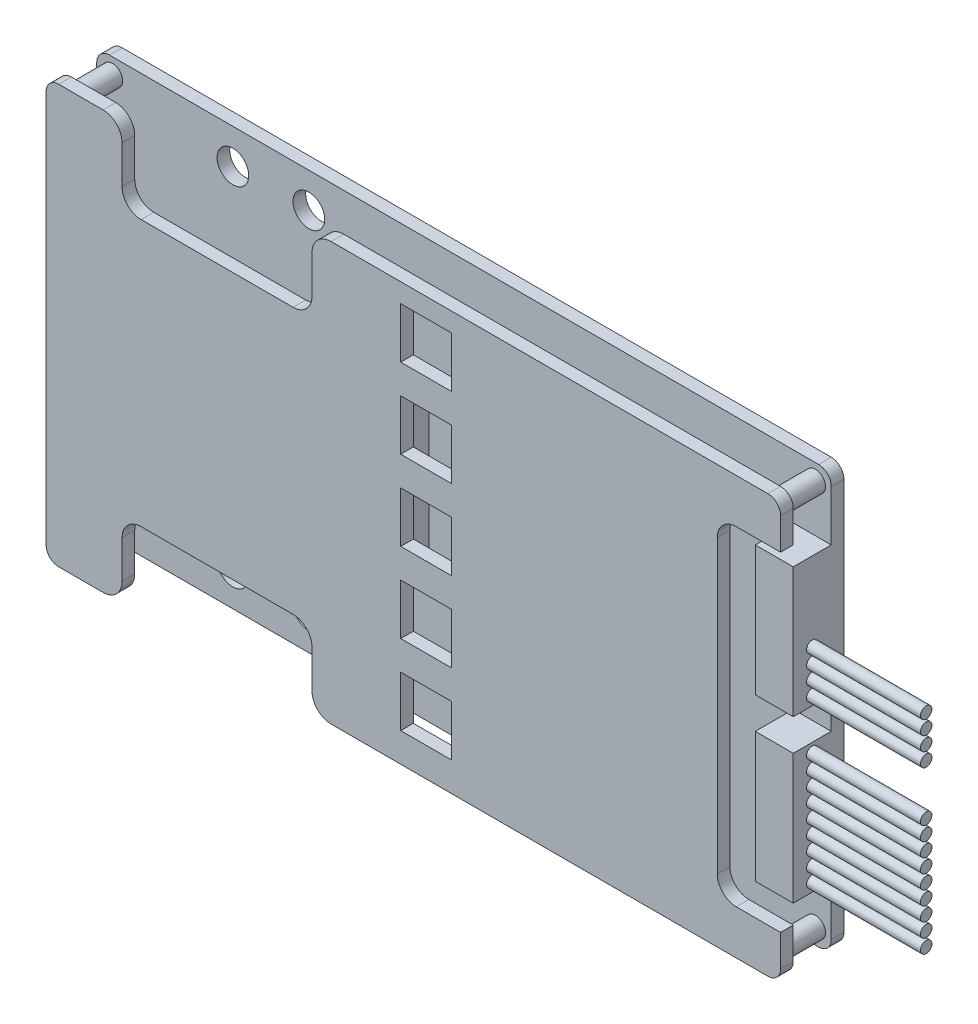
ISO-10303-21;
HEADER;
FILE_DESCRIPTION(('STEP AP214'),'2;1');
FILE_NAME('part.step','',(''),(''),'','','');
FILE_SCHEMA(('AUTOMOTIVE_DESIGN { 1 0 10303 214 1 1 1 1 }'));
ENDSEC;
DATA;
#1=APPLICATION_CONTEXT('core data for automotive mechanical design processes');
#2=APPLICATION_PROTOCOL_DEFINITION('international standard','automotive_design',2000,#1);
#3=PRODUCT_CONTEXT('',#1,'mechanical');
#4=PRODUCT('Part','Part','',(#3));
#5=PRODUCT_RELATED_PRODUCT_CATEGORY('part','',(#4));
#6=PRODUCT_DEFINITION_FORMATION('','',#4);
#7=PRODUCT_DEFINITION_CONTEXT('part definition',#1,'design');
#8=PRODUCT_DEFINITION('design','',#6,#7);
#9=PRODUCT_DEFINITION_SHAPE('','',#8);
#10=(LENGTH_UNIT() NAMED_UNIT(*) SI_UNIT(.MILLI.,.METRE.));
#11=(NAMED_UNIT(*) PLANE_ANGLE_UNIT() SI_UNIT($,.RADIAN.));
#12=(NAMED_UNIT(*) SI_UNIT($,.STERADIAN.) SOLID_ANGLE_UNIT());
#13=UNCERTAINTY_MEASURE_WITH_UNIT(LENGTH_MEASURE(1.E-05),#10,'distance_accuracy_value','');
#14=(GEOMETRIC_REPRESENTATION_CONTEXT(3) GLOBAL_UNCERTAINTY_ASSIGNED_CONTEXT((#13)) GLOBAL_UNIT_ASSIGNED_CONTEXT((#10,
#11,#12)) REPRESENTATION_CONTEXT('',''));
#15=CARTESIAN_POINT('',(0.,0.,0.));
#16=DIRECTION('',(0.,0.,1.));
#17=DIRECTION('',(1.,0.,0.));
#18=AXIS2_PLACEMENT_3D('',#15,#16,#17);
#19=CARTESIAN_POINT('',(76.,-3.89999999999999,4.99999999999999));
#20=DIRECTION('',(1.,0.,0.));
#21=DIRECTION('',(0.,1.,0.));
#22=AXIS2_PLACEMENT_3D('',#19,#20,#21);
#23=PLANE('',#22);
#24=CARTESIAN_POINT('',(76.,-3.89999999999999,4.99999999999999));
#25=DIRECTION('',(1.,0.,0.));
#26=DIRECTION('',(0.,1.,0.));
#27=AXIS2_PLACEMENT_3D('',#24,#25,#26);
#28=CIRCLE('',#27,0.9);
#29=CARTESIAN_POINT('',(76.,-2.99999999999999,4.99999999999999));
#30=VERTEX_POINT('',#29);
#31=EDGE_CURVE('E12',#30,#30,#28,.T.);
#32=ORIENTED_EDGE('',*,*,#31,.T.);
#33=EDGE_LOOP('',(#32));
#34=FACE_BOUND('',#33,.T.);
#35=ADVANCED_FACE('F39',(#34),#23,.T.);
#36=CARTESIAN_POINT('',(76.,-3.89999999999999,4.99999999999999));
#37=DIRECTION('',(-1.,0.,0.));
#38=DIRECTION('',(0.,-1.,0.));
#39=AXIS2_PLACEMENT_3D('',#36,#37,#38);
#40=CYLINDRICAL_SURFACE('',#39,0.9);
#41=ORIENTED_EDGE('',*,*,#31,.F.);
#42=EDGE_LOOP('',(#41));
#43=FACE_BOUND('',#42,.T.);
#44=CARTESIAN_POINT('',(58.,-3.9,4.99999999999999));
#45=DIRECTION('',(-1.,0.,0.));
#46=DIRECTION('',(0.,-1.,0.));
#47=AXIS2_PLACEMENT_3D('',#44,#45,#46);
#48=CIRCLE('',#47,0.9);
#49=CARTESIAN_POINT('',(58.,-4.8,4.99999999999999));
#50=VERTEX_POINT('',#49);
#51=EDGE_CURVE('E46',#50,#50,#48,.F.);
#52=ORIENTED_EDGE('',*,*,#51,.T.);
#53=EDGE_LOOP('',(#52));
#54=FACE_BOUND('',#53,.T.);
#55=ADVANCED_FACE('F994',(#43,#54),#40,.T.);
#56=CARTESIAN_POINT('',(76.,-6.09999999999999,4.99999999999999));
#57=DIRECTION('',(1.,0.,0.));
#58=DIRECTION('',(0.,1.,0.));
#59=AXIS2_PLACEMENT_3D('',#56,#57,#58);
#60=PLANE('',#59);
#61=CARTESIAN_POINT('',(76.,-6.09999999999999,4.99999999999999));
#62=DIRECTION('',(1.,0.,0.));
#63=DIRECTION('',(0.,1.,0.));
#64=AXIS2_PLACEMENT_3D('',#61,#62,#63);
#65=CIRCLE('',#64,0.9);
#66=CARTESIAN_POINT('',(76.,-5.19999999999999,4.99999999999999));
#67=VERTEX_POINT('',#66);
#68=EDGE_CURVE('E989',#67,#67,#65,.T.);
#69=ORIENTED_EDGE('',*,*,#68,.T.);
#70=EDGE_LOOP('',(#69));
#71=FACE_BOUND('',#70,.T.);
#72=ADVANCED_FACE('F1049',(#71),#60,.T.);
#73=CARTESIAN_POINT('',(76.,-6.09999999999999,4.99999999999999));
#74=DIRECTION('',(-1.,0.,0.));
#75=DIRECTION('',(0.,-1.,0.));
#76=AXIS2_PLACEMENT_3D('',#73,#74,#75);
#77=CYLINDRICAL_SURFACE('',#76,0.9);
#78=ORIENTED_EDGE('',*,*,#68,.F.);
#79=EDGE_LOOP('',(#78));
#80=FACE_BOUND('',#79,.T.);
#81=CARTESIAN_POINT('',(58.,-6.1,4.99999999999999));
#82=DIRECTION('',(-1.,0.,0.));
#83=DIRECTION('',(0.,-1.,0.));
#84=AXIS2_PLACEMENT_3D('',#81,#82,#83);
#85=CIRCLE('',#84,0.9);
#86=CARTESIAN_POINT('',(58.,-7.,4.99999999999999));
#87=VERTEX_POINT('',#86);
#88=EDGE_CURVE('E986',#87,#87,#85,.F.);
#89=ORIENTED_EDGE('',*,*,#88,.T.);
#90=EDGE_LOOP('',(#89));
#91=FACE_BOUND('',#90,.T.);
#92=ADVANCED_FACE('F1055',(#80,#91),#77,.T.);
#93=CARTESIAN_POINT('',(76.,-8.3,4.99999999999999));
#94=DIRECTION('',(1.,0.,0.));
#95=DIRECTION('',(0.,1.,0.));
#96=AXIS2_PLACEMENT_3D('',#93,#94,#95);
#97=PLANE('',#96);
#98=CARTESIAN_POINT('',(76.,-8.3,4.99999999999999));
#99=DIRECTION('',(1.,0.,0.));
#100=DIRECTION('',(0.,1.,0.));
#101=AXIS2_PLACEMENT_3D('',#98,#99,#100);
#102=CIRCLE('',#101,0.9);
#103=CARTESIAN_POINT('',(76.,-7.4,4.99999999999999));
#104=VERTEX_POINT('',#103);
#105=EDGE_CURVE('E983',#104,#104,#102,.T.);
#106=ORIENTED_EDGE('',*,*,#105,.T.);
#107=EDGE_LOOP('',(#106));
#108=FACE_BOUND('',#107,.T.);
#109=ADVANCED_FACE('F1061',(#108),#97,.T.);
#110=CARTESIAN_POINT('',(76.,-8.3,4.99999999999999));
#111=DIRECTION('',(-1.,0.,0.));
#112=DIRECTION('',(0.,-1.,0.));
#113=AXIS2_PLACEMENT_3D('',#110,#111,#112);
#114=CYLINDRICAL_SURFACE('',#113,0.9);
#115=ORIENTED_EDGE('',*,*,#105,.F.);
#116=EDGE_LOOP('',(#115));
#117=FACE_BOUND('',#116,.T.);
#118=CARTESIAN_POINT('',(58.,-8.3,4.99999999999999));
#119=DIRECTION('',(-1.,0.,0.));
#120=DIRECTION('',(0.,-1.,0.));
#121=AXIS2_PLACEMENT_3D('',#118,#119,#120);
#122=CIRCLE('',#121,0.9);
#123=CARTESIAN_POINT('',(58.,-9.2,4.99999999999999));
#124=VERTEX_POINT('',#123);
#125=EDGE_CURVE('E980',#124,#124,#122,.F.);
#126=ORIENTED_EDGE('',*,*,#125,.T.);
#127=EDGE_LOOP('',(#126));
#128=FACE_BOUND('',#127,.T.);
#129=ADVANCED_FACE('F1065',(#117,#128),#114,.T.);
#130=CARTESIAN_POINT('',(76.,-10.5,4.99999999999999));
#131=DIRECTION('',(1.,0.,0.));
#132=DIRECTION('',(0.,1.,0.));
#133=AXIS2_PLACEMENT_3D('',#130,#131,#132);
#134=PLANE('',#133);
#135=CARTESIAN_POINT('',(76.,-10.5,4.99999999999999));
#136=DIRECTION('',(1.,0.,0.));
#137=DIRECTION('',(0.,1.,0.));
#138=AXIS2_PLACEMENT_3D('',#135,#136,#137);
#139=CIRCLE('',#138,0.9);
#140=CARTESIAN_POINT('',(76.,-9.59999999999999,4.99999999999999));
#141=VERTEX_POINT('',#140);
#142=EDGE_CURVE('E977',#141,#141,#139,.T.);
#143=ORIENTED_EDGE('',*,*,#142,.T.);
#144=EDGE_LOOP('',(#143));
#145=FACE_BOUND('',#144,.T.);
#146=ADVANCED_FACE('F1069',(#145),#134,.T.);
#147=CARTESIAN_POINT('',(76.,-10.5,4.99999999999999));
#148=DIRECTION('',(-1.,0.,0.));
#149=DIRECTION('',(0.,-1.,0.));
#150=AXIS2_PLACEMENT_3D('',#147,#148,#149);
#151=CYLINDRICAL_SURFACE('',#150,0.9);
#152=ORIENTED_EDGE('',*,*,#142,.F.);
#153=EDGE_LOOP('',(#152));
#154=FACE_BOUND('',#153,.T.);
#155=CARTESIAN_POINT('',(58.,-10.5,4.99999999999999));
#156=DIRECTION('',(-1.,0.,0.));
#157=DIRECTION('',(0.,-1.,0.));
#158=AXIS2_PLACEMENT_3D('',#155,#156,#157);
#159=CIRCLE('',#158,0.9);
#160=CARTESIAN_POINT('',(58.,-11.4,4.99999999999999));
#161=VERTEX_POINT('',#160);
#162=EDGE_CURVE('E974',#161,#161,#159,.F.);
#163=ORIENTED_EDGE('',*,*,#162,.T.);
#164=EDGE_LOOP('',(#163));
#165=FACE_BOUND('',#164,.T.);
#166=ADVANCED_FACE('F1073',(#154,#165),#151,.T.);
#167=CARTESIAN_POINT('',(76.,-12.7,4.99999999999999));
#168=DIRECTION('',(1.,0.,0.));
#169=DIRECTION('',(0.,1.,0.));
#170=AXIS2_PLACEMENT_3D('',#167,#168,#169);
#171=PLANE('',#170);
#172=CARTESIAN_POINT('',(76.,-12.7,4.99999999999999));
#173=DIRECTION('',(1.,0.,0.));
#174=DIRECTION('',(0.,1.,0.));
#175=AXIS2_PLACEMENT_3D('',#172,#173,#174);
#176=CIRCLE('',#175,0.9);
#177=CARTESIAN_POINT('',(76.,-11.8,4.99999999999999));
#178=VERTEX_POINT('',#177);
#179=EDGE_CURVE('E971',#178,#178,#176,.T.);
#180=ORIENTED_EDGE('',*,*,#179,.T.);
#181=EDGE_LOOP('',(#180));
#182=FACE_BOUND('',#181,.T.);
#183=ADVANCED_FACE('F1077',(#182),#171,.T.);
#184=CARTESIAN_POINT('',(76.,-12.7,4.99999999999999));
#185=DIRECTION('',(-1.,0.,0.));
#186=DIRECTION('',(0.,-1.,0.));
#187=AXIS2_PLACEMENT_3D('',#184,#185,#186);
#188=CYLINDRICAL_SURFACE('',#187,0.9);
#189=ORIENTED_EDGE('',*,*,#179,.F.);
#190=EDGE_LOOP('',(#189));
#191=FACE_BOUND('',#190,.T.);
#192=CARTESIAN_POINT('',(58.,-12.7,4.99999999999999));
#193=DIRECTION('',(-1.,0.,0.));
#194=DIRECTION('',(0.,-1.,0.));
#195=AXIS2_PLACEMENT_3D('',#192,#193,#194);
#196=CIRCLE('',#195,0.9);
#197=CARTESIAN_POINT('',(58.,-13.6,4.99999999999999));
#198=VERTEX_POINT('',#197);
#199=EDGE_CURVE('E968',#198,#198,#196,.F.);
#200=ORIENTED_EDGE('',*,*,#199,.T.);
#201=EDGE_LOOP('',(#200));
#202=FACE_BOUND('',#201,.T.);
#203=ADVANCED_FACE('F1081',(#191,#202),#188,.T.);
#204=CARTESIAN_POINT('',(76.,-14.9,4.99999999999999));
#205=DIRECTION('',(1.,0.,0.));
#206=DIRECTION('',(0.,1.,0.));
#207=AXIS2_PLACEMENT_3D('',#204,#205,#206);
#208=PLANE('',#207);
#209=CARTESIAN_POINT('',(76.,-14.9,4.99999999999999));
#210=DIRECTION('',(1.,0.,0.));
#211=DIRECTION('',(0.,1.,0.));
#212=AXIS2_PLACEMENT_3D('',#209,#210,#211);
#213=CIRCLE('',#212,0.9);
#214=CARTESIAN_POINT('',(76.,-14.,4.99999999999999));
#215=VERTEX_POINT('',#214);
#216=EDGE_CURVE('E965',#215,#215,#213,.T.);
#217=ORIENTED_EDGE('',*,*,#216,.T.);
#218=EDGE_LOOP('',(#217));
#219=FACE_BOUND('',#218,.T.);
#220=ADVANCED_FACE('F1085',(#219),#208,.T.);
#221=CARTESIAN_POINT('',(76.,-14.9,4.99999999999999));
#222=DIRECTION('',(-1.,0.,0.));
#223=DIRECTION('',(0.,-1.,0.));
#224=AXIS2_PLACEMENT_3D('',#221,#222,#223);
#225=CYLINDRICAL_SURFACE('',#224,0.9);
#226=ORIENTED_EDGE('',*,*,#216,.F.);
#227=EDGE_LOOP('',(#226));
#228=FACE_BOUND('',#227,.T.);
#229=CARTESIAN_POINT('',(58.,-14.9,4.99999999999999));
#230=DIRECTION('',(-1.,0.,0.));
#231=DIRECTION('',(0.,-1.,0.));
#232=AXIS2_PLACEMENT_3D('',#229,#230,#231);
#233=CIRCLE('',#232,0.9);
#234=CARTESIAN_POINT('',(58.,-15.8,4.99999999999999));
#235=VERTEX_POINT('',#234);
#236=EDGE_CURVE('E962',#235,#235,#233,.F.);
#237=ORIENTED_EDGE('',*,*,#236,.T.);
#238=EDGE_LOOP('',(#237));
#239=FACE_BOUND('',#238,.T.);
#240=ADVANCED_FACE('F1089',(#228,#239),#225,.T.);
#241=CARTESIAN_POINT('',(76.,-17.1,4.99999999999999));
#242=DIRECTION('',(1.,0.,0.));
#243=DIRECTION('',(0.,1.,0.));
#244=AXIS2_PLACEMENT_3D('',#241,#242,#243);
#245=PLANE('',#244);
#246=CARTESIAN_POINT('',(76.,-17.1,4.99999999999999));
#247=DIRECTION('',(1.,0.,0.));
#248=DIRECTION('',(0.,1.,0.));
#249=AXIS2_PLACEMENT_3D('',#246,#247,#248);
#250=CIRCLE('',#249,0.9);
#251=CARTESIAN_POINT('',(76.,-16.2,4.99999999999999));
#252=VERTEX_POINT('',#251);
#253=EDGE_CURVE('E959',#252,#252,#250,.T.);
#254=ORIENTED_EDGE('',*,*,#253,.T.);
#255=EDGE_LOOP('',(#254));
#256=FACE_BOUND('',#255,.T.);
#257=ADVANCED_FACE('F1093',(#256),#245,.T.);
#258=CARTESIAN_POINT('',(76.,-17.1,4.99999999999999));
#259=DIRECTION('',(-1.,0.,0.));
#260=DIRECTION('',(0.,-1.,0.));
#261=AXIS2_PLACEMENT_3D('',#258,#259,#260);
#262=CYLINDRICAL_SURFACE('',#261,0.9);
#263=ORIENTED_EDGE('',*,*,#253,.F.);
#264=EDGE_LOOP('',(#263));
#265=FACE_BOUND('',#264,.T.);
#266=CARTESIAN_POINT('',(58.,-17.1,4.99999999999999));
#267=DIRECTION('',(-1.,0.,0.));
#268=DIRECTION('',(0.,-1.,0.));
#269=AXIS2_PLACEMENT_3D('',#266,#267,#268);
#270=CIRCLE('',#269,0.9);
#271=CARTESIAN_POINT('',(58.,-18.,4.99999999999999));
#272=VERTEX_POINT('',#271);
#273=EDGE_CURVE('E956',#272,#272,#270,.F.);
#274=ORIENTED_EDGE('',*,*,#273,.T.);
#275=EDGE_LOOP('',(#274));
#276=FACE_BOUND('',#275,.T.);
#277=ADVANCED_FACE('F1097',(#265,#276),#262,.T.);
#278=CARTESIAN_POINT('',(76.,10.6,5.));
#279=DIRECTION('',(1.,0.,0.));
#280=DIRECTION('',(0.,1.,0.));
#281=AXIS2_PLACEMENT_3D('',#278,#279,#280);
#282=PLANE('',#281);
#283=CARTESIAN_POINT('',(76.,10.6,5.));
#284=DIRECTION('',(1.,0.,0.));
#285=DIRECTION('',(0.,1.,0.));
#286=AXIS2_PLACEMENT_3D('',#283,#284,#285);
#287=CIRCLE('',#286,0.899999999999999);
#288=CARTESIAN_POINT('',(76.,11.5,5.));
#289=VERTEX_POINT('',#288);
#290=EDGE_CURVE('E950',#289,#289,#287,.T.);
#291=ORIENTED_EDGE('',*,*,#290,.T.);
#292=EDGE_LOOP('',(#291));
#293=FACE_BOUND('',#292,.T.);
#294=ADVANCED_FACE('F1101',(#293),#282,.T.);
#295=CARTESIAN_POINT('',(76.,10.6,5.));
#296=DIRECTION('',(-1.,0.,0.));
#297=DIRECTION('',(0.,-1.,0.));
#298=AXIS2_PLACEMENT_3D('',#295,#296,#297);
#299=CYLINDRICAL_SURFACE('',#298,0.899999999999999);
#300=ORIENTED_EDGE('',*,*,#290,.F.);
#301=EDGE_LOOP('',(#300));
#302=FACE_BOUND('',#301,.T.);
#303=CARTESIAN_POINT('',(58.,10.6,5.));
#304=DIRECTION('',(-1.,0.,0.));
#305=DIRECTION('',(0.,-1.,0.));
#306=AXIS2_PLACEMENT_3D('',#303,#304,#305);
#307=CIRCLE('',#306,0.899999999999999);
#308=CARTESIAN_POINT('',(58.,9.7,5.));
#309=VERTEX_POINT('',#308);
#310=EDGE_CURVE('E947',#309,#309,#307,.F.);
#311=ORIENTED_EDGE('',*,*,#310,.T.);
#312=EDGE_LOOP('',(#311));
#313=FACE_BOUND('',#312,.T.);
#314=ADVANCED_FACE('F1105',(#302,#313),#299,.T.);
#315=CARTESIAN_POINT('',(76.,8.40000000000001,5.));
#316=DIRECTION('',(1.,0.,0.));
#317=DIRECTION('',(0.,1.,0.));
#318=AXIS2_PLACEMENT_3D('',#315,#316,#317);
#319=PLANE('',#318);
#320=CARTESIAN_POINT('',(76.,8.40000000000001,5.));
#321=DIRECTION('',(1.,0.,0.));
#322=DIRECTION('',(0.,1.,0.));
#323=AXIS2_PLACEMENT_3D('',#320,#321,#322);
#324=CIRCLE('',#323,0.899999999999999);
#325=CARTESIAN_POINT('',(76.,9.30000000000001,5.));
#326=VERTEX_POINT('',#325);
#327=EDGE_CURVE('E944',#326,#326,#324,.T.);
#328=ORIENTED_EDGE('',*,*,#327,.T.);
#329=EDGE_LOOP('',(#328));
#330=FACE_BOUND('',#329,.T.);
#331=ADVANCED_FACE('F1109',(#330),#319,.T.);
#332=CARTESIAN_POINT('',(76.,8.40000000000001,5.));
#333=DIRECTION('',(-1.,0.,0.));
#334=DIRECTION('',(0.,-1.,0.));
#335=AXIS2_PLACEMENT_3D('',#332,#333,#334);
#336=CYLINDRICAL_SURFACE('',#335,0.899999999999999);
#337=ORIENTED_EDGE('',*,*,#327,.F.);
#338=EDGE_LOOP('',(#337));
#339=FACE_BOUND('',#338,.T.);
#340=CARTESIAN_POINT('',(58.,8.40000000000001,5.));
#341=DIRECTION('',(-1.,0.,0.));
#342=DIRECTION('',(0.,-1.,0.));
#343=AXIS2_PLACEMENT_3D('',#340,#341,#342);
#344=CIRCLE('',#343,0.899999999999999);
#345=CARTESIAN_POINT('',(58.,7.50000000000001,5.));
#346=VERTEX_POINT('',#345);
#347=EDGE_CURVE('E941',#346,#346,#344,.F.);
#348=ORIENTED_EDGE('',*,*,#347,.T.);
#349=EDGE_LOOP('',(#348));
#350=FACE_BOUND('',#349,.T.);
#351=ADVANCED_FACE('F1113',(#339,#350),#336,.T.);
#352=CARTESIAN_POINT('',(0.,0.,2.));
#353=DIRECTION('',(0.,0.,1.));
#354=DIRECTION('',(1.,0.,0.));
#355=AXIS2_PLACEMENT_3D('',#352,#353,#354);
#356=PLANE('',#355);
#357=CARTESIAN_POINT('',(-24.5,27.5,2.));
#358=DIRECTION('',(0.,0.,1.));
#359=DIRECTION('',(1.,0.,0.));
#360=AXIS2_PLACEMENT_3D('',#357,#358,#359);
#361=CIRCLE('',#360,2.5);
#362=CARTESIAN_POINT('',(-22.,27.5,2.));
#363=VERTEX_POINT('',#362);
#364=EDGE_CURVE('E1478',#363,#363,#361,.T.);
#365=ORIENTED_EDGE('',*,*,#364,.F.);
#366=EDGE_LOOP('',(#365));
#367=FACE_BOUND('',#366,.T.);
#368=CARTESIAN_POINT('',(-36.5,-27.5,2.));
#369=DIRECTION('',(0.,0.,1.));
#370=DIRECTION('',(1.,0.,0.));
#371=AXIS2_PLACEMENT_3D('',#368,#369,#370);
#372=CIRCLE('',#371,2.5);
#373=CARTESIAN_POINT('',(-34.,-27.5,2.));
#374=VERTEX_POINT('',#373);
#375=EDGE_CURVE('E1471',#374,#374,#372,.T.);
#376=ORIENTED_EDGE('',*,*,#375,.F.);
#377=EDGE_LOOP('',(#376));
#378=FACE_BOUND('',#377,.T.);
#379=CARTESIAN_POINT('',(-24.5,-27.5,2.));
#380=DIRECTION('',(0.,0.,1.));
#381=DIRECTION('',(1.,0.,0.));
#382=AXIS2_PLACEMENT_3D('',#379,#380,#381);
#383=CIRCLE('',#382,2.5);
#384=CARTESIAN_POINT('',(-22.,-27.5,2.));
#385=VERTEX_POINT('',#384);
#386=EDGE_CURVE('E1467',#385,#385,#383,.T.);
#387=ORIENTED_EDGE('',*,*,#386,.F.);
#388=EDGE_LOOP('',(#387));
#389=FACE_BOUND('',#388,.T.);
#390=CARTESIAN_POINT('',(-36.5,27.5,2.));
#391=DIRECTION('',(0.,0.,1.));
#392=DIRECTION('',(1.,0.,0.));
#393=AXIS2_PLACEMENT_3D('',#390,#391,#392);
#394=CIRCLE('',#393,2.5);
#395=CARTESIAN_POINT('',(-34.,27.5,2.));
#396=VERTEX_POINT('',#395);
#397=EDGE_CURVE('E1477',#396,#396,#394,.T.);
#398=ORIENTED_EDGE('',*,*,#397,.F.);
#399=EDGE_LOOP('',(#398));
#400=FACE_BOUND('',#399,.T.);
#401=CARTESIAN_POINT('',(-55.5,-30.5,2.));
#402=DIRECTION('',(0.,0.,1.));
#403=DIRECTION('',(1.,0.,0.));
#404=AXIS2_PLACEMENT_3D('',#401,#402,#403);
#405=CIRCLE('',#404,1.6);
#406=CARTESIAN_POINT('',(-53.9,-30.5,2.));
#407=VERTEX_POINT('',#406);
#408=EDGE_CURVE('E758',#407,#407,#405,.T.);
#409=ORIENTED_EDGE('',*,*,#408,.F.);
#410=EDGE_LOOP('',(#409));
#411=FACE_BOUND('',#410,.T.);
#412=CARTESIAN_POINT('',(55.5,-30.5,2.));
#413=DIRECTION('',(0.,0.,1.));
#414=DIRECTION('',(1.,0.,0.));
#415=AXIS2_PLACEMENT_3D('',#412,#413,#414);
#416=CIRCLE('',#415,1.6);
#417=CARTESIAN_POINT('',(57.1,-30.5,2.));
#418=VERTEX_POINT('',#417);
#419=EDGE_CURVE('E762',#418,#418,#416,.T.);
#420=ORIENTED_EDGE('',*,*,#419,.F.);
#421=EDGE_LOOP('',(#420));
#422=FACE_BOUND('',#421,.T.);
#423=CARTESIAN_POINT('',(55.5,30.5,2.));
#424=DIRECTION('',(0.,0.,1.));
#425=DIRECTION('',(1.,0.,0.));
#426=AXIS2_PLACEMENT_3D('',#423,#424,#425);
#427=CIRCLE('',#426,1.6);
#428=CARTESIAN_POINT('',(57.1,30.5,2.));
#429=VERTEX_POINT('',#428);
#430=EDGE_CURVE('E768',#429,#429,#427,.T.);
#431=ORIENTED_EDGE('',*,*,#430,.F.);
#432=EDGE_LOOP('',(#431));
#433=FACE_BOUND('',#432,.T.);
#434=CARTESIAN_POINT('',(-55.5,30.5,2.));
#435=DIRECTION('',(0.,0.,1.));
#436=DIRECTION('',(1.,0.,0.));
#437=AXIS2_PLACEMENT_3D('',#434,#435,#436);
#438=CIRCLE('',#437,1.6);
#439=CARTESIAN_POINT('',(-53.9,30.5,2.));
#440=VERTEX_POINT('',#439);
#441=EDGE_CURVE('E774',#440,#440,#438,.T.);
#442=ORIENTED_EDGE('',*,*,#441,.F.);
#443=EDGE_LOOP('',(#442));
#444=FACE_BOUND('',#443,.T.);
#445=DIRECTION('',(0.,1.,0.));
#446=VECTOR('',#445,1.);
#447=CARTESIAN_POINT('',(58.,33.,2.));
#448=LINE('',#447,#446);
#449=CARTESIAN_POINT('',(58.,-31.,2.));
#450=VERTEX_POINT('',#449);
#451=CARTESIAN_POINT('',(58.,-23.,2.));
#452=VERTEX_POINT('',#451);
#453=EDGE_CURVE('E791',#450,#452,#448,.T.);
#454=ORIENTED_EDGE('',*,*,#453,.T.);
#455=DIRECTION('',(1.,0.,0.));
#456=VECTOR('',#455,1.);
#457=CARTESIAN_POINT('',(52.,-23.,2.));
#458=LINE('',#457,#456);
#459=CARTESIAN_POINT('',(52.,-23.,2.));
#460=VERTEX_POINT('',#459);
#461=EDGE_CURVE('E715',#460,#452,#458,.T.);
#462=ORIENTED_EDGE('',*,*,#461,.F.);
#463=DIRECTION('',(0.,-1.,0.));
#464=VECTOR('',#463,1.);
#465=CARTESIAN_POINT('',(52.,-2.49999999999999,2.));
#466=LINE('',#465,#464);
#467=CARTESIAN_POINT('',(52.,-2.49999999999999,2.));
#468=VERTEX_POINT('',#467);
#469=EDGE_CURVE('E701',#468,#460,#466,.T.);
#470=ORIENTED_EDGE('',*,*,#469,.F.);
#471=DIRECTION('',(-1.,0.,0.));
#472=VECTOR('',#471,1.);
#473=CARTESIAN_POINT('',(52.,-2.49999999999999,2.));
#474=LINE('',#473,#472);
#475=CARTESIAN_POINT('',(58.,-2.49999999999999,2.));
#476=VERTEX_POINT('',#475);
#477=EDGE_CURVE('E706',#476,#468,#474,.T.);
#478=ORIENTED_EDGE('',*,*,#477,.F.);
#479=CARTESIAN_POINT('',(58.,2.50000000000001,2.));
#480=VERTEX_POINT('',#479);
#481=EDGE_CURVE('E794',#476,#480,#448,.T.);
#482=ORIENTED_EDGE('',*,*,#481,.T.);
#483=DIRECTION('',(1.,0.,0.));
#484=VECTOR('',#483,1.);
#485=CARTESIAN_POINT('',(52.,2.50000000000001,2.));
#486=LINE('',#485,#484);
#487=CARTESIAN_POINT('',(52.,2.50000000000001,2.));
#488=VERTEX_POINT('',#487);
#489=EDGE_CURVE('E745',#488,#480,#486,.T.);
#490=ORIENTED_EDGE('',*,*,#489,.F.);
#491=DIRECTION('',(0.,-1.,0.));
#492=VECTOR('',#491,1.);
#493=CARTESIAN_POINT('',(52.,23.,2.));
#494=LINE('',#493,#492);
#495=CARTESIAN_POINT('',(52.,23.,2.));
#496=VERTEX_POINT('',#495);
#497=EDGE_CURVE('E731',#496,#488,#494,.T.);
#498=ORIENTED_EDGE('',*,*,#497,.F.);
#499=DIRECTION('',(-1.,0.,0.));
#500=VECTOR('',#499,1.);
#501=CARTESIAN_POINT('',(52.,23.,2.));
#502=LINE('',#501,#500);
#503=CARTESIAN_POINT('',(58.,23.,2.));
#504=VERTEX_POINT('',#503);
#505=EDGE_CURVE('E736',#504,#496,#502,.T.);
#506=ORIENTED_EDGE('',*,*,#505,.F.);
#507=CARTESIAN_POINT('',(58.,31.,2.));
#508=VERTEX_POINT('',#507);
#509=EDGE_CURVE('E790',#504,#508,#448,.T.);
#510=ORIENTED_EDGE('',*,*,#509,.T.);
#511=CARTESIAN_POINT('',(56.,31.,2.));
#512=DIRECTION('',(0.,0.,1.));
#513=DIRECTION('',(1.,0.,0.));
#514=AXIS2_PLACEMENT_3D('',#511,#512,#513);
#515=CIRCLE('',#514,2.);
#516=CARTESIAN_POINT('',(56.,33.,2.));
#517=VERTEX_POINT('',#516);
#518=EDGE_CURVE('E827',#508,#517,#515,.T.);
#519=ORIENTED_EDGE('',*,*,#518,.T.);
#520=DIRECTION('',(-1.,0.,0.));
#521=VECTOR('',#520,1.);
#522=CARTESIAN_POINT('',(-58.,33.,2.));
#523=LINE('',#522,#521);
#524=CARTESIAN_POINT('',(-56.,33.,2.));
#525=VERTEX_POINT('',#524);
#526=EDGE_CURVE('E793',#517,#525,#523,.T.);
#527=ORIENTED_EDGE('',*,*,#526,.T.);
#528=CARTESIAN_POINT('',(-56.,31.,2.));
#529=DIRECTION('',(0.,0.,1.));
#530=DIRECTION('',(1.,0.,0.));
#531=AXIS2_PLACEMENT_3D('',#528,#529,#530);
#532=CIRCLE('',#531,2.);
#533=CARTESIAN_POINT('',(-58.,31.,2.));
#534=VERTEX_POINT('',#533);
#535=EDGE_CURVE('E825',#525,#534,#532,.T.);
#536=ORIENTED_EDGE('',*,*,#535,.T.);
#537=DIRECTION('',(0.,-1.,0.));
#538=VECTOR('',#537,1.);
#539=CARTESIAN_POINT('',(-58.,33.,2.));
#540=LINE('',#539,#538);
#541=CARTESIAN_POINT('',(-58.,-31.,2.));
#542=VERTEX_POINT('',#541);
#543=EDGE_CURVE('E783',#534,#542,#540,.T.);
#544=ORIENTED_EDGE('',*,*,#543,.T.);
#545=CARTESIAN_POINT('',(-56.,-31.,2.));
#546=DIRECTION('',(0.,0.,1.));
#547=DIRECTION('',(1.,0.,0.));
#548=AXIS2_PLACEMENT_3D('',#545,#546,#547);
#549=CIRCLE('',#548,2.);
#550=CARTESIAN_POINT('',(-56.,-33.,2.));
#551=VERTEX_POINT('',#550);
#552=EDGE_CURVE('E831',#542,#551,#549,.T.);
#553=ORIENTED_EDGE('',*,*,#552,.T.);
#554=DIRECTION('',(1.,0.,0.));
#555=VECTOR('',#554,1.);
#556=CARTESIAN_POINT('',(-58.,-33.,2.));
#557=LINE('',#556,#555);
#558=CARTESIAN_POINT('',(56.,-33.,2.));
#559=VERTEX_POINT('',#558);
#560=EDGE_CURVE('E786',#551,#559,#557,.T.);
#561=ORIENTED_EDGE('',*,*,#560,.T.);
#562=CARTESIAN_POINT('',(56.,-31.,2.));
#563=DIRECTION('',(0.,0.,1.));
#564=DIRECTION('',(1.,0.,0.));
#565=AXIS2_PLACEMENT_3D('',#562,#563,#564);
#566=CIRCLE('',#565,2.);
#567=EDGE_CURVE('E829',#559,#450,#566,.T.);
#568=ORIENTED_EDGE('',*,*,#567,.T.);
#569=EDGE_LOOP('',(#454,#462,#470,#478,#482,#490,#498,#506,#510,#519,#527,#536,#544,#553,#561,#568));
#570=FACE_BOUND('',#569,.T.);
#571=DIRECTION('',(1.,0.,0.));
#572=VECTOR('',#571,1.);
#573=CARTESIAN_POINT('',(-55.5,-11.5,2.));
#574=LINE('',#573,#572);
#575=CARTESIAN_POINT('',(-55.5,-11.5,2.));
#576=VERTEX_POINT('',#575);
#577=CARTESIAN_POINT('',(-5.50000000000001,-11.5,2.));
#578=VERTEX_POINT('',#577);
#579=EDGE_CURVE('E686',#576,#578,#574,.T.);
#580=ORIENTED_EDGE('',*,*,#579,.F.);
#581=DIRECTION('',(0.,-1.,0.));
#582=VECTOR('',#581,1.);
#583=CARTESIAN_POINT('',(-55.5,11.5,2.));
#584=LINE('',#583,#582);
#585=CARTESIAN_POINT('',(-55.5,11.5,2.));
#586=VERTEX_POINT('',#585);
#587=EDGE_CURVE('E487',#586,#576,#584,.T.);
#588=ORIENTED_EDGE('',*,*,#587,.F.);
#589=DIRECTION('',(-1.,0.,0.));
#590=VECTOR('',#589,1.);
#591=CARTESIAN_POINT('',(-55.5,11.5,2.));
#592=LINE('',#591,#590);
#593=CARTESIAN_POINT('',(-5.50000000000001,11.5,2.));
#594=VERTEX_POINT('',#593);
#595=EDGE_CURVE('E674',#594,#586,#592,.T.);
#596=ORIENTED_EDGE('',*,*,#595,.F.);
#597=DIRECTION('',(0.,1.,0.));
#598=VECTOR('',#597,1.);
#599=CARTESIAN_POINT('',(-5.50000000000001,11.5,2.));
#600=LINE('',#599,#598);
#601=EDGE_CURVE('E688',#578,#594,#600,.T.);
#602=ORIENTED_EDGE('',*,*,#601,.F.);
#603=EDGE_LOOP('',(#580,#588,#596,#602));
#604=FACE_BOUND('',#603,.T.);
#605=ADVANCED_FACE('F1117',(#367,#378,#389,#400,#411,#422,#433,#444,#570,#604),#356,.T.);
#606=CARTESIAN_POINT('',(-58.,33.,2.));
#607=DIRECTION('',(1.,0.,0.));
#608=DIRECTION('',(0.,1.,0.));
#609=AXIS2_PLACEMENT_3D('',#606,#607,#608);
#610=PLANE('',#609);
#611=DIRECTION('',(0.,-1.,0.));
#612=VECTOR('',#611,1.);
#613=CARTESIAN_POINT('',(-58.,33.,0.));
#614=LINE('',#613,#612);
#615=CARTESIAN_POINT('',(-58.,31.,0.));
#616=VERTEX_POINT('',#615);
#617=CARTESIAN_POINT('',(-58.,-31.,0.));
#618=VERTEX_POINT('',#617);
#619=EDGE_CURVE('E780',#616,#618,#614,.T.);
#620=ORIENTED_EDGE('',*,*,#619,.T.);
#621=DIRECTION('',(0.,0.,-1.));
#622=VECTOR('',#621,1.);
#623=CARTESIAN_POINT('',(-58.,-31.,2.));
#624=LINE('',#623,#622);
#625=EDGE_CURVE('E823',#618,#542,#624,.F.);
#626=ORIENTED_EDGE('',*,*,#625,.T.);
#627=ORIENTED_EDGE('',*,*,#543,.F.);
#628=DIRECTION('',(0.,0.,-1.));
#629=VECTOR('',#628,1.);
#630=CARTESIAN_POINT('',(-58.,31.,2.));
#631=LINE('',#630,#629);
#632=EDGE_CURVE('E820',#534,#616,#631,.T.);
#633=ORIENTED_EDGE('',*,*,#632,.T.);
#634=EDGE_LOOP('',(#620,#626,#627,#633));
#635=FACE_BOUND('',#634,.T.);
#636=ADVANCED_FACE('F1178',(#635),#610,.F.);
#637=CARTESIAN_POINT('',(-58.,-33.,2.));
#638=DIRECTION('',(0.,1.,0.));
#639=DIRECTION('',(0.,0.,1.));
#640=AXIS2_PLACEMENT_3D('',#637,#638,#639);
#641=PLANE('',#640);
#642=ORIENTED_EDGE('',*,*,#560,.F.);
#643=DIRECTION('',(0.,0.,-1.));
#644=VECTOR('',#643,1.);
#645=CARTESIAN_POINT('',(-56.,-33.,2.));
#646=LINE('',#645,#644);
#647=CARTESIAN_POINT('',(-56.,-33.,0.));
#648=VERTEX_POINT('',#647);
#649=EDGE_CURVE('E808',#551,#648,#646,.T.);
#650=ORIENTED_EDGE('',*,*,#649,.T.);
#651=DIRECTION('',(1.,0.,0.));
#652=VECTOR('',#651,1.);
#653=CARTESIAN_POINT('',(-58.,-33.,0.));
#654=LINE('',#653,#652);
#655=CARTESIAN_POINT('',(56.,-33.,0.));
#656=VERTEX_POINT('',#655);
#657=EDGE_CURVE('E800',#648,#656,#654,.T.);
#658=ORIENTED_EDGE('',*,*,#657,.T.);
#659=DIRECTION('',(0.,0.,-1.));
#660=VECTOR('',#659,1.);
#661=CARTESIAN_POINT('',(56.,-33.,2.));
#662=LINE('',#661,#660);
#663=EDGE_CURVE('E797',#656,#559,#662,.F.);
#664=ORIENTED_EDGE('',*,*,#663,.T.);
#665=EDGE_LOOP('',(#642,#650,#658,#664));
#666=FACE_BOUND('',#665,.T.);
#667=ADVANCED_FACE('F1000',(#666),#641,.F.);
#668=CARTESIAN_POINT('',(58.,33.,2.));
#669=DIRECTION('',(-1.,0.,0.));
#670=DIRECTION('',(0.,-1.,0.));
#671=AXIS2_PLACEMENT_3D('',#668,#669,#670);
#672=PLANE('',#671);
#673=DIRECTION('',(0.,0.,-1.));
#674=VECTOR('',#673,1.);
#675=CARTESIAN_POINT('',(58.,23.,8.));
#676=LINE('',#675,#674);
#677=CARTESIAN_POINT('',(58.,23.,8.));
#678=VERTEX_POINT('',#677);
#679=EDGE_CURVE('E751',#678,#504,#676,.T.);
#680=ORIENTED_EDGE('',*,*,#679,.F.);
#681=DIRECTION('',(0.,1.,0.));
#682=VECTOR('',#681,1.);
#683=CARTESIAN_POINT('',(58.,23.,8.));
#684=LINE('',#683,#682);
#685=CARTESIAN_POINT('',(58.,2.50000000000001,8.));
#686=VERTEX_POINT('',#685);
#687=EDGE_CURVE('E738',#686,#678,#684,.T.);
#688=ORIENTED_EDGE('',*,*,#687,.F.);
#689=DIRECTION('',(0.,0.,-1.));
#690=VECTOR('',#689,1.);
#691=CARTESIAN_POINT('',(58.,2.50000000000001,8.));
#692=LINE('',#691,#690);
#693=EDGE_CURVE('E753',#686,#480,#692,.T.);
#694=ORIENTED_EDGE('',*,*,#693,.T.);
#695=ORIENTED_EDGE('',*,*,#481,.F.);
#696=DIRECTION('',(0.,0.,-1.));
#697=VECTOR('',#696,1.);
#698=CARTESIAN_POINT('',(58.,-2.49999999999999,8.));
#699=LINE('',#698,#697);
#700=CARTESIAN_POINT('',(58.,-2.49999999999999,8.));
#701=VERTEX_POINT('',#700);
#702=EDGE_CURVE('E722',#701,#476,#699,.T.);
#703=ORIENTED_EDGE('',*,*,#702,.F.);
#704=DIRECTION('',(0.,1.,0.));
#705=VECTOR('',#704,1.);
#706=CARTESIAN_POINT('',(58.,-2.49999999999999,8.));
#707=LINE('',#706,#705);
#708=CARTESIAN_POINT('',(58.,-23.,8.));
#709=VERTEX_POINT('',#708);
#710=EDGE_CURVE('E708',#709,#701,#707,.T.);
#711=ORIENTED_EDGE('',*,*,#710,.F.);
#712=DIRECTION('',(0.,0.,-1.));
#713=VECTOR('',#712,1.);
#714=CARTESIAN_POINT('',(58.,-23.,8.));
#715=LINE('',#714,#713);
#716=EDGE_CURVE('E725',#709,#452,#715,.T.);
#717=ORIENTED_EDGE('',*,*,#716,.T.);
#718=ORIENTED_EDGE('',*,*,#453,.F.);
#719=DIRECTION('',(0.,0.,-1.));
#720=VECTOR('',#719,1.);
#721=CARTESIAN_POINT('',(58.,-31.,2.));
#722=LINE('',#721,#720);
#723=CARTESIAN_POINT('',(58.,-31.,0.));
#724=VERTEX_POINT('',#723);
#725=EDGE_CURVE('E836',#450,#724,#722,.T.);
#726=ORIENTED_EDGE('',*,*,#725,.T.);
#727=DIRECTION('',(0.,1.,0.));
#728=VECTOR('',#727,1.);
#729=CARTESIAN_POINT('',(58.,33.,0.));
#730=LINE('',#729,#728);
#731=CARTESIAN_POINT('',(58.,31.,0.));
#732=VERTEX_POINT('',#731);
#733=EDGE_CURVE('E803',#724,#732,#730,.T.);
#734=ORIENTED_EDGE('',*,*,#733,.T.);
#735=DIRECTION('',(0.,0.,-1.));
#736=VECTOR('',#735,1.);
#737=CARTESIAN_POINT('',(58.,31.,2.));
#738=LINE('',#737,#736);
#739=EDGE_CURVE('E833',#732,#508,#738,.F.);
#740=ORIENTED_EDGE('',*,*,#739,.T.);
#741=ORIENTED_EDGE('',*,*,#509,.F.);
#742=EDGE_LOOP('',(#680,#688,#694,#695,#703,#711,#717,#718,#726,#734,#740,#741));
#743=FACE_BOUND('',#742,.T.);
#744=ORIENTED_EDGE('',*,*,#51,.F.);
#745=EDGE_LOOP('',(#744));
#746=FACE_BOUND('',#745,.T.);
#747=ORIENTED_EDGE('',*,*,#88,.F.);
#748=EDGE_LOOP('',(#747));
#749=FACE_BOUND('',#748,.T.);
#750=ORIENTED_EDGE('',*,*,#125,.F.);
#751=EDGE_LOOP('',(#750));
#752=FACE_BOUND('',#751,.T.);
#753=ORIENTED_EDGE('',*,*,#162,.F.);
#754=EDGE_LOOP('',(#753));
#755=FACE_BOUND('',#754,.T.);
#756=ORIENTED_EDGE('',*,*,#199,.F.);
#757=EDGE_LOOP('',(#756));
#758=FACE_BOUND('',#757,.T.);
#759=ORIENTED_EDGE('',*,*,#236,.F.);
#760=EDGE_LOOP('',(#759));
#761=FACE_BOUND('',#760,.T.);
#762=ORIENTED_EDGE('',*,*,#273,.F.);
#763=EDGE_LOOP('',(#762));
#764=FACE_BOUND('',#763,.T.);
#765=ORIENTED_EDGE('',*,*,#310,.F.);
#766=EDGE_LOOP('',(#765));
#767=FACE_BOUND('',#766,.T.);
#768=ORIENTED_EDGE('',*,*,#347,.F.);
#769=EDGE_LOOP('',(#768));
#770=FACE_BOUND('',#769,.T.);
#771=CARTESIAN_POINT('',(58.,-21.5,4.99999999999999));
#772=DIRECTION('',(-1.,0.,0.));
#773=DIRECTION('',(0.,-1.,0.));
#774=AXIS2_PLACEMENT_3D('',#771,#772,#773);
#775=CIRCLE('',#774,0.9);
#776=CARTESIAN_POINT('',(58.,-22.4,4.99999999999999));
#777=VERTEX_POINT('',#776);
#778=EDGE_CURVE('E932',#777,#777,#775,.F.);
#779=ORIENTED_EDGE('',*,*,#778,.F.);
#780=EDGE_LOOP('',(#779));
#781=FACE_BOUND('',#780,.T.);
#782=CARTESIAN_POINT('',(58.,4.00000000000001,5.));
#783=DIRECTION('',(-1.,0.,0.));
#784=DIRECTION('',(0.,-1.,0.));
#785=AXIS2_PLACEMENT_3D('',#782,#783,#784);
#786=CIRCLE('',#785,0.899999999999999);
#787=CARTESIAN_POINT('',(58.,3.10000000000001,5.));
#788=VERTEX_POINT('',#787);
#789=EDGE_CURVE('E935',#788,#788,#786,.F.);
#790=ORIENTED_EDGE('',*,*,#789,.F.);
#791=EDGE_LOOP('',(#790));
#792=FACE_BOUND('',#791,.T.);
#793=CARTESIAN_POINT('',(58.,6.20000000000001,5.));
#794=DIRECTION('',(-1.,0.,0.));
#795=DIRECTION('',(0.,-1.,0.));
#796=AXIS2_PLACEMENT_3D('',#793,#794,#795);
#797=CIRCLE('',#796,0.899999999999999);
#798=CARTESIAN_POINT('',(58.,5.30000000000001,5.));
#799=VERTEX_POINT('',#798);
#800=EDGE_CURVE('E938',#799,#799,#797,.F.);
#801=ORIENTED_EDGE('',*,*,#800,.F.);
#802=EDGE_LOOP('',(#801));
#803=FACE_BOUND('',#802,.T.);
#804=CARTESIAN_POINT('',(58.,-19.3,4.99999999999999));
#805=DIRECTION('',(-1.,0.,0.));
#806=DIRECTION('',(0.,-1.,0.));
#807=AXIS2_PLACEMENT_3D('',#804,#805,#806);
#808=CIRCLE('',#807,0.9);
#809=CARTESIAN_POINT('',(58.,-20.2,4.99999999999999));
#810=VERTEX_POINT('',#809);
#811=EDGE_CURVE('E953',#810,#810,#808,.F.);
#812=ORIENTED_EDGE('',*,*,#811,.F.);
#813=EDGE_LOOP('',(#812));
#814=FACE_BOUND('',#813,.T.);
#815=ADVANCED_FACE('F996',(#743,#746,#749,#752,#755,#758,#761,#764,#767,#770,#781,#792,#803,
#814),#672,.F.);
#816=CARTESIAN_POINT('',(-58.,33.,2.));
#817=DIRECTION('',(0.,-1.,0.));
#818=DIRECTION('',(0.,0.,-1.));
#819=AXIS2_PLACEMENT_3D('',#816,#817,#818);
#820=PLANE('',#819);
#821=ORIENTED_EDGE('',*,*,#526,.F.);
#822=DIRECTION('',(0.,0.,-1.));
#823=VECTOR('',#822,1.);
#824=CARTESIAN_POINT('',(56.,33.,2.));
#825=LINE('',#824,#823);
#826=CARTESIAN_POINT('',(56.,33.,0.));
#827=VERTEX_POINT('',#826);
#828=EDGE_CURVE('E841',#517,#827,#825,.T.);
#829=ORIENTED_EDGE('',*,*,#828,.T.);
#830=DIRECTION('',(-1.,0.,0.));
#831=VECTOR('',#830,1.);
#832=CARTESIAN_POINT('',(-58.,33.,0.));
#833=LINE('',#832,#831);
#834=CARTESIAN_POINT('',(-56.,33.,0.));
#835=VERTEX_POINT('',#834);
#836=EDGE_CURVE('E787',#827,#835,#833,.T.);
#837=ORIENTED_EDGE('',*,*,#836,.T.);
#838=DIRECTION('',(0.,0.,-1.));
#839=VECTOR('',#838,1.);
#840=CARTESIAN_POINT('',(-56.,33.,2.));
#841=LINE('',#840,#839);
#842=EDGE_CURVE('E839',#835,#525,#841,.F.);
#843=ORIENTED_EDGE('',*,*,#842,.T.);
#844=EDGE_LOOP('',(#821,#829,#837,#843));
#845=FACE_BOUND('',#844,.T.);
#846=ADVANCED_FACE('F999',(#845),#820,.F.);
#847=CARTESIAN_POINT('',(0.,0.,0.));
#848=DIRECTION('',(0.,0.,1.));
#849=DIRECTION('',(1.,0.,0.));
#850=AXIS2_PLACEMENT_3D('',#847,#848,#849);
#851=PLANE('',#850);
#852=CARTESIAN_POINT('',(-24.5,27.5,0.));
#853=DIRECTION('',(0.,0.,1.));
#854=DIRECTION('',(1.,0.,0.));
#855=AXIS2_PLACEMENT_3D('',#852,#853,#854);
#856=CIRCLE('',#855,2.5);
#857=CARTESIAN_POINT('',(-22.,27.5,0.));
#858=VERTEX_POINT('',#857);
#859=EDGE_CURVE('E1474',#858,#858,#856,.T.);
#860=ORIENTED_EDGE('',*,*,#859,.T.);
#861=EDGE_LOOP('',(#860));
#862=FACE_BOUND('',#861,.T.);
#863=CARTESIAN_POINT('',(-36.5,-27.5,0.));
#864=DIRECTION('',(0.,0.,1.));
#865=DIRECTION('',(1.,0.,0.));
#866=AXIS2_PLACEMENT_3D('',#863,#864,#865);
#867=CIRCLE('',#866,2.5);
#868=CARTESIAN_POINT('',(-34.,-27.5,0.));
#869=VERTEX_POINT('',#868);
#870=EDGE_CURVE('E1481',#869,#869,#867,.T.);
#871=ORIENTED_EDGE('',*,*,#870,.T.);
#872=EDGE_LOOP('',(#871));
#873=FACE_BOUND('',#872,.T.);
#874=CARTESIAN_POINT('',(-24.5,-27.5,0.));
#875=DIRECTION('',(0.,0.,1.));
#876=DIRECTION('',(1.,0.,0.));
#877=AXIS2_PLACEMENT_3D('',#874,#875,#876);
#878=CIRCLE('',#877,2.5);
#879=CARTESIAN_POINT('',(-22.,-27.5,0.));
#880=VERTEX_POINT('',#879);
#881=EDGE_CURVE('E1468',#880,#880,#878,.T.);
#882=ORIENTED_EDGE('',*,*,#881,.T.);
#883=EDGE_LOOP('',(#882));
#884=FACE_BOUND('',#883,.T.);
#885=CARTESIAN_POINT('',(-36.5,27.5,0.));
#886=DIRECTION('',(0.,0.,1.));
#887=DIRECTION('',(1.,0.,0.));
#888=AXIS2_PLACEMENT_3D('',#885,#886,#887);
#889=CIRCLE('',#888,2.5);
#890=CARTESIAN_POINT('',(-34.,27.5,0.));
#891=VERTEX_POINT('',#890);
#892=EDGE_CURVE('E498',#891,#891,#889,.T.);
#893=ORIENTED_EDGE('',*,*,#892,.T.);
#894=EDGE_LOOP('',(#893));
#895=FACE_BOUND('',#894,.T.);
#896=ORIENTED_EDGE('',*,*,#657,.F.);
#897=CARTESIAN_POINT('',(-56.,-31.,0.));
#898=DIRECTION('',(0.,0.,1.));
#899=DIRECTION('',(1.,0.,0.));
#900=AXIS2_PLACEMENT_3D('',#897,#898,#899);
#901=CIRCLE('',#900,2.);
#902=EDGE_CURVE('E818',#648,#618,#901,.F.);
#903=ORIENTED_EDGE('',*,*,#902,.T.);
#904=ORIENTED_EDGE('',*,*,#619,.F.);
#905=CARTESIAN_POINT('',(-56.,31.,0.));
#906=DIRECTION('',(0.,0.,1.));
#907=DIRECTION('',(1.,0.,0.));
#908=AXIS2_PLACEMENT_3D('',#905,#906,#907);
#909=CIRCLE('',#908,2.);
#910=EDGE_CURVE('E811',#616,#835,#909,.F.);
#911=ORIENTED_EDGE('',*,*,#910,.T.);
#912=ORIENTED_EDGE('',*,*,#836,.F.);
#913=CARTESIAN_POINT('',(56.,31.,0.));
#914=DIRECTION('',(0.,0.,1.));
#915=DIRECTION('',(1.,0.,0.));
#916=AXIS2_PLACEMENT_3D('',#913,#914,#915);
#917=CIRCLE('',#916,2.);
#918=EDGE_CURVE('E813',#827,#732,#917,.F.);
#919=ORIENTED_EDGE('',*,*,#918,.T.);
#920=ORIENTED_EDGE('',*,*,#733,.F.);
#921=CARTESIAN_POINT('',(56.,-31.,0.));
#922=DIRECTION('',(0.,0.,1.));
#923=DIRECTION('',(1.,0.,0.));
#924=AXIS2_PLACEMENT_3D('',#921,#922,#923);
#925=CIRCLE('',#924,2.);
#926=EDGE_CURVE('E816',#724,#656,#925,.F.);
#927=ORIENTED_EDGE('',*,*,#926,.T.);
#928=EDGE_LOOP('',(#896,#903,#904,#911,#912,#919,#920,#927));
#929=FACE_BOUND('',#928,.T.);
#930=ADVANCED_FACE('F1176',(#862,#873,#884,#895,#929),#851,.F.);
#931=CARTESIAN_POINT('',(-56.,-31.,2.));
#932=DIRECTION('',(0.,0.,-1.));
#933=DIRECTION('',(-1.,0.,0.));
#934=AXIS2_PLACEMENT_3D('',#931,#932,#933);
#935=CYLINDRICAL_SURFACE('',#934,2.);
#936=ORIENTED_EDGE('',*,*,#552,.F.);
#937=ORIENTED_EDGE('',*,*,#625,.F.);
#938=ORIENTED_EDGE('',*,*,#902,.F.);
#939=ORIENTED_EDGE('',*,*,#649,.F.);
#940=EDGE_LOOP('',(#936,#937,#938,#939));
#941=FACE_BOUND('',#940,.T.);
#942=ADVANCED_FACE('F1172',(#941),#935,.T.);
#943=CARTESIAN_POINT('',(56.,-31.,2.));
#944=DIRECTION('',(0.,0.,-1.));
#945=DIRECTION('',(-1.,0.,0.));
#946=AXIS2_PLACEMENT_3D('',#943,#944,#945);
#947=CYLINDRICAL_SURFACE('',#946,2.);
#948=ORIENTED_EDGE('',*,*,#567,.F.);
#949=ORIENTED_EDGE('',*,*,#663,.F.);
#950=ORIENTED_EDGE('',*,*,#926,.F.);
#951=ORIENTED_EDGE('',*,*,#725,.F.);
#952=EDGE_LOOP('',(#948,#949,#950,#951));
#953=FACE_BOUND('',#952,.T.);
#954=ADVANCED_FACE('F1168',(#953),#947,.T.);
#955=CARTESIAN_POINT('',(56.,31.,2.));
#956=DIRECTION('',(0.,0.,-1.));
#957=DIRECTION('',(-1.,0.,0.));
#958=AXIS2_PLACEMENT_3D('',#955,#956,#957);
#959=CYLINDRICAL_SURFACE('',#958,2.);
#960=ORIENTED_EDGE('',*,*,#518,.F.);
#961=ORIENTED_EDGE('',*,*,#739,.F.);
#962=ORIENTED_EDGE('',*,*,#918,.F.);
#963=ORIENTED_EDGE('',*,*,#828,.F.);
#964=EDGE_LOOP('',(#960,#961,#962,#963));
#965=FACE_BOUND('',#964,.T.);
#966=ADVANCED_FACE('F1164',(#965),#959,.T.);
#967=CARTESIAN_POINT('',(-56.,31.,2.));
#968=DIRECTION('',(0.,0.,-1.));
#969=DIRECTION('',(-1.,0.,0.));
#970=AXIS2_PLACEMENT_3D('',#967,#968,#969);
#971=CYLINDRICAL_SURFACE('',#970,2.);
#972=ORIENTED_EDGE('',*,*,#535,.F.);
#973=ORIENTED_EDGE('',*,*,#842,.F.);
#974=ORIENTED_EDGE('',*,*,#910,.F.);
#975=ORIENTED_EDGE('',*,*,#632,.F.);
#976=EDGE_LOOP('',(#972,#973,#974,#975));
#977=FACE_BOUND('',#976,.T.);
#978=ADVANCED_FACE('F1160',(#977),#971,.T.);
#979=CARTESIAN_POINT('',(-55.5,30.5,8.));
#980=DIRECTION('',(0.,0.,-1.));
#981=DIRECTION('',(-1.,0.,0.));
#982=AXIS2_PLACEMENT_3D('',#979,#980,#981);
#983=CYLINDRICAL_SURFACE('',#982,1.6);
#984=CARTESIAN_POINT('',(-55.5,30.5,8.));
#985=DIRECTION('',(0.,0.,1.));
#986=DIRECTION('',(1.,0.,0.));
#987=AXIS2_PLACEMENT_3D('',#984,#985,#986);
#988=CIRCLE('',#987,1.6);
#989=CARTESIAN_POINT('',(-53.9,30.5,8.));
#990=VERTEX_POINT('',#989);
#991=EDGE_CURVE('E777',#990,#990,#988,.T.);
#992=ORIENTED_EDGE('',*,*,#991,.F.);
#993=EDGE_LOOP('',(#992));
#994=FACE_BOUND('',#993,.T.);
#995=ORIENTED_EDGE('',*,*,#441,.T.);
#996=EDGE_LOOP('',(#995));
#997=FACE_BOUND('',#996,.T.);
#998=ADVANCED_FACE('F1163',(#994,#997),#983,.T.);
#999=CARTESIAN_POINT('',(55.5,30.5,8.));
#1000=DIRECTION('',(0.,0.,-1.));
#1001=DIRECTION('',(-1.,0.,0.));
#1002=AXIS2_PLACEMENT_3D('',#999,#1000,#1001);
#1003=CYLINDRICAL_SURFACE('',#1002,1.6);
#1004=CARTESIAN_POINT('',(55.5,30.5,8.));
#1005=DIRECTION('',(0.,0.,1.));
#1006=DIRECTION('',(1.,0.,0.));
#1007=AXIS2_PLACEMENT_3D('',#1004,#1005,#1006);
#1008=CIRCLE('',#1007,1.6);
#1009=CARTESIAN_POINT('',(57.1,30.5,8.));
#1010=VERTEX_POINT('',#1009);
#1011=EDGE_CURVE('E771',#1010,#1010,#1008,.T.);
#1012=ORIENTED_EDGE('',*,*,#1011,.F.);
#1013=EDGE_LOOP('',(#1012));
#1014=FACE_BOUND('',#1013,.T.);
#1015=ORIENTED_EDGE('',*,*,#430,.T.);
#1016=EDGE_LOOP('',(#1015));
#1017=FACE_BOUND('',#1016,.T.);
#1018=ADVANCED_FACE('F1196',(#1014,#1017),#1003,.T.);
#1019=CARTESIAN_POINT('',(55.5,-30.5,8.));
#1020=DIRECTION('',(0.,0.,-1.));
#1021=DIRECTION('',(-1.,0.,0.));
#1022=AXIS2_PLACEMENT_3D('',#1019,#1020,#1021);
#1023=CYLINDRICAL_SURFACE('',#1022,1.6);
#1024=CARTESIAN_POINT('',(55.5,-30.5,8.));
#1025=DIRECTION('',(0.,0.,1.));
#1026=DIRECTION('',(1.,0.,0.));
#1027=AXIS2_PLACEMENT_3D('',#1024,#1025,#1026);
#1028=CIRCLE('',#1027,1.6);
#1029=CARTESIAN_POINT('',(57.1,-30.5,8.));
#1030=VERTEX_POINT('',#1029);
#1031=EDGE_CURVE('E765',#1030,#1030,#1028,.T.);
#1032=ORIENTED_EDGE('',*,*,#1031,.F.);
#1033=EDGE_LOOP('',(#1032));
#1034=FACE_BOUND('',#1033,.T.);
#1035=ORIENTED_EDGE('',*,*,#419,.T.);
#1036=EDGE_LOOP('',(#1035));
#1037=FACE_BOUND('',#1036,.T.);
#1038=ADVANCED_FACE('F1200',(#1034,#1037),#1023,.T.);
#1039=CARTESIAN_POINT('',(-55.5,-30.5,8.));
#1040=DIRECTION('',(0.,0.,-1.));
#1041=DIRECTION('',(-1.,0.,0.));
#1042=AXIS2_PLACEMENT_3D('',#1039,#1040,#1041);
#1043=CYLINDRICAL_SURFACE('',#1042,1.6);
#1044=CARTESIAN_POINT('',(-55.5,-30.5,8.));
#1045=DIRECTION('',(0.,0.,1.));
#1046=DIRECTION('',(1.,0.,0.));
#1047=AXIS2_PLACEMENT_3D('',#1044,#1045,#1046);
#1048=CIRCLE('',#1047,1.6);
#1049=CARTESIAN_POINT('',(-53.9,-30.5,8.));
#1050=VERTEX_POINT('',#1049);
#1051=EDGE_CURVE('E759',#1050,#1050,#1048,.T.);
#1052=ORIENTED_EDGE('',*,*,#1051,.F.);
#1053=EDGE_LOOP('',(#1052));
#1054=FACE_BOUND('',#1053,.T.);
#1055=ORIENTED_EDGE('',*,*,#408,.T.);
#1056=EDGE_LOOP('',(#1055));
#1057=FACE_BOUND('',#1056,.T.);
#1058=ADVANCED_FACE('F1204',(#1054,#1057),#1043,.T.);
#1059=CARTESIAN_POINT('',(52.,23.,8.));
#1060=DIRECTION('',(1.,0.,0.));
#1061=DIRECTION('',(0.,0.,-1.));
#1062=AXIS2_PLACEMENT_3D('',#1059,#1060,#1061);
#1063=PLANE('',#1062);
#1064=ORIENTED_EDGE('',*,*,#497,.T.);
#1065=DIRECTION('',(0.,0.,-1.));
#1066=VECTOR('',#1065,1.);
#1067=CARTESIAN_POINT('',(52.,2.50000000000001,8.));
#1068=LINE('',#1067,#1066);
#1069=CARTESIAN_POINT('',(52.,2.50000000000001,8.));
#1070=VERTEX_POINT('',#1069);
#1071=EDGE_CURVE('E756',#1070,#488,#1068,.T.);
#1072=ORIENTED_EDGE('',*,*,#1071,.F.);
#1073=DIRECTION('',(0.,-1.,0.));
#1074=VECTOR('',#1073,1.);
#1075=CARTESIAN_POINT('',(52.,23.,8.));
#1076=LINE('',#1075,#1074);
#1077=CARTESIAN_POINT('',(52.,23.,8.));
#1078=VERTEX_POINT('',#1077);
#1079=EDGE_CURVE('E732',#1078,#1070,#1076,.T.);
#1080=ORIENTED_EDGE('',*,*,#1079,.F.);
#1081=DIRECTION('',(0.,0.,-1.));
#1082=VECTOR('',#1081,1.);
#1083=CARTESIAN_POINT('',(52.,23.,8.));
#1084=LINE('',#1083,#1082);
#1085=EDGE_CURVE('E742',#1078,#496,#1084,.T.);
#1086=ORIENTED_EDGE('',*,*,#1085,.T.);
#1087=EDGE_LOOP('',(#1064,#1072,#1080,#1086));
#1088=FACE_BOUND('',#1087,.T.);
#1089=ADVANCED_FACE('F1208',(#1088),#1063,.F.);
#1090=CARTESIAN_POINT('',(52.,2.50000000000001,8.));
#1091=DIRECTION('',(0.,1.,0.));
#1092=DIRECTION('',(-1.,0.,0.));
#1093=AXIS2_PLACEMENT_3D('',#1090,#1091,#1092);
#1094=PLANE('',#1093);
#1095=ORIENTED_EDGE('',*,*,#489,.T.);
#1096=ORIENTED_EDGE('',*,*,#693,.F.);
#1097=DIRECTION('',(1.,0.,0.));
#1098=VECTOR('',#1097,1.);
#1099=CARTESIAN_POINT('',(52.,2.50000000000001,8.));
#1100=LINE('',#1099,#1098);
#1101=EDGE_CURVE('E735',#1070,#686,#1100,.T.);
#1102=ORIENTED_EDGE('',*,*,#1101,.F.);
#1103=ORIENTED_EDGE('',*,*,#1071,.T.);
#1104=EDGE_LOOP('',(#1095,#1096,#1102,#1103));
#1105=FACE_BOUND('',#1104,.T.);
#1106=ADVANCED_FACE('F1212',(#1105),#1094,.F.);
#1107=CARTESIAN_POINT('',(52.,23.,8.));
#1108=DIRECTION('',(0.,-1.,0.));
#1109=DIRECTION('',(0.,0.,-1.));
#1110=AXIS2_PLACEMENT_3D('',#1107,#1108,#1109);
#1111=PLANE('',#1110);
#1112=ORIENTED_EDGE('',*,*,#505,.T.);
#1113=ORIENTED_EDGE('',*,*,#1085,.F.);
#1114=DIRECTION('',(-1.,0.,0.));
#1115=VECTOR('',#1114,1.);
#1116=CARTESIAN_POINT('',(52.,23.,8.));
#1117=LINE('',#1116,#1115);
#1118=EDGE_CURVE('E740',#678,#1078,#1117,.T.);
#1119=ORIENTED_EDGE('',*,*,#1118,.F.);
#1120=ORIENTED_EDGE('',*,*,#679,.T.);
#1121=EDGE_LOOP('',(#1112,#1113,#1119,#1120));
#1122=FACE_BOUND('',#1121,.T.);
#1123=ADVANCED_FACE('F1216',(#1122),#1111,.F.);
#1124=CARTESIAN_POINT('',(0.,0.,8.));
#1125=DIRECTION('',(0.,0.,1.));
#1126=DIRECTION('',(1.,0.,0.));
#1127=AXIS2_PLACEMENT_3D('',#1124,#1125,#1126);
#1128=PLANE('',#1127);
#1129=ORIENTED_EDGE('',*,*,#1079,.T.);
#1130=ORIENTED_EDGE('',*,*,#1101,.T.);
#1131=ORIENTED_EDGE('',*,*,#687,.T.);
#1132=ORIENTED_EDGE('',*,*,#1118,.T.);
#1133=EDGE_LOOP('',(#1129,#1130,#1131,#1132));
#1134=FACE_BOUND('',#1133,.T.);
#1135=ADVANCED_FACE('F1220',(#1134),#1128,.T.);
#1136=CARTESIAN_POINT('',(52.,-2.49999999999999,8.));
#1137=DIRECTION('',(1.,0.,0.));
#1138=DIRECTION('',(0.,1.,0.));
#1139=AXIS2_PLACEMENT_3D('',#1136,#1137,#1138);
#1140=PLANE('',#1139);
#1141=ORIENTED_EDGE('',*,*,#469,.T.);
#1142=DIRECTION('',(0.,0.,-1.));
#1143=VECTOR('',#1142,1.);
#1144=CARTESIAN_POINT('',(52.,-23.,8.));
#1145=LINE('',#1144,#1143);
#1146=CARTESIAN_POINT('',(52.,-23.,8.));
#1147=VERTEX_POINT('',#1146);
#1148=EDGE_CURVE('E728',#1147,#460,#1145,.T.);
#1149=ORIENTED_EDGE('',*,*,#1148,.F.);
#1150=DIRECTION('',(0.,-1.,0.));
#1151=VECTOR('',#1150,1.);
#1152=CARTESIAN_POINT('',(52.,-2.49999999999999,8.));
#1153=LINE('',#1152,#1151);
#1154=CARTESIAN_POINT('',(52.,-2.49999999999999,8.));
#1155=VERTEX_POINT('',#1154);
#1156=EDGE_CURVE('E702',#1155,#1147,#1153,.T.);
#1157=ORIENTED_EDGE('',*,*,#1156,.F.);
#1158=DIRECTION('',(0.,0.,-1.));
#1159=VECTOR('',#1158,1.);
#1160=CARTESIAN_POINT('',(52.,-2.49999999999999,8.));
#1161=LINE('',#1160,#1159);
#1162=EDGE_CURVE('E712',#1155,#468,#1161,.T.);
#1163=ORIENTED_EDGE('',*,*,#1162,.T.);
#1164=EDGE_LOOP('',(#1141,#1149,#1157,#1163));
#1165=FACE_BOUND('',#1164,.T.);
#1166=ADVANCED_FACE('F1224',(#1165),#1140,.F.);
#1167=CARTESIAN_POINT('',(52.,-23.,8.));
#1168=DIRECTION('',(0.,1.,0.));
#1169=DIRECTION('',(0.,0.,1.));
#1170=AXIS2_PLACEMENT_3D('',#1167,#1168,#1169);
#1171=PLANE('',#1170);
#1172=ORIENTED_EDGE('',*,*,#461,.T.);
#1173=ORIENTED_EDGE('',*,*,#716,.F.);
#1174=DIRECTION('',(1.,0.,0.));
#1175=VECTOR('',#1174,1.);
#1176=CARTESIAN_POINT('',(52.,-23.,8.));
#1177=LINE('',#1176,#1175);
#1178=EDGE_CURVE('E705',#1147,#709,#1177,.T.);
#1179=ORIENTED_EDGE('',*,*,#1178,.F.);
#1180=ORIENTED_EDGE('',*,*,#1148,.T.);
#1181=EDGE_LOOP('',(#1172,#1173,#1179,#1180));
#1182=FACE_BOUND('',#1181,.T.);
#1183=ADVANCED_FACE('F1228',(#1182),#1171,.F.);
#1184=CARTESIAN_POINT('',(52.,-2.49999999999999,8.));
#1185=DIRECTION('',(0.,-1.,0.));
#1186=DIRECTION('',(1.,0.,0.));
#1187=AXIS2_PLACEMENT_3D('',#1184,#1185,#1186);
#1188=PLANE('',#1187);
#1189=ORIENTED_EDGE('',*,*,#477,.T.);
#1190=ORIENTED_EDGE('',*,*,#1162,.F.);
#1191=DIRECTION('',(-1.,0.,0.));
#1192=VECTOR('',#1191,1.);
#1193=CARTESIAN_POINT('',(52.,-2.49999999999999,8.));
#1194=LINE('',#1193,#1192);
#1195=EDGE_CURVE('E710',#701,#1155,#1194,.T.);
#1196=ORIENTED_EDGE('',*,*,#1195,.F.);
#1197=ORIENTED_EDGE('',*,*,#702,.T.);
#1198=EDGE_LOOP('',(#1189,#1190,#1196,#1197));
#1199=FACE_BOUND('',#1198,.T.);
#1200=ADVANCED_FACE('F1232',(#1199),#1188,.F.);
#1201=CARTESIAN_POINT('',(0.,0.,8.));
#1202=DIRECTION('',(0.,0.,1.));
#1203=DIRECTION('',(1.,0.,0.));
#1204=AXIS2_PLACEMENT_3D('',#1201,#1202,#1203);
#1205=PLANE('',#1204);
#1206=ORIENTED_EDGE('',*,*,#1156,.T.);
#1207=ORIENTED_EDGE('',*,*,#1178,.T.);
#1208=ORIENTED_EDGE('',*,*,#710,.T.);
#1209=ORIENTED_EDGE('',*,*,#1195,.T.);
#1210=EDGE_LOOP('',(#1206,#1207,#1208,#1209));
#1211=FACE_BOUND('',#1210,.T.);
#1212=ADVANCED_FACE('F1236',(#1211),#1205,.T.);
#1213=CARTESIAN_POINT('',(-55.5,11.5,8.));
#1214=DIRECTION('',(1.,0.,0.));
#1215=DIRECTION('',(0.,0.,-1.));
#1216=AXIS2_PLACEMENT_3D('',#1213,#1214,#1215);
#1217=PLANE('',#1216);
#1218=ORIENTED_EDGE('',*,*,#587,.T.);
#1219=DIRECTION('',(0.,0.,-1.));
#1220=VECTOR('',#1219,1.);
#1221=CARTESIAN_POINT('',(-55.5,-11.5,8.));
#1222=LINE('',#1221,#1220);
#1223=CARTESIAN_POINT('',(-55.5,-11.5,8.));
#1224=VERTEX_POINT('',#1223);
#1225=EDGE_CURVE('E699',#1224,#576,#1222,.T.);
#1226=ORIENTED_EDGE('',*,*,#1225,.F.);
#1227=DIRECTION('',(0.,-1.,0.));
#1228=VECTOR('',#1227,1.);
#1229=CARTESIAN_POINT('',(-55.5,11.5,8.));
#1230=LINE('',#1229,#1228);
#1231=CARTESIAN_POINT('',(-55.5,11.5,8.));
#1232=VERTEX_POINT('',#1231);
#1233=EDGE_CURVE('E670',#1232,#1224,#1230,.T.);
#1234=ORIENTED_EDGE('',*,*,#1233,.F.);
#1235=DIRECTION('',(0.,0.,-1.));
#1236=VECTOR('',#1235,1.);
#1237=CARTESIAN_POINT('',(-55.5,11.5,8.));
#1238=LINE('',#1237,#1236);
#1239=EDGE_CURVE('E683',#1232,#586,#1238,.T.);
#1240=ORIENTED_EDGE('',*,*,#1239,.T.);
#1241=EDGE_LOOP('',(#1218,#1226,#1234,#1240));
#1242=FACE_BOUND('',#1241,.T.);
#1243=ADVANCED_FACE('F1240',(#1242),#1217,.F.);
#1244=CARTESIAN_POINT('',(-55.5,-11.5,8.));
#1245=DIRECTION('',(0.,1.,0.));
#1246=DIRECTION('',(0.,0.,1.));
#1247=AXIS2_PLACEMENT_3D('',#1244,#1245,#1246);
#1248=PLANE('',#1247);
#1249=ORIENTED_EDGE('',*,*,#579,.T.);
#1250=DIRECTION('',(0.,0.,-1.));
#1251=VECTOR('',#1250,1.);
#1252=CARTESIAN_POINT('',(-5.50000000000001,-11.5,8.));
#1253=LINE('',#1252,#1251);
#1254=CARTESIAN_POINT('',(-5.50000000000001,-11.5,8.));
#1255=VERTEX_POINT('',#1254);
#1256=EDGE_CURVE('E696',#1255,#578,#1253,.T.);
#1257=ORIENTED_EDGE('',*,*,#1256,.F.);
#1258=DIRECTION('',(1.,0.,0.));
#1259=VECTOR('',#1258,1.);
#1260=CARTESIAN_POINT('',(-55.5,-11.5,8.));
#1261=LINE('',#1260,#1259);
#1262=EDGE_CURVE('E673',#1224,#1255,#1261,.T.);
#1263=ORIENTED_EDGE('',*,*,#1262,.F.);
#1264=ORIENTED_EDGE('',*,*,#1225,.T.);
#1265=EDGE_LOOP('',(#1249,#1257,#1263,#1264));
#1266=FACE_BOUND('',#1265,.T.);
#1267=ADVANCED_FACE('F1244',(#1266),#1248,.F.);
#1268=CARTESIAN_POINT('',(-5.50000000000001,11.5,8.));
#1269=DIRECTION('',(-1.,0.,0.));
#1270=DIRECTION('',(0.,0.,1.));
#1271=AXIS2_PLACEMENT_3D('',#1268,#1269,#1270);
#1272=PLANE('',#1271);
#1273=ORIENTED_EDGE('',*,*,#601,.T.);
#1274=DIRECTION('',(0.,0.,-1.));
#1275=VECTOR('',#1274,1.);
#1276=CARTESIAN_POINT('',(-5.50000000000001,11.5,8.));
#1277=LINE('',#1276,#1275);
#1278=CARTESIAN_POINT('',(-5.50000000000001,11.5,8.));
#1279=VERTEX_POINT('',#1278);
#1280=EDGE_CURVE('E694',#1279,#594,#1277,.T.);
#1281=ORIENTED_EDGE('',*,*,#1280,.F.);
#1282=DIRECTION('',(0.,1.,0.));
#1283=VECTOR('',#1282,1.);
#1284=CARTESIAN_POINT('',(-5.50000000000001,11.5,8.));
#1285=LINE('',#1284,#1283);
#1286=EDGE_CURVE('E677',#1255,#1279,#1285,.T.);
#1287=ORIENTED_EDGE('',*,*,#1286,.F.);
#1288=ORIENTED_EDGE('',*,*,#1256,.T.);
#1289=EDGE_LOOP('',(#1273,#1281,#1287,#1288));
#1290=FACE_BOUND('',#1289,.T.);
#1291=ADVANCED_FACE('F1248',(#1290),#1272,.F.);
#1292=CARTESIAN_POINT('',(-55.5,11.5,8.));
#1293=DIRECTION('',(0.,-1.,0.));
#1294=DIRECTION('',(0.,0.,-1.));
#1295=AXIS2_PLACEMENT_3D('',#1292,#1293,#1294);
#1296=PLANE('',#1295);
#1297=ORIENTED_EDGE('',*,*,#595,.T.);
#1298=ORIENTED_EDGE('',*,*,#1239,.F.);
#1299=DIRECTION('',(-1.,0.,0.));
#1300=VECTOR('',#1299,1.);
#1301=CARTESIAN_POINT('',(-55.5,11.5,8.));
#1302=LINE('',#1301,#1300);
#1303=EDGE_CURVE('E680',#1279,#1232,#1302,.T.);
#1304=ORIENTED_EDGE('',*,*,#1303,.F.);
#1305=ORIENTED_EDGE('',*,*,#1280,.T.);
#1306=EDGE_LOOP('',(#1297,#1298,#1304,#1305));
#1307=FACE_BOUND('',#1306,.T.);
#1308=ADVANCED_FACE('F1252',(#1307),#1296,.F.);
#1309=CARTESIAN_POINT('',(56.,-31.,8.));
#1310=DIRECTION('',(0.,0.,1.));
#1311=DIRECTION('',(1.,0.,0.));
#1312=AXIS2_PLACEMENT_3D('',#1309,#1310,#1311);
#1313=PLANE('',#1312);
#1314=ORIENTED_EDGE('',*,*,#1011,.T.);
#1315=EDGE_LOOP('',(#1314));
#1316=FACE_BOUND('',#1315,.T.);
#1317=ORIENTED_EDGE('',*,*,#1051,.T.);
#1318=EDGE_LOOP('',(#1317));
#1319=FACE_BOUND('',#1318,.T.);
#1320=DIRECTION('',(0.,-1.,0.));
#1321=VECTOR('',#1320,1.);
#1322=CARTESIAN_POINT('',(-2.,-7.79999999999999,8.));
#1323=LINE('',#1322,#1321);
#1324=CARTESIAN_POINT('',(-1.99999999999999,-7.8,8.));
#1325=VERTEX_POINT('',#1324);
#1326=CARTESIAN_POINT('',(-2.,-15.8,8.));
#1327=VERTEX_POINT('',#1326);
#1328=EDGE_CURVE('E512',#1325,#1327,#1323,.T.);
#1329=ORIENTED_EDGE('',*,*,#1328,.T.);
#1330=DIRECTION('',(1.,0.,0.));
#1331=VECTOR('',#1330,1.);
#1332=CARTESIAN_POINT('',(-2.,-15.8,8.));
#1333=LINE('',#1332,#1331);
#1334=CARTESIAN_POINT('',(6.,-15.8,8.));
#1335=VERTEX_POINT('',#1334);
#1336=EDGE_CURVE('E515',#1327,#1335,#1333,.T.);
#1337=ORIENTED_EDGE('',*,*,#1336,.T.);
#1338=DIRECTION('',(0.,1.,0.));
#1339=VECTOR('',#1338,1.);
#1340=CARTESIAN_POINT('',(6.,-7.79999999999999,8.));
#1341=LINE('',#1340,#1339);
#1342=CARTESIAN_POINT('',(6.,-7.79999999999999,8.));
#1343=VERTEX_POINT('',#1342);
#1344=EDGE_CURVE('E518',#1335,#1343,#1341,.T.);
#1345=ORIENTED_EDGE('',*,*,#1344,.T.);
#1346=DIRECTION('',(-1.,0.,0.));
#1347=VECTOR('',#1346,1.);
#1348=CARTESIAN_POINT('',(-2.,-7.79999999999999,8.));
#1349=LINE('',#1348,#1347);
#1350=EDGE_CURVE('E521',#1343,#1325,#1349,.T.);
#1351=ORIENTED_EDGE('',*,*,#1350,.T.);
#1352=EDGE_LOOP('',(#1329,#1337,#1345,#1351));
#1353=FACE_BOUND('',#1352,.T.);
#1354=DIRECTION('',(0.,-1.,0.));
#1355=VECTOR('',#1354,1.);
#1356=CARTESIAN_POINT('',(-2.,17.4,8.));
#1357=LINE('',#1356,#1355);
#1358=CARTESIAN_POINT('',(-2.,17.4,8.));
#1359=VERTEX_POINT('',#1358);
#1360=CARTESIAN_POINT('',(-2.,9.40000000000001,8.));
#1361=VERTEX_POINT('',#1360);
#1362=EDGE_CURVE('E552',#1359,#1361,#1357,.T.);
#1363=ORIENTED_EDGE('',*,*,#1362,.T.);
#1364=DIRECTION('',(1.,0.,0.));
#1365=VECTOR('',#1364,1.);
#1366=CARTESIAN_POINT('',(-2.,9.40000000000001,8.));
#1367=LINE('',#1366,#1365);
#1368=CARTESIAN_POINT('',(6.,9.40000000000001,8.));
#1369=VERTEX_POINT('',#1368);
#1370=EDGE_CURVE('E555',#1361,#1369,#1367,.T.);
#1371=ORIENTED_EDGE('',*,*,#1370,.T.);
#1372=DIRECTION('',(0.,1.,0.));
#1373=VECTOR('',#1372,1.);
#1374=CARTESIAN_POINT('',(6.,17.4,8.));
#1375=LINE('',#1374,#1373);
#1376=CARTESIAN_POINT('',(6.,17.4,8.));
#1377=VERTEX_POINT('',#1376);
#1378=EDGE_CURVE('E558',#1369,#1377,#1375,.T.);
#1379=ORIENTED_EDGE('',*,*,#1378,.T.);
#1380=DIRECTION('',(-1.,0.,0.));
#1381=VECTOR('',#1380,1.);
#1382=CARTESIAN_POINT('',(-2.,17.4,8.));
#1383=LINE('',#1382,#1381);
#1384=EDGE_CURVE('E561',#1377,#1359,#1383,.T.);
#1385=ORIENTED_EDGE('',*,*,#1384,.T.);
#1386=EDGE_LOOP('',(#1363,#1371,#1379,#1385));
#1387=FACE_BOUND('',#1386,.T.);
#1388=DIRECTION('',(0.,1.,0.));
#1389=VECTOR('',#1388,1.);
#1390=CARTESIAN_POINT('',(-46.,-33.,8.));
#1391=LINE('',#1390,#1389);
#1392=CARTESIAN_POINT('',(-46.,-30.,8.));
#1393=VERTEX_POINT('',#1392);
#1394=CARTESIAN_POINT('',(-46.,-24.,8.));
#1395=VERTEX_POINT('',#1394);
#1396=EDGE_CURVE('E638',#1393,#1395,#1391,.T.);
#1397=ORIENTED_EDGE('',*,*,#1396,.F.);
#1398=CARTESIAN_POINT('',(-49.,-30.,8.00000000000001));
#1399=DIRECTION('',(0.,0.,1.));
#1400=DIRECTION('',(1.,0.,0.));
#1401=AXIS2_PLACEMENT_3D('',#1398,#1399,#1400);
#1402=CIRCLE('',#1401,3.);
#1403=CARTESIAN_POINT('',(-49.,-33.,8.));
#1404=VERTEX_POINT('',#1403);
#1405=EDGE_CURVE('E865',#1393,#1404,#1402,.F.);
#1406=ORIENTED_EDGE('',*,*,#1405,.T.);
#1407=DIRECTION('',(1.,0.,0.));
#1408=VECTOR('',#1407,1.);
#1409=CARTESIAN_POINT('',(-56.,-33.,8.));
#1410=LINE('',#1409,#1408);
#1411=CARTESIAN_POINT('',(-56.,-33.,8.));
#1412=VERTEX_POINT('',#1411);
#1413=EDGE_CURVE('E635',#1412,#1404,#1410,.T.);
#1414=ORIENTED_EDGE('',*,*,#1413,.F.);
#1415=CARTESIAN_POINT('',(-56.,-31.,8.));
#1416=DIRECTION('',(0.,0.,1.));
#1417=DIRECTION('',(1.,0.,0.));
#1418=AXIS2_PLACEMENT_3D('',#1415,#1416,#1417);
#1419=CIRCLE('',#1418,2.);
#1420=CARTESIAN_POINT('',(-58.,-31.,8.));
#1421=VERTEX_POINT('',#1420);
#1422=EDGE_CURVE('E632',#1421,#1412,#1419,.T.);
#1423=ORIENTED_EDGE('',*,*,#1422,.F.);
#1424=DIRECTION('',(0.,-1.,0.));
#1425=VECTOR('',#1424,1.);
#1426=CARTESIAN_POINT('',(-58.,31.,8.));
#1427=LINE('',#1426,#1425);
#1428=CARTESIAN_POINT('',(-58.,31.,8.));
#1429=VERTEX_POINT('',#1428);
#1430=EDGE_CURVE('E629',#1429,#1421,#1427,.T.);
#1431=ORIENTED_EDGE('',*,*,#1430,.F.);
#1432=CARTESIAN_POINT('',(-56.,31.,8.));
#1433=DIRECTION('',(0.,0.,1.));
#1434=DIRECTION('',(1.,0.,0.));
#1435=AXIS2_PLACEMENT_3D('',#1432,#1433,#1434);
#1436=CIRCLE('',#1435,2.);
#1437=CARTESIAN_POINT('',(-56.,33.,8.));
#1438=VERTEX_POINT('',#1437);
#1439=EDGE_CURVE('E626',#1438,#1429,#1436,.T.);
#1440=ORIENTED_EDGE('',*,*,#1439,.F.);
#1441=DIRECTION('',(-1.,0.,0.));
#1442=VECTOR('',#1441,1.);
#1443=CARTESIAN_POINT('',(-46.,33.,8.));
#1444=LINE('',#1443,#1442);
#1445=CARTESIAN_POINT('',(-49.,33.,8.));
#1446=VERTEX_POINT('',#1445);
#1447=EDGE_CURVE('E624',#1446,#1438,#1444,.T.);
#1448=ORIENTED_EDGE('',*,*,#1447,.F.);
#1449=CARTESIAN_POINT('',(-49.,30.,8.00000000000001));
#1450=DIRECTION('',(0.,0.,1.));
#1451=DIRECTION('',(1.,0.,0.));
#1452=AXIS2_PLACEMENT_3D('',#1449,#1450,#1451);
#1453=CIRCLE('',#1452,3.);
#1454=CARTESIAN_POINT('',(-46.,30.,8.));
#1455=VERTEX_POINT('',#1454);
#1456=EDGE_CURVE('E859',#1446,#1455,#1453,.F.);
#1457=ORIENTED_EDGE('',*,*,#1456,.T.);
#1458=DIRECTION('',(0.,1.,0.));
#1459=VECTOR('',#1458,1.);
#1460=CARTESIAN_POINT('',(-46.,33.,8.));
#1461=LINE('',#1460,#1459);
#1462=CARTESIAN_POINT('',(-46.,24.,8.));
#1463=VERTEX_POINT('',#1462);
#1464=EDGE_CURVE('E621',#1463,#1455,#1461,.T.);
#1465=ORIENTED_EDGE('',*,*,#1464,.F.);
#1466=CARTESIAN_POINT('',(-43.,24.,8.00000000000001));
#1467=DIRECTION('',(0.,0.,1.));
#1468=DIRECTION('',(1.,0.,0.));
#1469=AXIS2_PLACEMENT_3D('',#1466,#1467,#1468);
#1470=CIRCLE('',#1469,3.);
#1471=CARTESIAN_POINT('',(-43.,21.,8.));
#1472=VERTEX_POINT('',#1471);
#1473=EDGE_CURVE('E928',#1463,#1472,#1470,.T.);
#1474=ORIENTED_EDGE('',*,*,#1473,.T.);
#1475=DIRECTION('',(-1.,0.,0.));
#1476=VECTOR('',#1475,1.);
#1477=CARTESIAN_POINT('',(-46.,21.,8.));
#1478=LINE('',#1477,#1476);
#1479=CARTESIAN_POINT('',(-19.,21.,8.));
#1480=VERTEX_POINT('',#1479);
#1481=EDGE_CURVE('E618',#1480,#1472,#1478,.T.);
#1482=ORIENTED_EDGE('',*,*,#1481,.F.);
#1483=CARTESIAN_POINT('',(-19.,24.,8.00000000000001));
#1484=DIRECTION('',(0.,0.,1.));
#1485=DIRECTION('',(1.,0.,0.));
#1486=AXIS2_PLACEMENT_3D('',#1483,#1484,#1485);
#1487=CIRCLE('',#1486,3.);
#1488=CARTESIAN_POINT('',(-16.,24.,8.));
#1489=VERTEX_POINT('',#1488);
#1490=EDGE_CURVE('E924',#1480,#1489,#1487,.T.);
#1491=ORIENTED_EDGE('',*,*,#1490,.T.);
#1492=DIRECTION('',(0.,-1.,0.));
#1493=VECTOR('',#1492,1.);
#1494=CARTESIAN_POINT('',(-16.,33.,8.));
#1495=LINE('',#1494,#1493);
#1496=CARTESIAN_POINT('',(-16.,30.,8.));
#1497=VERTEX_POINT('',#1496);
#1498=EDGE_CURVE('E615',#1497,#1489,#1495,.T.);
#1499=ORIENTED_EDGE('',*,*,#1498,.F.);
#1500=CARTESIAN_POINT('',(-13.,30.,8.00000000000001));
#1501=DIRECTION('',(0.,0.,1.));
#1502=DIRECTION('',(1.,0.,0.));
#1503=AXIS2_PLACEMENT_3D('',#1500,#1501,#1502);
#1504=CIRCLE('',#1503,3.);
#1505=CARTESIAN_POINT('',(-13.,33.,8.));
#1506=VERTEX_POINT('',#1505);
#1507=EDGE_CURVE('E861',#1497,#1506,#1504,.F.);
#1508=ORIENTED_EDGE('',*,*,#1507,.T.);
#1509=DIRECTION('',(-1.,0.,0.));
#1510=VECTOR('',#1509,1.);
#1511=CARTESIAN_POINT('',(56.,33.,8.));
#1512=LINE('',#1511,#1510);
#1513=CARTESIAN_POINT('',(56.,33.,8.));
#1514=VERTEX_POINT('',#1513);
#1515=EDGE_CURVE('E612',#1514,#1506,#1512,.T.);
#1516=ORIENTED_EDGE('',*,*,#1515,.F.);
#1517=CARTESIAN_POINT('',(56.,31.,8.));
#1518=DIRECTION('',(0.,0.,1.));
#1519=DIRECTION('',(1.,0.,0.));
#1520=AXIS2_PLACEMENT_3D('',#1517,#1518,#1519);
#1521=CIRCLE('',#1520,2.);
#1522=CARTESIAN_POINT('',(58.,31.,8.));
#1523=VERTEX_POINT('',#1522);
#1524=EDGE_CURVE('E609',#1523,#1514,#1521,.T.);
#1525=ORIENTED_EDGE('',*,*,#1524,.F.);
#1526=DIRECTION('',(0.,1.,0.));
#1527=VECTOR('',#1526,1.);
#1528=CARTESIAN_POINT('',(58.,26.,8.));
#1529=LINE('',#1528,#1527);
#1530=CARTESIAN_POINT('',(58.,26.,8.));
#1531=VERTEX_POINT('',#1530);
#1532=EDGE_CURVE('E606',#1531,#1523,#1529,.T.);
#1533=ORIENTED_EDGE('',*,*,#1532,.F.);
#1534=DIRECTION('',(1.,0.,0.));
#1535=VECTOR('',#1534,1.);
#1536=CARTESIAN_POINT('',(58.,26.,8.));
#1537=LINE('',#1536,#1535);
#1538=CARTESIAN_POINT('',(51.,26.,8.));
#1539=VERTEX_POINT('',#1538);
#1540=EDGE_CURVE('E604',#1539,#1531,#1537,.T.);
#1541=ORIENTED_EDGE('',*,*,#1540,.F.);
#1542=CARTESIAN_POINT('',(51.,23.,8.00000000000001));
#1543=DIRECTION('',(0.,0.,1.));
#1544=DIRECTION('',(1.,0.,0.));
#1545=AXIS2_PLACEMENT_3D('',#1542,#1543,#1544);
#1546=CIRCLE('',#1545,3.);
#1547=CARTESIAN_POINT('',(48.,23.,8.));
#1548=VERTEX_POINT('',#1547);
#1549=EDGE_CURVE('E913',#1539,#1548,#1546,.T.);
#1550=ORIENTED_EDGE('',*,*,#1549,.T.);
#1551=DIRECTION('',(0.,1.,0.));
#1552=VECTOR('',#1551,1.);
#1553=CARTESIAN_POINT('',(48.,26.,8.));
#1554=LINE('',#1553,#1552);
#1555=CARTESIAN_POINT('',(48.,-23.,8.));
#1556=VERTEX_POINT('',#1555);
#1557=EDGE_CURVE('E601',#1556,#1548,#1554,.T.);
#1558=ORIENTED_EDGE('',*,*,#1557,.F.);
#1559=CARTESIAN_POINT('',(51.,-23.,8.00000000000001));
#1560=DIRECTION('',(0.,0.,1.));
#1561=DIRECTION('',(1.,0.,0.));
#1562=AXIS2_PLACEMENT_3D('',#1559,#1560,#1561);
#1563=CIRCLE('',#1562,3.);
#1564=CARTESIAN_POINT('',(51.,-26.,8.));
#1565=VERTEX_POINT('',#1564);
#1566=EDGE_CURVE('E909',#1556,#1565,#1563,.T.);
#1567=ORIENTED_EDGE('',*,*,#1566,.T.);
#1568=DIRECTION('',(-1.,0.,0.));
#1569=VECTOR('',#1568,1.);
#1570=CARTESIAN_POINT('',(58.,-26.,8.));
#1571=LINE('',#1570,#1569);
#1572=CARTESIAN_POINT('',(58.,-26.,8.));
#1573=VERTEX_POINT('',#1572);
#1574=EDGE_CURVE('E598',#1573,#1565,#1571,.T.);
#1575=ORIENTED_EDGE('',*,*,#1574,.F.);
#1576=DIRECTION('',(0.,1.,0.));
#1577=VECTOR('',#1576,1.);
#1578=CARTESIAN_POINT('',(58.,-31.,8.));
#1579=LINE('',#1578,#1577);
#1580=CARTESIAN_POINT('',(58.,-31.,8.));
#1581=VERTEX_POINT('',#1580);
#1582=EDGE_CURVE('E595',#1581,#1573,#1579,.T.);
#1583=ORIENTED_EDGE('',*,*,#1582,.F.);
#1584=CARTESIAN_POINT('',(56.,-31.,8.));
#1585=DIRECTION('',(0.,0.,1.));
#1586=DIRECTION('',(1.,0.,0.));
#1587=AXIS2_PLACEMENT_3D('',#1584,#1585,#1586);
#1588=CIRCLE('',#1587,2.);
#1589=CARTESIAN_POINT('',(56.,-33.,8.));
#1590=VERTEX_POINT('',#1589);
#1591=EDGE_CURVE('E592',#1590,#1581,#1588,.T.);
#1592=ORIENTED_EDGE('',*,*,#1591,.F.);
#1593=DIRECTION('',(1.,0.,0.));
#1594=VECTOR('',#1593,1.);
#1595=CARTESIAN_POINT('',(-16.,-33.,8.));
#1596=LINE('',#1595,#1594);
#1597=CARTESIAN_POINT('',(-13.,-33.,8.));
#1598=VERTEX_POINT('',#1597);
#1599=EDGE_CURVE('E646',#1598,#1590,#1596,.T.);
#1600=ORIENTED_EDGE('',*,*,#1599,.F.);
#1601=CARTESIAN_POINT('',(-13.,-30.,8.00000000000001));
#1602=DIRECTION('',(0.,0.,1.));
#1603=DIRECTION('',(1.,0.,0.));
#1604=AXIS2_PLACEMENT_3D('',#1601,#1602,#1603);
#1605=CIRCLE('',#1604,3.);
#1606=CARTESIAN_POINT('',(-16.,-30.,8.));
#1607=VERTEX_POINT('',#1606);
#1608=EDGE_CURVE('E863',#1598,#1607,#1605,.F.);
#1609=ORIENTED_EDGE('',*,*,#1608,.T.);
#1610=DIRECTION('',(0.,-1.,0.));
#1611=VECTOR('',#1610,1.);
#1612=CARTESIAN_POINT('',(-16.,-33.,8.));
#1613=LINE('',#1612,#1611);
#1614=CARTESIAN_POINT('',(-16.,-24.,8.));
#1615=VERTEX_POINT('',#1614);
#1616=EDGE_CURVE('E644',#1615,#1607,#1613,.T.);
#1617=ORIENTED_EDGE('',*,*,#1616,.F.);
#1618=CARTESIAN_POINT('',(-19.,-24.,8.00000000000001));
#1619=DIRECTION('',(0.,0.,1.));
#1620=DIRECTION('',(1.,0.,0.));
#1621=AXIS2_PLACEMENT_3D('',#1618,#1619,#1620);
#1622=CIRCLE('',#1621,3.);
#1623=CARTESIAN_POINT('',(-19.,-21.,8.));
#1624=VERTEX_POINT('',#1623);
#1625=EDGE_CURVE('E921',#1615,#1624,#1622,.T.);
#1626=ORIENTED_EDGE('',*,*,#1625,.T.);
#1627=DIRECTION('',(1.,0.,0.));
#1628=VECTOR('',#1627,1.);
#1629=CARTESIAN_POINT('',(-46.,-21.,8.));
#1630=LINE('',#1629,#1628);
#1631=CARTESIAN_POINT('',(-43.,-21.,8.));
#1632=VERTEX_POINT('',#1631);
#1633=EDGE_CURVE('E641',#1632,#1624,#1630,.T.);
#1634=ORIENTED_EDGE('',*,*,#1633,.F.);
#1635=CARTESIAN_POINT('',(-43.,-24.,8.00000000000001));
#1636=DIRECTION('',(0.,0.,1.));
#1637=DIRECTION('',(1.,0.,0.));
#1638=AXIS2_PLACEMENT_3D('',#1635,#1636,#1637);
#1639=CIRCLE('',#1638,3.);
#1640=EDGE_CURVE('E917',#1632,#1395,#1639,.T.);
#1641=ORIENTED_EDGE('',*,*,#1640,.T.);
#1642=EDGE_LOOP('',(#1397,#1406,#1414,#1423,#1431,#1440,#1448,#1457,#1465,#1474,#1482,#1491,
#1499,#1508,#1516,#1525,#1533,#1541,#1550,#1558,#1567,#1575,#1583,#1592,#1600,#1609,#1617,#1626,
#1634,#1641));
#1643=FACE_BOUND('',#1642,.T.);
#1644=DIRECTION('',(0.,-1.,0.));
#1645=VECTOR('',#1644,1.);
#1646=CARTESIAN_POINT('',(-2.,30.,8.));
#1647=LINE('',#1646,#1645);
#1648=CARTESIAN_POINT('',(-2.,30.,8.));
#1649=VERTEX_POINT('',#1648);
#1650=CARTESIAN_POINT('',(-2.,22.,8.));
#1651=VERTEX_POINT('',#1650);
#1652=EDGE_CURVE('E572',#1649,#1651,#1647,.T.);
#1653=ORIENTED_EDGE('',*,*,#1652,.T.);
#1654=DIRECTION('',(1.,0.,0.));
#1655=VECTOR('',#1654,1.);
#1656=CARTESIAN_POINT('',(-2.,22.,8.));
#1657=LINE('',#1656,#1655);
#1658=CARTESIAN_POINT('',(6.,22.,8.));
#1659=VERTEX_POINT('',#1658);
#1660=EDGE_CURVE('E575',#1651,#1659,#1657,.T.);
#1661=ORIENTED_EDGE('',*,*,#1660,.T.);
#1662=DIRECTION('',(0.,1.,0.));
#1663=VECTOR('',#1662,1.);
#1664=CARTESIAN_POINT('',(6.,30.,8.));
#1665=LINE('',#1664,#1663);
#1666=CARTESIAN_POINT('',(6.,30.,8.));
#1667=VERTEX_POINT('',#1666);
#1668=EDGE_CURVE('E578',#1659,#1667,#1665,.T.);
#1669=ORIENTED_EDGE('',*,*,#1668,.T.);
#1670=DIRECTION('',(-1.,0.,0.));
#1671=VECTOR('',#1670,1.);
#1672=CARTESIAN_POINT('',(-2.,30.,8.));
#1673=LINE('',#1672,#1671);
#1674=EDGE_CURVE('E581',#1667,#1649,#1673,.T.);
#1675=ORIENTED_EDGE('',*,*,#1674,.T.);
#1676=EDGE_LOOP('',(#1653,#1661,#1669,#1675));
#1677=FACE_BOUND('',#1676,.T.);
#1678=DIRECTION('',(0.,-1.,0.));
#1679=VECTOR('',#1678,1.);
#1680=CARTESIAN_POINT('',(-2.,4.80000000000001,8.));
#1681=LINE('',#1680,#1679);
#1682=CARTESIAN_POINT('',(-2.,4.80000000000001,8.));
#1683=VERTEX_POINT('',#1682);
#1684=CARTESIAN_POINT('',(-2.,-3.19999999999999,8.));
#1685=VERTEX_POINT('',#1684);
#1686=EDGE_CURVE('E532',#1683,#1685,#1681,.T.);
#1687=ORIENTED_EDGE('',*,*,#1686,.T.);
#1688=DIRECTION('',(1.,0.,0.));
#1689=VECTOR('',#1688,1.);
#1690=CARTESIAN_POINT('',(-2.,-3.19999999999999,8.));
#1691=LINE('',#1690,#1689);
#1692=CARTESIAN_POINT('',(6.,-3.19999999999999,8.));
#1693=VERTEX_POINT('',#1692);
#1694=EDGE_CURVE('E535',#1685,#1693,#1691,.T.);
#1695=ORIENTED_EDGE('',*,*,#1694,.T.);
#1696=DIRECTION('',(0.,1.,0.));
#1697=VECTOR('',#1696,1.);
#1698=CARTESIAN_POINT('',(6.,4.80000000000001,8.));
#1699=LINE('',#1698,#1697);
#1700=CARTESIAN_POINT('',(6.,4.80000000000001,8.));
#1701=VERTEX_POINT('',#1700);
#1702=EDGE_CURVE('E538',#1693,#1701,#1699,.T.);
#1703=ORIENTED_EDGE('',*,*,#1702,.T.);
#1704=DIRECTION('',(-1.,0.,0.));
#1705=VECTOR('',#1704,1.);
#1706=CARTESIAN_POINT('',(-2.,4.80000000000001,8.));
#1707=LINE('',#1706,#1705);
#1708=EDGE_CURVE('E541',#1701,#1683,#1707,.T.);
#1709=ORIENTED_EDGE('',*,*,#1708,.T.);
#1710=EDGE_LOOP('',(#1687,#1695,#1703,#1709));
#1711=FACE_BOUND('',#1710,.T.);
#1712=DIRECTION('',(0.,-1.,0.));
#1713=VECTOR('',#1712,1.);
#1714=CARTESIAN_POINT('',(-2.,-20.4,8.));
#1715=LINE('',#1714,#1713);
#1716=CARTESIAN_POINT('',(-1.99999999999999,-20.4,8.));
#1717=VERTEX_POINT('',#1716);
#1718=CARTESIAN_POINT('',(-2.,-28.4,8.));
#1719=VERTEX_POINT('',#1718);
#1720=EDGE_CURVE('E1595',#1717,#1719,#1715,.T.);
#1721=ORIENTED_EDGE('',*,*,#1720,.T.);
#1722=DIRECTION('',(1.,0.,0.));
#1723=VECTOR('',#1722,1.);
#1724=CARTESIAN_POINT('',(-2.,-28.4,8.));
#1725=LINE('',#1724,#1723);
#1726=CARTESIAN_POINT('',(6.00000000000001,-28.4,8.));
#1727=VERTEX_POINT('',#1726);
#1728=EDGE_CURVE('E1598',#1719,#1727,#1725,.T.);
#1729=ORIENTED_EDGE('',*,*,#1728,.T.);
#1730=DIRECTION('',(0.,1.,0.));
#1731=VECTOR('',#1730,1.);
#1732=CARTESIAN_POINT('',(6.,-20.4,8.));
#1733=LINE('',#1732,#1731);
#1734=CARTESIAN_POINT('',(6.,-20.4,8.));
#1735=VERTEX_POINT('',#1734);
#1736=EDGE_CURVE('E1601',#1727,#1735,#1733,.T.);
#1737=ORIENTED_EDGE('',*,*,#1736,.T.);
#1738=DIRECTION('',(-1.,0.,0.));
#1739=VECTOR('',#1738,1.);
#1740=CARTESIAN_POINT('',(-2.,-20.4,8.));
#1741=LINE('',#1740,#1739);
#1742=EDGE_CURVE('E502',#1735,#1717,#1741,.T.);
#1743=ORIENTED_EDGE('',*,*,#1742,.T.);
#1744=EDGE_LOOP('',(#1721,#1729,#1737,#1743));
#1745=FACE_BOUND('',#1744,.T.);
#1746=ORIENTED_EDGE('',*,*,#1303,.T.);
#1747=ORIENTED_EDGE('',*,*,#1233,.T.);
#1748=ORIENTED_EDGE('',*,*,#1262,.T.);
#1749=ORIENTED_EDGE('',*,*,#1286,.T.);
#1750=EDGE_LOOP('',(#1746,#1747,#1748,#1749));
#1751=FACE_BOUND('',#1750,.T.);
#1752=ORIENTED_EDGE('',*,*,#1031,.T.);
#1753=EDGE_LOOP('',(#1752));
#1754=FACE_BOUND('',#1753,.T.);
#1755=ORIENTED_EDGE('',*,*,#991,.T.);
#1756=EDGE_LOOP('',(#1755));
#1757=FACE_BOUND('',#1756,.T.);
#1758=ADVANCED_FACE('F1256',(#1316,#1319,#1353,#1387,#1643,#1677,#1711,#1745,#1751,#1754,#1757),
#1313,.F.);
#1759=CARTESIAN_POINT('',(-2.,4.80000000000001,153.461604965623));
#1760=DIRECTION('',(0.,-1.,0.));
#1761=DIRECTION('',(1.,0.,0.));
#1762=AXIS2_PLACEMENT_3D('',#1759,#1760,#1761);
#1763=PLANE('',#1762);
#1764=DIRECTION('',(0.,0.,-1.));
#1765=VECTOR('',#1764,1.);
#1766=CARTESIAN_POINT('',(6.,4.80000000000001,153.461604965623));
#1767=LINE('',#1766,#1765);
#1768=CARTESIAN_POINT('',(6.,4.80000000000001,10.));
#1769=VERTEX_POINT('',#1768);
#1770=EDGE_CURVE('E546',#1769,#1701,#1767,.T.);
#1771=ORIENTED_EDGE('',*,*,#1770,.F.);
#1772=DIRECTION('',(-1.,0.,0.));
#1773=VECTOR('',#1772,1.);
#1774=CARTESIAN_POINT('',(-2.,4.80000000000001,10.));
#1775=LINE('',#1774,#1773);
#1776=CARTESIAN_POINT('',(-2.,4.80000000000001,10.));
#1777=VERTEX_POINT('',#1776);
#1778=EDGE_CURVE('E1504',#1769,#1777,#1775,.T.);
#1779=ORIENTED_EDGE('',*,*,#1778,.T.);
#1780=DIRECTION('',(0.,0.,-1.));
#1781=VECTOR('',#1780,1.);
#1782=CARTESIAN_POINT('',(-2.,4.80000000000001,153.461604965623));
#1783=LINE('',#1782,#1781);
#1784=EDGE_CURVE('E544',#1777,#1683,#1783,.T.);
#1785=ORIENTED_EDGE('',*,*,#1784,.T.);
#1786=ORIENTED_EDGE('',*,*,#1708,.F.);
#1787=EDGE_LOOP('',(#1771,#1779,#1785,#1786));
#1788=FACE_BOUND('',#1787,.T.);
#1789=ADVANCED_FACE('F1341',(#1788),#1763,.T.);
#1790=CARTESIAN_POINT('',(6.,4.80000000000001,153.461604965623));
#1791=DIRECTION('',(-1.,0.,0.));
#1792=DIRECTION('',(0.,0.,1.));
#1793=AXIS2_PLACEMENT_3D('',#1790,#1791,#1792);
#1794=PLANE('',#1793);
#1795=DIRECTION('',(0.,0.,-1.));
#1796=VECTOR('',#1795,1.);
#1797=CARTESIAN_POINT('',(6.,-3.19999999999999,153.461604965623));
#1798=LINE('',#1797,#1796);
#1799=CARTESIAN_POINT('',(6.,-3.19999999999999,10.));
#1800=VERTEX_POINT('',#1799);
#1801=EDGE_CURVE('E548',#1800,#1693,#1798,.T.);
#1802=ORIENTED_EDGE('',*,*,#1801,.F.);
#1803=DIRECTION('',(0.,1.,0.));
#1804=VECTOR('',#1803,1.);
#1805=CARTESIAN_POINT('',(6.,4.80000000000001,10.));
#1806=LINE('',#1805,#1804);
#1807=EDGE_CURVE('E1507',#1800,#1769,#1806,.T.);
#1808=ORIENTED_EDGE('',*,*,#1807,.T.);
#1809=ORIENTED_EDGE('',*,*,#1770,.T.);
#1810=ORIENTED_EDGE('',*,*,#1702,.F.);
#1811=EDGE_LOOP('',(#1802,#1808,#1809,#1810));
#1812=FACE_BOUND('',#1811,.T.);
#1813=ADVANCED_FACE('F1381',(#1812),#1794,.T.);
#1814=CARTESIAN_POINT('',(-2.,-3.19999999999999,153.461604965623));
#1815=DIRECTION('',(0.,1.,0.));
#1816=DIRECTION('',(0.,0.,1.));
#1817=AXIS2_PLACEMENT_3D('',#1814,#1815,#1816);
#1818=PLANE('',#1817);
#1819=DIRECTION('',(0.,0.,-1.));
#1820=VECTOR('',#1819,1.);
#1821=CARTESIAN_POINT('',(-2.,-3.19999999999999,153.461604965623));
#1822=LINE('',#1821,#1820);
#1823=CARTESIAN_POINT('',(-2.,-3.19999999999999,10.));
#1824=VERTEX_POINT('',#1823);
#1825=EDGE_CURVE('E550',#1824,#1685,#1822,.T.);
#1826=ORIENTED_EDGE('',*,*,#1825,.F.);
#1827=DIRECTION('',(1.,0.,0.));
#1828=VECTOR('',#1827,1.);
#1829=CARTESIAN_POINT('',(-2.,-3.19999999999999,10.));
#1830=LINE('',#1829,#1828);
#1831=EDGE_CURVE('E1510',#1824,#1800,#1830,.T.);
#1832=ORIENTED_EDGE('',*,*,#1831,.T.);
#1833=ORIENTED_EDGE('',*,*,#1801,.T.);
#1834=ORIENTED_EDGE('',*,*,#1694,.F.);
#1835=EDGE_LOOP('',(#1826,#1832,#1833,#1834));
#1836=FACE_BOUND('',#1835,.T.);
#1837=ADVANCED_FACE('F1377',(#1836),#1818,.T.);
#1838=CARTESIAN_POINT('',(-2.,4.80000000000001,153.461604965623));
#1839=DIRECTION('',(1.,0.,0.));
#1840=DIRECTION('',(0.,1.,0.));
#1841=AXIS2_PLACEMENT_3D('',#1838,#1839,#1840);
#1842=PLANE('',#1841);
#1843=ORIENTED_EDGE('',*,*,#1784,.F.);
#1844=DIRECTION('',(0.,-1.,0.));
#1845=VECTOR('',#1844,1.);
#1846=CARTESIAN_POINT('',(-2.,4.80000000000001,10.));
#1847=LINE('',#1846,#1845);
#1848=EDGE_CURVE('E1513',#1777,#1824,#1847,.T.);
#1849=ORIENTED_EDGE('',*,*,#1848,.T.);
#1850=ORIENTED_EDGE('',*,*,#1825,.T.);
#1851=ORIENTED_EDGE('',*,*,#1686,.F.);
#1852=EDGE_LOOP('',(#1843,#1849,#1850,#1851));
#1853=FACE_BOUND('',#1852,.T.);
#1854=ADVANCED_FACE('F1357',(#1853),#1842,.T.);
#1855=CARTESIAN_POINT('',(-2.,30.,153.461604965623));
#1856=DIRECTION('',(0.,-1.,0.));
#1857=DIRECTION('',(1.,0.,0.));
#1858=AXIS2_PLACEMENT_3D('',#1855,#1856,#1857);
#1859=PLANE('',#1858);
#1860=DIRECTION('',(0.,0.,-1.));
#1861=VECTOR('',#1860,1.);
#1862=CARTESIAN_POINT('',(6.,30.,153.461604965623));
#1863=LINE('',#1862,#1861);
#1864=CARTESIAN_POINT('',(6.00000000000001,30.,10.));
#1865=VERTEX_POINT('',#1864);
#1866=EDGE_CURVE('E586',#1865,#1667,#1863,.T.);
#1867=ORIENTED_EDGE('',*,*,#1866,.F.);
#1868=DIRECTION('',(-1.,0.,0.));
#1869=VECTOR('',#1868,1.);
#1870=CARTESIAN_POINT('',(-2.,30.,10.));
#1871=LINE('',#1870,#1869);
#1872=CARTESIAN_POINT('',(-2.,30.,10.));
#1873=VERTEX_POINT('',#1872);
#1874=EDGE_CURVE('E1528',#1865,#1873,#1871,.T.);
#1875=ORIENTED_EDGE('',*,*,#1874,.T.);
#1876=DIRECTION('',(0.,0.,-1.));
#1877=VECTOR('',#1876,1.);
#1878=CARTESIAN_POINT('',(-2.,30.,153.461604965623));
#1879=LINE('',#1878,#1877);
#1880=EDGE_CURVE('E584',#1873,#1649,#1879,.T.);
#1881=ORIENTED_EDGE('',*,*,#1880,.T.);
#1882=ORIENTED_EDGE('',*,*,#1674,.F.);
#1883=EDGE_LOOP('',(#1867,#1875,#1881,#1882));
#1884=FACE_BOUND('',#1883,.T.);
#1885=ADVANCED_FACE('F1353',(#1884),#1859,.T.);
#1886=CARTESIAN_POINT('',(6.,30.,153.461604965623));
#1887=DIRECTION('',(-1.,0.,0.));
#1888=DIRECTION('',(0.,0.,1.));
#1889=AXIS2_PLACEMENT_3D('',#1886,#1887,#1888);
#1890=PLANE('',#1889);
#1891=DIRECTION('',(0.,0.,-1.));
#1892=VECTOR('',#1891,1.);
#1893=CARTESIAN_POINT('',(6.,22.,153.461604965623));
#1894=LINE('',#1893,#1892);
#1895=CARTESIAN_POINT('',(6.,22.,10.));
#1896=VERTEX_POINT('',#1895);
#1897=EDGE_CURVE('E588',#1896,#1659,#1894,.T.);
#1898=ORIENTED_EDGE('',*,*,#1897,.F.);
#1899=DIRECTION('',(0.,1.,0.));
#1900=VECTOR('',#1899,1.);
#1901=CARTESIAN_POINT('',(6.,30.,10.));
#1902=LINE('',#1901,#1900);
#1903=EDGE_CURVE('E1531',#1896,#1865,#1902,.T.);
#1904=ORIENTED_EDGE('',*,*,#1903,.T.);
#1905=ORIENTED_EDGE('',*,*,#1866,.T.);
#1906=ORIENTED_EDGE('',*,*,#1668,.F.);
#1907=EDGE_LOOP('',(#1898,#1904,#1905,#1906));
#1908=FACE_BOUND('',#1907,.T.);
#1909=ADVANCED_FACE('F1349',(#1908),#1890,.T.);
#1910=CARTESIAN_POINT('',(-2.,22.,153.461604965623));
#1911=DIRECTION('',(0.,1.,0.));
#1912=DIRECTION('',(0.,0.,1.));
#1913=AXIS2_PLACEMENT_3D('',#1910,#1911,#1912);
#1914=PLANE('',#1913);
#1915=DIRECTION('',(0.,0.,-1.));
#1916=VECTOR('',#1915,1.);
#1917=CARTESIAN_POINT('',(-2.,22.,153.461604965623));
#1918=LINE('',#1917,#1916);
#1919=CARTESIAN_POINT('',(-2.,22.,10.));
#1920=VERTEX_POINT('',#1919);
#1921=EDGE_CURVE('E590',#1920,#1651,#1918,.T.);
#1922=ORIENTED_EDGE('',*,*,#1921,.F.);
#1923=DIRECTION('',(1.,0.,0.));
#1924=VECTOR('',#1923,1.);
#1925=CARTESIAN_POINT('',(-2.,22.,10.));
#1926=LINE('',#1925,#1924);
#1927=EDGE_CURVE('E1534',#1920,#1896,#1926,.T.);
#1928=ORIENTED_EDGE('',*,*,#1927,.T.);
#1929=ORIENTED_EDGE('',*,*,#1897,.T.);
#1930=ORIENTED_EDGE('',*,*,#1660,.F.);
#1931=EDGE_LOOP('',(#1922,#1928,#1929,#1930));
#1932=FACE_BOUND('',#1931,.T.);
#1933=ADVANCED_FACE('F1345',(#1932),#1914,.T.);
#1934=CARTESIAN_POINT('',(-2.,30.,153.461604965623));
#1935=DIRECTION('',(1.,0.,0.));
#1936=DIRECTION('',(0.,1.,0.));
#1937=AXIS2_PLACEMENT_3D('',#1934,#1935,#1936);
#1938=PLANE('',#1937);
#1939=ORIENTED_EDGE('',*,*,#1880,.F.);
#1940=DIRECTION('',(0.,-1.,0.));
#1941=VECTOR('',#1940,1.);
#1942=CARTESIAN_POINT('',(-2.,30.,10.));
#1943=LINE('',#1942,#1941);
#1944=EDGE_CURVE('E1537',#1873,#1920,#1943,.T.);
#1945=ORIENTED_EDGE('',*,*,#1944,.T.);
#1946=ORIENTED_EDGE('',*,*,#1921,.T.);
#1947=ORIENTED_EDGE('',*,*,#1652,.F.);
#1948=EDGE_LOOP('',(#1939,#1945,#1946,#1947));
#1949=FACE_BOUND('',#1948,.T.);
#1950=ADVANCED_FACE('F1337',(#1949),#1938,.T.);
#1951=CARTESIAN_POINT('',(-16.,-33.,153.461604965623));
#1952=DIRECTION('',(0.,1.,0.));
#1953=DIRECTION('',(-1.,0.,0.));
#1954=AXIS2_PLACEMENT_3D('',#1951,#1952,#1953);
#1955=PLANE('',#1954);
#1956=DIRECTION('',(1.,0.,0.));
#1957=VECTOR('',#1956,1.);
#1958=CARTESIAN_POINT('',(-16.,-33.,10.));
#1959=LINE('',#1958,#1957);
#1960=CARTESIAN_POINT('',(-13.,-33.,10.));
#1961=VERTEX_POINT('',#1960);
#1962=CARTESIAN_POINT('',(56.,-33.,10.));
#1963=VERTEX_POINT('',#1962);
#1964=EDGE_CURVE('E1540',#1961,#1963,#1959,.T.);
#1965=ORIENTED_EDGE('',*,*,#1964,.F.);
#1966=DIRECTION('',(0.,0.,-1.));
#1967=VECTOR('',#1966,1.);
#1968=CARTESIAN_POINT('',(-13.,-33.,153.461604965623));
#1969=LINE('',#1968,#1967);
#1970=EDGE_CURVE('E882',#1961,#1598,#1969,.T.);
#1971=ORIENTED_EDGE('',*,*,#1970,.T.);
#1972=ORIENTED_EDGE('',*,*,#1599,.T.);
#1973=DIRECTION('',(0.,0.,-1.));
#1974=VECTOR('',#1973,1.);
#1975=CARTESIAN_POINT('',(56.,-33.,153.461604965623));
#1976=LINE('',#1975,#1974);
#1977=EDGE_CURVE('E648',#1963,#1590,#1976,.T.);
#1978=ORIENTED_EDGE('',*,*,#1977,.F.);
#1979=EDGE_LOOP('',(#1965,#1971,#1972,#1978));
#1980=FACE_BOUND('',#1979,.T.);
#1981=ADVANCED_FACE('F1334',(#1980),#1955,.F.);
#1982=CARTESIAN_POINT('',(-16.,-33.,153.461604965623));
#1983=DIRECTION('',(1.,0.,0.));
#1984=DIRECTION('',(0.,0.,-1.));
#1985=AXIS2_PLACEMENT_3D('',#1982,#1983,#1984);
#1986=PLANE('',#1985);
#1987=ORIENTED_EDGE('',*,*,#1616,.T.);
#1988=DIRECTION('',(0.,0.,-1.));
#1989=VECTOR('',#1988,1.);
#1990=CARTESIAN_POINT('',(-16.,-30.,153.461604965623));
#1991=LINE('',#1990,#1989);
#1992=CARTESIAN_POINT('',(-16.,-30.,10.));
#1993=VERTEX_POINT('',#1992);
#1994=EDGE_CURVE('E53',#1607,#1993,#1991,.F.);
#1995=ORIENTED_EDGE('',*,*,#1994,.T.);
#1996=DIRECTION('',(0.,-1.,0.));
#1997=VECTOR('',#1996,1.);
#1998=CARTESIAN_POINT('',(-16.,-33.,10.));
#1999=LINE('',#1998,#1997);
#2000=CARTESIAN_POINT('',(-16.,-24.,10.));
#2001=VERTEX_POINT('',#2000);
#2002=EDGE_CURVE('E1542',#2001,#1993,#1999,.T.);
#2003=ORIENTED_EDGE('',*,*,#2002,.F.);
#2004=DIRECTION('',(0.,0.,-1.));
#2005=VECTOR('',#2004,1.);
#2006=CARTESIAN_POINT('',(-16.,-24.,8.00000000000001));
#2007=LINE('',#2006,#2005);
#2008=EDGE_CURVE('E885',#2001,#1615,#2007,.T.);
#2009=ORIENTED_EDGE('',*,*,#2008,.T.);
#2010=EDGE_LOOP('',(#1987,#1995,#2003,#2009));
#2011=FACE_BOUND('',#2010,.T.);
#2012=ADVANCED_FACE('F1330',(#2011),#1986,.F.);
#2013=CARTESIAN_POINT('',(-46.,-21.,153.461604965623));
#2014=DIRECTION('',(0.,1.,0.));
#2015=DIRECTION('',(0.,0.,1.));
#2016=AXIS2_PLACEMENT_3D('',#2013,#2014,#2015);
#2017=PLANE('',#2016);
#2018=DIRECTION('',(1.,0.,0.));
#2019=VECTOR('',#2018,1.);
#2020=CARTESIAN_POINT('',(-46.,-21.,10.));
#2021=LINE('',#2020,#2019);
#2022=CARTESIAN_POINT('',(-43.,-21.,10.));
#2023=VERTEX_POINT('',#2022);
#2024=CARTESIAN_POINT('',(-19.,-21.,10.));
#2025=VERTEX_POINT('',#2024);
#2026=EDGE_CURVE('E1544',#2023,#2025,#2021,.T.);
#2027=ORIENTED_EDGE('',*,*,#2026,.F.);
#2028=DIRECTION('',(0.,0.,-1.));
#2029=VECTOR('',#2028,1.);
#2030=CARTESIAN_POINT('',(-43.,-21.,8.00000000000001));
#2031=LINE('',#2030,#2029);
#2032=EDGE_CURVE('E879',#2023,#1632,#2031,.T.);
#2033=ORIENTED_EDGE('',*,*,#2032,.T.);
#2034=ORIENTED_EDGE('',*,*,#1633,.T.);
#2035=DIRECTION('',(0.,0.,-1.));
#2036=VECTOR('',#2035,1.);
#2037=CARTESIAN_POINT('',(-19.,-21.,10.));
#2038=LINE('',#2037,#2036);
#2039=EDGE_CURVE('E877',#1624,#2025,#2038,.F.);
#2040=ORIENTED_EDGE('',*,*,#2039,.T.);
#2041=EDGE_LOOP('',(#2027,#2033,#2034,#2040));
#2042=FACE_BOUND('',#2041,.T.);
#2043=ADVANCED_FACE('F1326',(#2042),#2017,.F.);
#2044=CARTESIAN_POINT('',(-46.,-33.,153.461604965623));
#2045=DIRECTION('',(-1.,0.,0.));
#2046=DIRECTION('',(0.,-1.,0.));
#2047=AXIS2_PLACEMENT_3D('',#2044,#2045,#2046);
#2048=PLANE('',#2047);
#2049=DIRECTION('',(0.,1.,0.));
#2050=VECTOR('',#2049,1.);
#2051=CARTESIAN_POINT('',(-46.,-33.,10.));
#2052=LINE('',#2051,#2050);
#2053=CARTESIAN_POINT('',(-46.,-30.,10.));
#2054=VERTEX_POINT('',#2053);
#2055=CARTESIAN_POINT('',(-46.,-24.,10.));
#2056=VERTEX_POINT('',#2055);
#2057=EDGE_CURVE('E1546',#2054,#2056,#2052,.T.);
#2058=ORIENTED_EDGE('',*,*,#2057,.F.);
#2059=DIRECTION('',(0.,0.,-1.));
#2060=VECTOR('',#2059,1.);
#2061=CARTESIAN_POINT('',(-46.,-30.,153.461604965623));
#2062=LINE('',#2061,#2060);
#2063=EDGE_CURVE('E856',#2054,#1393,#2062,.T.);
#2064=ORIENTED_EDGE('',*,*,#2063,.T.);
#2065=ORIENTED_EDGE('',*,*,#1396,.T.);
#2066=DIRECTION('',(0.,0.,-1.));
#2067=VECTOR('',#2066,1.);
#2068=CARTESIAN_POINT('',(-46.,-24.,10.));
#2069=LINE('',#2068,#2067);
#2070=EDGE_CURVE('E854',#1395,#2056,#2069,.F.);
#2071=ORIENTED_EDGE('',*,*,#2070,.T.);
#2072=EDGE_LOOP('',(#2058,#2064,#2065,#2071));
#2073=FACE_BOUND('',#2072,.T.);
#2074=ADVANCED_FACE('F1322',(#2073),#2048,.F.);
#2075=CARTESIAN_POINT('',(-56.,-33.,153.461604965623));
#2076=DIRECTION('',(0.,1.,0.));
#2077=DIRECTION('',(-1.,0.,0.));
#2078=AXIS2_PLACEMENT_3D('',#2075,#2076,#2077);
#2079=PLANE('',#2078);
#2080=ORIENTED_EDGE('',*,*,#1413,.T.);
#2081=DIRECTION('',(0.,0.,-1.));
#2082=VECTOR('',#2081,1.);
#2083=CARTESIAN_POINT('',(-49.,-33.,153.461604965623));
#2084=LINE('',#2083,#2082);
#2085=CARTESIAN_POINT('',(-49.,-33.,10.));
#2086=VERTEX_POINT('',#2085);
#2087=EDGE_CURVE('E867',#1404,#2086,#2084,.F.);
#2088=ORIENTED_EDGE('',*,*,#2087,.T.);
#2089=DIRECTION('',(1.,0.,0.));
#2090=VECTOR('',#2089,1.);
#2091=CARTESIAN_POINT('',(-56.,-33.,10.));
#2092=LINE('',#2091,#2090);
#2093=CARTESIAN_POINT('',(-56.,-33.,10.));
#2094=VERTEX_POINT('',#2093);
#2095=EDGE_CURVE('E1549',#2094,#2086,#2092,.T.);
#2096=ORIENTED_EDGE('',*,*,#2095,.F.);
#2097=DIRECTION('',(0.,0.,-1.));
#2098=VECTOR('',#2097,1.);
#2099=CARTESIAN_POINT('',(-56.,-33.,153.461604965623));
#2100=LINE('',#2099,#2098);
#2101=EDGE_CURVE('E651',#2094,#1412,#2100,.T.);
#2102=ORIENTED_EDGE('',*,*,#2101,.T.);
#2103=EDGE_LOOP('',(#2080,#2088,#2096,#2102));
#2104=FACE_BOUND('',#2103,.T.);
#2105=ADVANCED_FACE('F1318',(#2104),#2079,.F.);
#2106=CARTESIAN_POINT('',(-56.,-31.,153.461604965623));
#2107=DIRECTION('',(0.,0.,-1.));
#2108=DIRECTION('',(-1.,0.,0.));
#2109=AXIS2_PLACEMENT_3D('',#2106,#2107,#2108);
#2110=CYLINDRICAL_SURFACE('',#2109,2.);
#2111=CARTESIAN_POINT('',(-56.,-31.,10.));
#2112=DIRECTION('',(0.,0.,1.));
#2113=DIRECTION('',(1.,0.,0.));
#2114=AXIS2_PLACEMENT_3D('',#2111,#2112,#2113);
#2115=CIRCLE('',#2114,2.);
#2116=CARTESIAN_POINT('',(-58.,-31.,10.));
#2117=VERTEX_POINT('',#2116);
#2118=EDGE_CURVE('E1552',#2117,#2094,#2115,.T.);
#2119=ORIENTED_EDGE('',*,*,#2118,.F.);
#2120=DIRECTION('',(0.,0.,-1.));
#2121=VECTOR('',#2120,1.);
#2122=CARTESIAN_POINT('',(-58.,-31.,153.461604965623));
#2123=LINE('',#2122,#2121);
#2124=EDGE_CURVE('E653',#2117,#1421,#2123,.T.);
#2125=ORIENTED_EDGE('',*,*,#2124,.T.);
#2126=ORIENTED_EDGE('',*,*,#1422,.T.);
#2127=ORIENTED_EDGE('',*,*,#2101,.F.);
#2128=EDGE_LOOP('',(#2119,#2125,#2126,#2127));
#2129=FACE_BOUND('',#2128,.T.);
#2130=ADVANCED_FACE('F1314',(#2129),#2110,.T.);
#2131=CARTESIAN_POINT('',(-58.,31.,153.461604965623));
#2132=DIRECTION('',(1.,0.,0.));
#2133=DIRECTION('',(0.,1.,0.));
#2134=AXIS2_PLACEMENT_3D('',#2131,#2132,#2133);
#2135=PLANE('',#2134);
#2136=DIRECTION('',(0.,-1.,0.));
#2137=VECTOR('',#2136,1.);
#2138=CARTESIAN_POINT('',(-58.,31.,10.));
#2139=LINE('',#2138,#2137);
#2140=CARTESIAN_POINT('',(-58.,31.,10.));
#2141=VERTEX_POINT('',#2140);
#2142=EDGE_CURVE('E1555',#2141,#2117,#2139,.T.);
#2143=ORIENTED_EDGE('',*,*,#2142,.F.);
#2144=DIRECTION('',(0.,0.,-1.));
#2145=VECTOR('',#2144,1.);
#2146=CARTESIAN_POINT('',(-58.,31.,153.461604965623));
#2147=LINE('',#2146,#2145);
#2148=EDGE_CURVE('E655',#2141,#1429,#2147,.T.);
#2149=ORIENTED_EDGE('',*,*,#2148,.T.);
#2150=ORIENTED_EDGE('',*,*,#1430,.T.);
#2151=ORIENTED_EDGE('',*,*,#2124,.F.);
#2152=EDGE_LOOP('',(#2143,#2149,#2150,#2151));
#2153=FACE_BOUND('',#2152,.T.);
#2154=ADVANCED_FACE('F1310',(#2153),#2135,.F.);
#2155=CARTESIAN_POINT('',(-56.,31.,153.461604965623));
#2156=DIRECTION('',(0.,0.,-1.));
#2157=DIRECTION('',(-1.,0.,0.));
#2158=AXIS2_PLACEMENT_3D('',#2155,#2156,#2157);
#2159=CYLINDRICAL_SURFACE('',#2158,2.);
#2160=CARTESIAN_POINT('',(-56.,31.,10.));
#2161=DIRECTION('',(0.,0.,1.));
#2162=DIRECTION('',(1.,0.,0.));
#2163=AXIS2_PLACEMENT_3D('',#2160,#2161,#2162);
#2164=CIRCLE('',#2163,2.);
#2165=CARTESIAN_POINT('',(-56.,33.,10.));
#2166=VERTEX_POINT('',#2165);
#2167=EDGE_CURVE('E1558',#2166,#2141,#2164,.T.);
#2168=ORIENTED_EDGE('',*,*,#2167,.F.);
#2169=DIRECTION('',(0.,0.,-1.));
#2170=VECTOR('',#2169,1.);
#2171=CARTESIAN_POINT('',(-56.,33.,153.461604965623));
#2172=LINE('',#2171,#2170);
#2173=EDGE_CURVE('E657',#2166,#1438,#2172,.T.);
#2174=ORIENTED_EDGE('',*,*,#2173,.T.);
#2175=ORIENTED_EDGE('',*,*,#1439,.T.);
#2176=ORIENTED_EDGE('',*,*,#2148,.F.);
#2177=EDGE_LOOP('',(#2168,#2174,#2175,#2176));
#2178=FACE_BOUND('',#2177,.T.);
#2179=ADVANCED_FACE('F1306',(#2178),#2159,.T.);
#2180=CARTESIAN_POINT('',(-46.,33.,153.461604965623));
#2181=DIRECTION('',(0.,-1.,0.));
#2182=DIRECTION('',(0.,0.,-1.));
#2183=AXIS2_PLACEMENT_3D('',#2180,#2181,#2182);
#2184=PLANE('',#2183);
#2185=DIRECTION('',(-1.,0.,0.));
#2186=VECTOR('',#2185,1.);
#2187=CARTESIAN_POINT('',(-46.,33.,10.));
#2188=LINE('',#2187,#2186);
#2189=CARTESIAN_POINT('',(-49.,33.,10.));
#2190=VERTEX_POINT('',#2189);
#2191=EDGE_CURVE('E1561',#2190,#2166,#2188,.T.);
#2192=ORIENTED_EDGE('',*,*,#2191,.F.);
#2193=DIRECTION('',(0.,0.,-1.));
#2194=VECTOR('',#2193,1.);
#2195=CARTESIAN_POINT('',(-49.,33.,153.461604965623));
#2196=LINE('',#2195,#2194);
#2197=EDGE_CURVE('E901',#2190,#1446,#2196,.T.);
#2198=ORIENTED_EDGE('',*,*,#2197,.T.);
#2199=ORIENTED_EDGE('',*,*,#1447,.T.);
#2200=ORIENTED_EDGE('',*,*,#2173,.F.);
#2201=EDGE_LOOP('',(#2192,#2198,#2199,#2200));
#2202=FACE_BOUND('',#2201,.T.);
#2203=ADVANCED_FACE('F1302',(#2202),#2184,.F.);
#2204=CARTESIAN_POINT('',(-46.,33.,153.461604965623));
#2205=DIRECTION('',(-1.,0.,0.));
#2206=DIRECTION('',(0.,0.,1.));
#2207=AXIS2_PLACEMENT_3D('',#2204,#2205,#2206);
#2208=PLANE('',#2207);
#2209=ORIENTED_EDGE('',*,*,#1464,.T.);
#2210=DIRECTION('',(0.,0.,-1.));
#2211=VECTOR('',#2210,1.);
#2212=CARTESIAN_POINT('',(-46.,30.,153.461604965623));
#2213=LINE('',#2212,#2211);
#2214=CARTESIAN_POINT('',(-46.,30.,10.));
#2215=VERTEX_POINT('',#2214);
#2216=EDGE_CURVE('E907',#1455,#2215,#2213,.F.);
#2217=ORIENTED_EDGE('',*,*,#2216,.T.);
#2218=DIRECTION('',(0.,1.,0.));
#2219=VECTOR('',#2218,1.);
#2220=CARTESIAN_POINT('',(-46.,33.,10.));
#2221=LINE('',#2220,#2219);
#2222=CARTESIAN_POINT('',(-46.,24.,10.));
#2223=VERTEX_POINT('',#2222);
#2224=EDGE_CURVE('E1563',#2223,#2215,#2221,.T.);
#2225=ORIENTED_EDGE('',*,*,#2224,.F.);
#2226=DIRECTION('',(0.,0.,-1.));
#2227=VECTOR('',#2226,1.);
#2228=CARTESIAN_POINT('',(-46.,24.,8.00000000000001));
#2229=LINE('',#2228,#2227);
#2230=EDGE_CURVE('E904',#2223,#1463,#2229,.T.);
#2231=ORIENTED_EDGE('',*,*,#2230,.T.);
#2232=EDGE_LOOP('',(#2209,#2217,#2225,#2231));
#2233=FACE_BOUND('',#2232,.T.);
#2234=ADVANCED_FACE('F1298',(#2233),#2208,.F.);
#2235=CARTESIAN_POINT('',(-46.,21.,153.461604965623));
#2236=DIRECTION('',(0.,-1.,0.));
#2237=DIRECTION('',(0.,0.,-1.));
#2238=AXIS2_PLACEMENT_3D('',#2235,#2236,#2237);
#2239=PLANE('',#2238);
#2240=DIRECTION('',(-1.,0.,0.));
#2241=VECTOR('',#2240,1.);
#2242=CARTESIAN_POINT('',(-46.,21.,10.));
#2243=LINE('',#2242,#2241);
#2244=CARTESIAN_POINT('',(-19.,21.,10.));
#2245=VERTEX_POINT('',#2244);
#2246=CARTESIAN_POINT('',(-43.,21.,10.));
#2247=VERTEX_POINT('',#2246);
#2248=EDGE_CURVE('E1566',#2245,#2247,#2243,.T.);
#2249=ORIENTED_EDGE('',*,*,#2248,.F.);
#2250=DIRECTION('',(0.,0.,-1.));
#2251=VECTOR('',#2250,1.);
#2252=CARTESIAN_POINT('',(-19.,21.,8.00000000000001));
#2253=LINE('',#2252,#2251);
#2254=EDGE_CURVE('E891',#2245,#1480,#2253,.T.);
#2255=ORIENTED_EDGE('',*,*,#2254,.T.);
#2256=ORIENTED_EDGE('',*,*,#1481,.T.);
#2257=DIRECTION('',(0.,0.,-1.));
#2258=VECTOR('',#2257,1.);
#2259=CARTESIAN_POINT('',(-43.,21.,10.));
#2260=LINE('',#2259,#2258);
#2261=EDGE_CURVE('E889',#1472,#2247,#2260,.F.);
#2262=ORIENTED_EDGE('',*,*,#2261,.T.);
#2263=EDGE_LOOP('',(#2249,#2255,#2256,#2262));
#2264=FACE_BOUND('',#2263,.T.);
#2265=ADVANCED_FACE('F1294',(#2264),#2239,.F.);
#2266=CARTESIAN_POINT('',(-16.,33.,153.461604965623));
#2267=DIRECTION('',(1.,0.,0.));
#2268=DIRECTION('',(0.,0.,-1.));
#2269=AXIS2_PLACEMENT_3D('',#2266,#2267,#2268);
#2270=PLANE('',#2269);
#2271=ORIENTED_EDGE('',*,*,#1498,.T.);
#2272=DIRECTION('',(0.,0.,-1.));
#2273=VECTOR('',#2272,1.);
#2274=CARTESIAN_POINT('',(-16.,24.,10.));
#2275=LINE('',#2274,#2273);
#2276=CARTESIAN_POINT('',(-16.,24.,10.));
#2277=VERTEX_POINT('',#2276);
#2278=EDGE_CURVE('E897',#1489,#2277,#2275,.F.);
#2279=ORIENTED_EDGE('',*,*,#2278,.T.);
#2280=DIRECTION('',(0.,-1.,0.));
#2281=VECTOR('',#2280,1.);
#2282=CARTESIAN_POINT('',(-16.,33.,10.));
#2283=LINE('',#2282,#2281);
#2284=CARTESIAN_POINT('',(-16.,30.,10.));
#2285=VERTEX_POINT('',#2284);
#2286=EDGE_CURVE('E1569',#2285,#2277,#2283,.T.);
#2287=ORIENTED_EDGE('',*,*,#2286,.F.);
#2288=DIRECTION('',(0.,0.,-1.));
#2289=VECTOR('',#2288,1.);
#2290=CARTESIAN_POINT('',(-16.,30.,153.461604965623));
#2291=LINE('',#2290,#2289);
#2292=EDGE_CURVE('E894',#2285,#1497,#2291,.T.);
#2293=ORIENTED_EDGE('',*,*,#2292,.T.);
#2294=EDGE_LOOP('',(#2271,#2279,#2287,#2293));
#2295=FACE_BOUND('',#2294,.T.);
#2296=ADVANCED_FACE('F1290',(#2295),#2270,.F.);
#2297=CARTESIAN_POINT('',(56.,33.,153.461604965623));
#2298=DIRECTION('',(0.,-1.,0.));
#2299=DIRECTION('',(0.,0.,-1.));
#2300=AXIS2_PLACEMENT_3D('',#2297,#2298,#2299);
#2301=PLANE('',#2300);
#2302=ORIENTED_EDGE('',*,*,#1515,.T.);
#2303=DIRECTION('',(0.,0.,-1.));
#2304=VECTOR('',#2303,1.);
#2305=CARTESIAN_POINT('',(-13.,33.,153.461604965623));
#2306=LINE('',#2305,#2304);
#2307=CARTESIAN_POINT('',(-13.,33.,10.));
#2308=VERTEX_POINT('',#2307);
#2309=EDGE_CURVE('E899',#1506,#2308,#2306,.F.);
#2310=ORIENTED_EDGE('',*,*,#2309,.T.);
#2311=DIRECTION('',(-1.,0.,0.));
#2312=VECTOR('',#2311,1.);
#2313=CARTESIAN_POINT('',(56.,33.,10.));
#2314=LINE('',#2313,#2312);
#2315=CARTESIAN_POINT('',(56.,33.,10.));
#2316=VERTEX_POINT('',#2315);
#2317=EDGE_CURVE('E1572',#2316,#2308,#2314,.T.);
#2318=ORIENTED_EDGE('',*,*,#2317,.F.);
#2319=DIRECTION('',(0.,0.,-1.));
#2320=VECTOR('',#2319,1.);
#2321=CARTESIAN_POINT('',(56.,33.,153.461604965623));
#2322=LINE('',#2321,#2320);
#2323=EDGE_CURVE('E660',#2316,#1514,#2322,.T.);
#2324=ORIENTED_EDGE('',*,*,#2323,.T.);
#2325=EDGE_LOOP('',(#2302,#2310,#2318,#2324));
#2326=FACE_BOUND('',#2325,.T.);
#2327=ADVANCED_FACE('F1286',(#2326),#2301,.F.);
#2328=CARTESIAN_POINT('',(56.,31.,153.461604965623));
#2329=DIRECTION('',(0.,0.,-1.));
#2330=DIRECTION('',(-1.,0.,0.));
#2331=AXIS2_PLACEMENT_3D('',#2328,#2329,#2330);
#2332=CYLINDRICAL_SURFACE('',#2331,2.);
#2333=CARTESIAN_POINT('',(56.,31.,10.));
#2334=DIRECTION('',(0.,0.,1.));
#2335=DIRECTION('',(1.,0.,0.));
#2336=AXIS2_PLACEMENT_3D('',#2333,#2334,#2335);
#2337=CIRCLE('',#2336,2.);
#2338=CARTESIAN_POINT('',(58.,31.,10.));
#2339=VERTEX_POINT('',#2338);
#2340=EDGE_CURVE('E1575',#2339,#2316,#2337,.T.);
#2341=ORIENTED_EDGE('',*,*,#2340,.F.);
#2342=DIRECTION('',(0.,0.,-1.));
#2343=VECTOR('',#2342,1.);
#2344=CARTESIAN_POINT('',(58.,31.,153.461604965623));
#2345=LINE('',#2344,#2343);
#2346=EDGE_CURVE('E662',#2339,#1523,#2345,.T.);
#2347=ORIENTED_EDGE('',*,*,#2346,.T.);
#2348=ORIENTED_EDGE('',*,*,#1524,.T.);
#2349=ORIENTED_EDGE('',*,*,#2323,.F.);
#2350=EDGE_LOOP('',(#2341,#2347,#2348,#2349));
#2351=FACE_BOUND('',#2350,.T.);
#2352=ADVANCED_FACE('F1282',(#2351),#2332,.T.);
#2353=CARTESIAN_POINT('',(58.,26.,153.461604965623));
#2354=DIRECTION('',(-1.,0.,0.));
#2355=DIRECTION('',(0.,0.,1.));
#2356=AXIS2_PLACEMENT_3D('',#2353,#2354,#2355);
#2357=PLANE('',#2356);
#2358=DIRECTION('',(0.,1.,0.));
#2359=VECTOR('',#2358,1.);
#2360=CARTESIAN_POINT('',(58.,26.,10.));
#2361=LINE('',#2360,#2359);
#2362=CARTESIAN_POINT('',(58.,26.,10.));
#2363=VERTEX_POINT('',#2362);
#2364=EDGE_CURVE('E1578',#2363,#2339,#2361,.T.);
#2365=ORIENTED_EDGE('',*,*,#2364,.F.);
#2366=DIRECTION('',(0.,0.,-1.));
#2367=VECTOR('',#2366,1.);
#2368=CARTESIAN_POINT('',(58.,26.,153.461604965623));
#2369=LINE('',#2368,#2367);
#2370=EDGE_CURVE('E664',#2363,#1531,#2369,.T.);
#2371=ORIENTED_EDGE('',*,*,#2370,.T.);
#2372=ORIENTED_EDGE('',*,*,#1532,.T.);
#2373=ORIENTED_EDGE('',*,*,#2346,.F.);
#2374=EDGE_LOOP('',(#2365,#2371,#2372,#2373));
#2375=FACE_BOUND('',#2374,.T.);
#2376=ADVANCED_FACE('F1278',(#2375),#2357,.F.);
#2377=CARTESIAN_POINT('',(58.,26.,153.461604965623));
#2378=DIRECTION('',(0.,1.,0.));
#2379=DIRECTION('',(0.,0.,1.));
#2380=AXIS2_PLACEMENT_3D('',#2377,#2378,#2379);
#2381=PLANE('',#2380);
#2382=DIRECTION('',(1.,0.,0.));
#2383=VECTOR('',#2382,1.);
#2384=CARTESIAN_POINT('',(58.,26.,10.));
#2385=LINE('',#2384,#2383);
#2386=CARTESIAN_POINT('',(51.,26.,10.));
#2387=VERTEX_POINT('',#2386);
#2388=EDGE_CURVE('E1581',#2387,#2363,#2385,.T.);
#2389=ORIENTED_EDGE('',*,*,#2388,.F.);
#2390=DIRECTION('',(0.,0.,-1.));
#2391=VECTOR('',#2390,1.);
#2392=CARTESIAN_POINT('',(51.,26.,8.00000000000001));
#2393=LINE('',#2392,#2391);
#2394=EDGE_CURVE('E851',#2387,#1539,#2393,.T.);
#2395=ORIENTED_EDGE('',*,*,#2394,.T.);
#2396=ORIENTED_EDGE('',*,*,#1540,.T.);
#2397=ORIENTED_EDGE('',*,*,#2370,.F.);
#2398=EDGE_LOOP('',(#2389,#2395,#2396,#2397));
#2399=FACE_BOUND('',#2398,.T.);
#2400=ADVANCED_FACE('F1274',(#2399),#2381,.F.);
#2401=CARTESIAN_POINT('',(48.,26.,153.461604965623));
#2402=DIRECTION('',(-1.,0.,0.));
#2403=DIRECTION('',(0.,-1.,0.));
#2404=AXIS2_PLACEMENT_3D('',#2401,#2402,#2403);
#2405=PLANE('',#2404);
#2406=DIRECTION('',(0.,1.,0.));
#2407=VECTOR('',#2406,1.);
#2408=CARTESIAN_POINT('',(48.,26.,10.));
#2409=LINE('',#2408,#2407);
#2410=CARTESIAN_POINT('',(48.,-23.,10.));
#2411=VERTEX_POINT('',#2410);
#2412=CARTESIAN_POINT('',(48.,23.,10.));
#2413=VERTEX_POINT('',#2412);
#2414=EDGE_CURVE('E1583',#2411,#2413,#2409,.T.);
#2415=ORIENTED_EDGE('',*,*,#2414,.F.);
#2416=DIRECTION('',(0.,0.,-1.));
#2417=VECTOR('',#2416,1.);
#2418=CARTESIAN_POINT('',(48.,-23.,8.00000000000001));
#2419=LINE('',#2418,#2417);
#2420=EDGE_CURVE('E846',#2411,#1556,#2419,.T.);
#2421=ORIENTED_EDGE('',*,*,#2420,.T.);
#2422=ORIENTED_EDGE('',*,*,#1557,.T.);
#2423=DIRECTION('',(0.,0.,-1.));
#2424=VECTOR('',#2423,1.);
#2425=CARTESIAN_POINT('',(48.,23.,10.));
#2426=LINE('',#2425,#2424);
#2427=EDGE_CURVE('E844',#1548,#2413,#2426,.F.);
#2428=ORIENTED_EDGE('',*,*,#2427,.T.);
#2429=EDGE_LOOP('',(#2415,#2421,#2422,#2428));
#2430=FACE_BOUND('',#2429,.T.);
#2431=ADVANCED_FACE('F1270',(#2430),#2405,.F.);
#2432=CARTESIAN_POINT('',(58.,-26.,153.461604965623));
#2433=DIRECTION('',(0.,-1.,0.));
#2434=DIRECTION('',(0.,0.,-1.));
#2435=AXIS2_PLACEMENT_3D('',#2432,#2433,#2434);
#2436=PLANE('',#2435);
#2437=ORIENTED_EDGE('',*,*,#1574,.T.);
#2438=DIRECTION('',(0.,0.,-1.));
#2439=VECTOR('',#2438,1.);
#2440=CARTESIAN_POINT('',(51.,-26.,10.));
#2441=LINE('',#2440,#2439);
#2442=CARTESIAN_POINT('',(51.,-26.,10.));
#2443=VERTEX_POINT('',#2442);
#2444=EDGE_CURVE('E849',#1565,#2443,#2441,.F.);
#2445=ORIENTED_EDGE('',*,*,#2444,.T.);
#2446=DIRECTION('',(-1.,0.,0.));
#2447=VECTOR('',#2446,1.);
#2448=CARTESIAN_POINT('',(58.,-26.,10.));
#2449=LINE('',#2448,#2447);
#2450=CARTESIAN_POINT('',(58.,-26.,10.));
#2451=VERTEX_POINT('',#2450);
#2452=EDGE_CURVE('E1586',#2451,#2443,#2449,.T.);
#2453=ORIENTED_EDGE('',*,*,#2452,.F.);
#2454=DIRECTION('',(0.,0.,-1.));
#2455=VECTOR('',#2454,1.);
#2456=CARTESIAN_POINT('',(58.,-26.,153.461604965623));
#2457=LINE('',#2456,#2455);
#2458=EDGE_CURVE('E667',#2451,#1573,#2457,.T.);
#2459=ORIENTED_EDGE('',*,*,#2458,.T.);
#2460=EDGE_LOOP('',(#2437,#2445,#2453,#2459));
#2461=FACE_BOUND('',#2460,.T.);
#2462=ADVANCED_FACE('F1266',(#2461),#2436,.F.);
#2463=CARTESIAN_POINT('',(58.,-31.,153.461604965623));
#2464=DIRECTION('',(-1.,0.,0.));
#2465=DIRECTION('',(0.,-1.,0.));
#2466=AXIS2_PLACEMENT_3D('',#2463,#2464,#2465);
#2467=PLANE('',#2466);
#2468=DIRECTION('',(0.,1.,0.));
#2469=VECTOR('',#2468,1.);
#2470=CARTESIAN_POINT('',(58.,-31.,10.));
#2471=LINE('',#2470,#2469);
#2472=CARTESIAN_POINT('',(58.,-31.,10.));
#2473=VERTEX_POINT('',#2472);
#2474=EDGE_CURVE('E1589',#2473,#2451,#2471,.T.);
#2475=ORIENTED_EDGE('',*,*,#2474,.F.);
#2476=DIRECTION('',(0.,0.,-1.));
#2477=VECTOR('',#2476,1.);
#2478=CARTESIAN_POINT('',(58.,-31.,153.461604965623));
#2479=LINE('',#2478,#2477);
#2480=EDGE_CURVE('E488',#2473,#1581,#2479,.T.);
#2481=ORIENTED_EDGE('',*,*,#2480,.T.);
#2482=ORIENTED_EDGE('',*,*,#1582,.T.);
#2483=ORIENTED_EDGE('',*,*,#2458,.F.);
#2484=EDGE_LOOP('',(#2475,#2481,#2482,#2483));
#2485=FACE_BOUND('',#2484,.T.);
#2486=ADVANCED_FACE('F1262',(#2485),#2467,.F.);
#2487=CARTESIAN_POINT('',(56.,-31.,153.461604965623));
#2488=DIRECTION('',(0.,0.,-1.));
#2489=DIRECTION('',(-1.,0.,0.));
#2490=AXIS2_PLACEMENT_3D('',#2487,#2488,#2489);
#2491=CYLINDRICAL_SURFACE('',#2490,2.);
#2492=CARTESIAN_POINT('',(56.,-31.,10.));
#2493=DIRECTION('',(0.,0.,1.));
#2494=DIRECTION('',(1.,0.,0.));
#2495=AXIS2_PLACEMENT_3D('',#2492,#2493,#2494);
#2496=CIRCLE('',#2495,2.);
#2497=EDGE_CURVE('E1592',#1963,#2473,#2496,.T.);
#2498=ORIENTED_EDGE('',*,*,#2497,.F.);
#2499=ORIENTED_EDGE('',*,*,#1977,.T.);
#2500=ORIENTED_EDGE('',*,*,#1591,.T.);
#2501=ORIENTED_EDGE('',*,*,#2480,.F.);
#2502=EDGE_LOOP('',(#2498,#2499,#2500,#2501));
#2503=FACE_BOUND('',#2502,.T.);
#2504=ADVANCED_FACE('F1258',(#2503),#2491,.T.);
#2505=CARTESIAN_POINT('',(-2.,17.4,153.461604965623));
#2506=DIRECTION('',(0.,-1.,0.));
#2507=DIRECTION('',(1.,0.,0.));
#2508=AXIS2_PLACEMENT_3D('',#2505,#2506,#2507);
#2509=PLANE('',#2508);
#2510=DIRECTION('',(0.,0.,-1.));
#2511=VECTOR('',#2510,1.);
#2512=CARTESIAN_POINT('',(6.,17.4,153.461604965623));
#2513=LINE('',#2512,#2511);
#2514=CARTESIAN_POINT('',(6.,17.4,10.));
#2515=VERTEX_POINT('',#2514);
#2516=EDGE_CURVE('E566',#2515,#1377,#2513,.T.);
#2517=ORIENTED_EDGE('',*,*,#2516,.F.);
#2518=DIRECTION('',(-1.,0.,0.));
#2519=VECTOR('',#2518,1.);
#2520=CARTESIAN_POINT('',(-2.,17.4,10.));
#2521=LINE('',#2520,#2519);
#2522=CARTESIAN_POINT('',(-2.,17.4,10.));
#2523=VERTEX_POINT('',#2522);
#2524=EDGE_CURVE('E1516',#2515,#2523,#2521,.T.);
#2525=ORIENTED_EDGE('',*,*,#2524,.T.);
#2526=DIRECTION('',(0.,0.,-1.));
#2527=VECTOR('',#2526,1.);
#2528=CARTESIAN_POINT('',(-2.,17.4,153.461604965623));
#2529=LINE('',#2528,#2527);
#2530=EDGE_CURVE('E564',#2523,#1359,#2529,.T.);
#2531=ORIENTED_EDGE('',*,*,#2530,.T.);
#2532=ORIENTED_EDGE('',*,*,#1384,.F.);
#2533=EDGE_LOOP('',(#2517,#2525,#2531,#2532));
#2534=FACE_BOUND('',#2533,.T.);
#2535=ADVANCED_FACE('F1261',(#2534),#2509,.T.);
#2536=CARTESIAN_POINT('',(6.,17.4,153.461604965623));
#2537=DIRECTION('',(-1.,0.,0.));
#2538=DIRECTION('',(0.,-1.,0.));
#2539=AXIS2_PLACEMENT_3D('',#2536,#2537,#2538);
#2540=PLANE('',#2539);
#2541=DIRECTION('',(0.,0.,-1.));
#2542=VECTOR('',#2541,1.);
#2543=CARTESIAN_POINT('',(6.,9.40000000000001,153.461604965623));
#2544=LINE('',#2543,#2542);
#2545=CARTESIAN_POINT('',(6.,9.40000000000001,10.));
#2546=VERTEX_POINT('',#2545);
#2547=EDGE_CURVE('E568',#2546,#1369,#2544,.T.);
#2548=ORIENTED_EDGE('',*,*,#2547,.F.);
#2549=DIRECTION('',(0.,1.,0.));
#2550=VECTOR('',#2549,1.);
#2551=CARTESIAN_POINT('',(6.,17.4,10.));
#2552=LINE('',#2551,#2550);
#2553=EDGE_CURVE('E1519',#2546,#2515,#2552,.T.);
#2554=ORIENTED_EDGE('',*,*,#2553,.T.);
#2555=ORIENTED_EDGE('',*,*,#2516,.T.);
#2556=ORIENTED_EDGE('',*,*,#1378,.F.);
#2557=EDGE_LOOP('',(#2548,#2554,#2555,#2556));
#2558=FACE_BOUND('',#2557,.T.);
#2559=ADVANCED_FACE('F1367',(#2558),#2540,.T.);
#2560=CARTESIAN_POINT('',(-2.,9.40000000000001,153.461604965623));
#2561=DIRECTION('',(0.,1.,0.));
#2562=DIRECTION('',(0.,0.,1.));
#2563=AXIS2_PLACEMENT_3D('',#2560,#2561,#2562);
#2564=PLANE('',#2563);
#2565=DIRECTION('',(0.,0.,-1.));
#2566=VECTOR('',#2565,1.);
#2567=CARTESIAN_POINT('',(-2.,9.40000000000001,153.461604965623));
#2568=LINE('',#2567,#2566);
#2569=CARTESIAN_POINT('',(-2.,9.40000000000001,10.));
#2570=VERTEX_POINT('',#2569);
#2571=EDGE_CURVE('E570',#2570,#1361,#2568,.T.);
#2572=ORIENTED_EDGE('',*,*,#2571,.F.);
#2573=DIRECTION('',(1.,0.,0.));
#2574=VECTOR('',#2573,1.);
#2575=CARTESIAN_POINT('',(-2.,9.40000000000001,10.));
#2576=LINE('',#2575,#2574);
#2577=EDGE_CURVE('E1522',#2570,#2546,#2576,.T.);
#2578=ORIENTED_EDGE('',*,*,#2577,.T.);
#2579=ORIENTED_EDGE('',*,*,#2547,.T.);
#2580=ORIENTED_EDGE('',*,*,#1370,.F.);
#2581=EDGE_LOOP('',(#2572,#2578,#2579,#2580));
#2582=FACE_BOUND('',#2581,.T.);
#2583=ADVANCED_FACE('F1363',(#2582),#2564,.T.);
#2584=CARTESIAN_POINT('',(-2.,17.4,153.461604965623));
#2585=DIRECTION('',(1.,0.,0.));
#2586=DIRECTION('',(0.,1.,0.));
#2587=AXIS2_PLACEMENT_3D('',#2584,#2585,#2586);
#2588=PLANE('',#2587);
#2589=ORIENTED_EDGE('',*,*,#2530,.F.);
#2590=DIRECTION('',(0.,-1.,0.));
#2591=VECTOR('',#2590,1.);
#2592=CARTESIAN_POINT('',(-2.,17.4,10.));
#2593=LINE('',#2592,#2591);
#2594=EDGE_CURVE('E1525',#2523,#2570,#2593,.T.);
#2595=ORIENTED_EDGE('',*,*,#2594,.T.);
#2596=ORIENTED_EDGE('',*,*,#2571,.T.);
#2597=ORIENTED_EDGE('',*,*,#1362,.F.);
#2598=EDGE_LOOP('',(#2589,#2595,#2596,#2597));
#2599=FACE_BOUND('',#2598,.T.);
#2600=ADVANCED_FACE('F1359',(#2599),#2588,.T.);
#2601=CARTESIAN_POINT('',(-2.,-7.79999999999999,153.461604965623));
#2602=DIRECTION('',(0.,-1.,0.));
#2603=DIRECTION('',(1.,0.,0.));
#2604=AXIS2_PLACEMENT_3D('',#2601,#2602,#2603);
#2605=PLANE('',#2604);
#2606=DIRECTION('',(0.,0.,-1.));
#2607=VECTOR('',#2606,1.);
#2608=CARTESIAN_POINT('',(6.,-7.79999999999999,153.461604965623));
#2609=LINE('',#2608,#2607);
#2610=CARTESIAN_POINT('',(6.,-7.79999999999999,10.));
#2611=VERTEX_POINT('',#2610);
#2612=EDGE_CURVE('E526',#2611,#1343,#2609,.T.);
#2613=ORIENTED_EDGE('',*,*,#2612,.F.);
#2614=DIRECTION('',(-1.,0.,0.));
#2615=VECTOR('',#2614,1.);
#2616=CARTESIAN_POINT('',(-2.,-7.79999999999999,10.));
#2617=LINE('',#2616,#2615);
#2618=CARTESIAN_POINT('',(-2.,-7.79999999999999,10.));
#2619=VERTEX_POINT('',#2618);
#2620=EDGE_CURVE('E1492',#2611,#2619,#2617,.T.);
#2621=ORIENTED_EDGE('',*,*,#2620,.T.);
#2622=DIRECTION('',(0.,0.,-1.));
#2623=VECTOR('',#2622,1.);
#2624=CARTESIAN_POINT('',(-2.,-7.79999999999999,153.461604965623));
#2625=LINE('',#2624,#2623);
#2626=EDGE_CURVE('E524',#2619,#1325,#2625,.T.);
#2627=ORIENTED_EDGE('',*,*,#2626,.T.);
#2628=ORIENTED_EDGE('',*,*,#1350,.F.);
#2629=EDGE_LOOP('',(#2613,#2621,#2627,#2628));
#2630=FACE_BOUND('',#2629,.T.);
#2631=ADVANCED_FACE('F1362',(#2630),#2605,.T.);
#2632=CARTESIAN_POINT('',(6.,-7.79999999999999,153.461604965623));
#2633=DIRECTION('',(-1.,0.,0.));
#2634=DIRECTION('',(0.,-1.,0.));
#2635=AXIS2_PLACEMENT_3D('',#2632,#2633,#2634);
#2636=PLANE('',#2635);
#2637=DIRECTION('',(0.,0.,-1.));
#2638=VECTOR('',#2637,1.);
#2639=CARTESIAN_POINT('',(6.,-15.8,153.461604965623));
#2640=LINE('',#2639,#2638);
#2641=CARTESIAN_POINT('',(6.,-15.8,10.));
#2642=VERTEX_POINT('',#2641);
#2643=EDGE_CURVE('E528',#2642,#1335,#2640,.T.);
#2644=ORIENTED_EDGE('',*,*,#2643,.F.);
#2645=DIRECTION('',(0.,1.,0.));
#2646=VECTOR('',#2645,1.);
#2647=CARTESIAN_POINT('',(6.,-7.79999999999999,10.));
#2648=LINE('',#2647,#2646);
#2649=EDGE_CURVE('E1495',#2642,#2611,#2648,.T.);
#2650=ORIENTED_EDGE('',*,*,#2649,.T.);
#2651=ORIENTED_EDGE('',*,*,#2612,.T.);
#2652=ORIENTED_EDGE('',*,*,#1344,.F.);
#2653=EDGE_LOOP('',(#2644,#2650,#2651,#2652));
#2654=FACE_BOUND('',#2653,.T.);
#2655=ADVANCED_FACE('F1396',(#2654),#2636,.T.);
#2656=CARTESIAN_POINT('',(-2.,-15.8,153.461604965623));
#2657=DIRECTION('',(0.,1.,0.));
#2658=DIRECTION('',(0.,0.,1.));
#2659=AXIS2_PLACEMENT_3D('',#2656,#2657,#2658);
#2660=PLANE('',#2659);
#2661=DIRECTION('',(0.,0.,-1.));
#2662=VECTOR('',#2661,1.);
#2663=CARTESIAN_POINT('',(-2.,-15.8,153.461604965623));
#2664=LINE('',#2663,#2662);
#2665=CARTESIAN_POINT('',(-2.,-15.8,10.));
#2666=VERTEX_POINT('',#2665);
#2667=EDGE_CURVE('E530',#2666,#1327,#2664,.T.);
#2668=ORIENTED_EDGE('',*,*,#2667,.F.);
#2669=DIRECTION('',(1.,0.,0.));
#2670=VECTOR('',#2669,1.);
#2671=CARTESIAN_POINT('',(-2.,-15.8,10.));
#2672=LINE('',#2671,#2670);
#2673=EDGE_CURVE('E1498',#2666,#2642,#2672,.T.);
#2674=ORIENTED_EDGE('',*,*,#2673,.T.);
#2675=ORIENTED_EDGE('',*,*,#2643,.T.);
#2676=ORIENTED_EDGE('',*,*,#1336,.F.);
#2677=EDGE_LOOP('',(#2668,#2674,#2675,#2676));
#2678=FACE_BOUND('',#2677,.T.);
#2679=ADVANCED_FACE('F1392',(#2678),#2660,.T.);
#2680=CARTESIAN_POINT('',(-2.,-7.79999999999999,153.461604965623));
#2681=DIRECTION('',(1.,0.,0.));
#2682=DIRECTION('',(0.,1.,0.));
#2683=AXIS2_PLACEMENT_3D('',#2680,#2681,#2682);
#2684=PLANE('',#2683);
#2685=ORIENTED_EDGE('',*,*,#2626,.F.);
#2686=DIRECTION('',(0.,-1.,0.));
#2687=VECTOR('',#2686,1.);
#2688=CARTESIAN_POINT('',(-2.,-7.79999999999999,10.));
#2689=LINE('',#2688,#2687);
#2690=EDGE_CURVE('E1501',#2619,#2666,#2689,.T.);
#2691=ORIENTED_EDGE('',*,*,#2690,.T.);
#2692=ORIENTED_EDGE('',*,*,#2667,.T.);
#2693=ORIENTED_EDGE('',*,*,#1328,.F.);
#2694=EDGE_LOOP('',(#2685,#2691,#2692,#2693));
#2695=FACE_BOUND('',#2694,.T.);
#2696=ADVANCED_FACE('F1389',(#2695),#2684,.T.);
#2697=CARTESIAN_POINT('',(-2.,-20.4,153.461604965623));
#2698=DIRECTION('',(0.,-1.,0.));
#2699=DIRECTION('',(1.,0.,0.));
#2700=AXIS2_PLACEMENT_3D('',#2697,#2698,#2699);
#2701=PLANE('',#2700);
#2702=DIRECTION('',(0.,0.,-1.));
#2703=VECTOR('',#2702,1.);
#2704=CARTESIAN_POINT('',(6.,-20.4,153.461604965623));
#2705=LINE('',#2704,#2703);
#2706=CARTESIAN_POINT('',(6.,-20.4,10.));
#2707=VERTEX_POINT('',#2706);
#2708=EDGE_CURVE('E493',#2707,#1735,#2705,.T.);
#2709=ORIENTED_EDGE('',*,*,#2708,.F.);
#2710=DIRECTION('',(-1.,0.,0.));
#2711=VECTOR('',#2710,1.);
#2712=CARTESIAN_POINT('',(-2.,-20.4,10.));
#2713=LINE('',#2712,#2711);
#2714=CARTESIAN_POINT('',(-2.,-20.4,10.));
#2715=VERTEX_POINT('',#2714);
#2716=EDGE_CURVE('E476',#2707,#2715,#2713,.T.);
#2717=ORIENTED_EDGE('',*,*,#2716,.T.);
#2718=DIRECTION('',(0.,0.,-1.));
#2719=VECTOR('',#2718,1.);
#2720=CARTESIAN_POINT('',(-2.,-20.4,153.461604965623));
#2721=LINE('',#2720,#2719);
#2722=EDGE_CURVE('E504',#2715,#1717,#2721,.T.);
#2723=ORIENTED_EDGE('',*,*,#2722,.T.);
#2724=ORIENTED_EDGE('',*,*,#1742,.F.);
#2725=EDGE_LOOP('',(#2709,#2717,#2723,#2724));
#2726=FACE_BOUND('',#2725,.T.);
#2727=ADVANCED_FACE('F500',(#2726),#2701,.T.);
#2728=CARTESIAN_POINT('',(6.,-20.4,153.461604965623));
#2729=DIRECTION('',(-1.,0.,0.));
#2730=DIRECTION('',(0.,-1.,0.));
#2731=AXIS2_PLACEMENT_3D('',#2728,#2729,#2730);
#2732=PLANE('',#2731);
#2733=DIRECTION('',(0.,0.,-1.));
#2734=VECTOR('',#2733,1.);
#2735=CARTESIAN_POINT('',(6.00000000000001,-28.4,153.461604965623));
#2736=LINE('',#2735,#2734);
#2737=CARTESIAN_POINT('',(6.00000000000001,-28.4,10.));
#2738=VERTEX_POINT('',#2737);
#2739=EDGE_CURVE('E495',#2738,#1727,#2736,.T.);
#2740=ORIENTED_EDGE('',*,*,#2739,.F.);
#2741=DIRECTION('',(0.,1.,0.));
#2742=VECTOR('',#2741,1.);
#2743=CARTESIAN_POINT('',(6.,-20.4,10.));
#2744=LINE('',#2743,#2742);
#2745=EDGE_CURVE('E480',#2738,#2707,#2744,.T.);
#2746=ORIENTED_EDGE('',*,*,#2745,.T.);
#2747=ORIENTED_EDGE('',*,*,#2708,.T.);
#2748=ORIENTED_EDGE('',*,*,#1736,.F.);
#2749=EDGE_LOOP('',(#2740,#2746,#2747,#2748));
#2750=FACE_BOUND('',#2749,.T.);
#2751=ADVANCED_FACE('F491',(#2750),#2732,.T.);
#2752=CARTESIAN_POINT('',(-2.,-28.4,153.461604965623));
#2753=DIRECTION('',(0.,1.,0.));
#2754=DIRECTION('',(0.,0.,1.));
#2755=AXIS2_PLACEMENT_3D('',#2752,#2753,#2754);
#2756=PLANE('',#2755);
#2757=DIRECTION('',(0.,0.,-1.));
#2758=VECTOR('',#2757,1.);
#2759=CARTESIAN_POINT('',(-2.,-28.4,153.461604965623));
#2760=LINE('',#2759,#2758);
#2761=CARTESIAN_POINT('',(-2.,-28.4,10.));
#2762=VERTEX_POINT('',#2761);
#2763=EDGE_CURVE('E506',#2762,#1719,#2760,.T.);
#2764=ORIENTED_EDGE('',*,*,#2763,.F.);
#2765=DIRECTION('',(1.,0.,0.));
#2766=VECTOR('',#2765,1.);
#2767=CARTESIAN_POINT('',(-2.,-28.4,10.));
#2768=LINE('',#2767,#2766);
#2769=EDGE_CURVE('E497',#2762,#2738,#2768,.T.);
#2770=ORIENTED_EDGE('',*,*,#2769,.T.);
#2771=ORIENTED_EDGE('',*,*,#2739,.T.);
#2772=ORIENTED_EDGE('',*,*,#1728,.F.);
#2773=EDGE_LOOP('',(#2764,#2770,#2771,#2772));
#2774=FACE_BOUND('',#2773,.T.);
#2775=ADVANCED_FACE('F1407',(#2774),#2756,.T.);
#2776=CARTESIAN_POINT('',(-2.,-20.4,153.461604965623));
#2777=DIRECTION('',(1.,0.,0.));
#2778=DIRECTION('',(0.,1.,0.));
#2779=AXIS2_PLACEMENT_3D('',#2776,#2777,#2778);
#2780=PLANE('',#2779);
#2781=ORIENTED_EDGE('',*,*,#2722,.F.);
#2782=DIRECTION('',(0.,-1.,0.));
#2783=VECTOR('',#2782,1.);
#2784=CARTESIAN_POINT('',(-2.,-20.4,10.));
#2785=LINE('',#2784,#2783);
#2786=EDGE_CURVE('E483',#2715,#2762,#2785,.T.);
#2787=ORIENTED_EDGE('',*,*,#2786,.T.);
#2788=ORIENTED_EDGE('',*,*,#2763,.T.);
#2789=ORIENTED_EDGE('',*,*,#1720,.F.);
#2790=EDGE_LOOP('',(#2781,#2787,#2788,#2789));
#2791=FACE_BOUND('',#2790,.T.);
#2792=ADVANCED_FACE('F1404',(#2791),#2780,.T.);
#2793=CARTESIAN_POINT('',(0.,0.,10.));
#2794=DIRECTION('',(0.,0.,1.));
#2795=DIRECTION('',(1.,0.,0.));
#2796=AXIS2_PLACEMENT_3D('',#2793,#2794,#2795);
#2797=PLANE('',#2796);
#2798=ORIENTED_EDGE('',*,*,#2786,.F.);
#2799=ORIENTED_EDGE('',*,*,#2716,.F.);
#2800=ORIENTED_EDGE('',*,*,#2745,.F.);
#2801=ORIENTED_EDGE('',*,*,#2769,.F.);
#2802=EDGE_LOOP('',(#2798,#2799,#2800,#2801));
#2803=FACE_BOUND('',#2802,.T.);
#2804=ORIENTED_EDGE('',*,*,#2690,.F.);
#2805=ORIENTED_EDGE('',*,*,#2620,.F.);
#2806=ORIENTED_EDGE('',*,*,#2649,.F.);
#2807=ORIENTED_EDGE('',*,*,#2673,.F.);
#2808=EDGE_LOOP('',(#2804,#2805,#2806,#2807));
#2809=FACE_BOUND('',#2808,.T.);
#2810=ORIENTED_EDGE('',*,*,#1848,.F.);
#2811=ORIENTED_EDGE('',*,*,#1778,.F.);
#2812=ORIENTED_EDGE('',*,*,#1807,.F.);
#2813=ORIENTED_EDGE('',*,*,#1831,.F.);
#2814=EDGE_LOOP('',(#2810,#2811,#2812,#2813));
#2815=FACE_BOUND('',#2814,.T.);
#2816=ORIENTED_EDGE('',*,*,#2594,.F.);
#2817=ORIENTED_EDGE('',*,*,#2524,.F.);
#2818=ORIENTED_EDGE('',*,*,#2553,.F.);
#2819=ORIENTED_EDGE('',*,*,#2577,.F.);
#2820=EDGE_LOOP('',(#2816,#2817,#2818,#2819));
#2821=FACE_BOUND('',#2820,.T.);
#2822=ORIENTED_EDGE('',*,*,#1944,.F.);
#2823=ORIENTED_EDGE('',*,*,#1874,.F.);
#2824=ORIENTED_EDGE('',*,*,#1903,.F.);
#2825=ORIENTED_EDGE('',*,*,#1927,.F.);
#2826=EDGE_LOOP('',(#2822,#2823,#2824,#2825));
#2827=FACE_BOUND('',#2826,.T.);
#2828=ORIENTED_EDGE('',*,*,#2095,.T.);
#2829=CARTESIAN_POINT('',(-49.,-30.,10.));
#2830=DIRECTION('',(0.,0.,1.));
#2831=DIRECTION('',(1.,0.,0.));
#2832=AXIS2_PLACEMENT_3D('',#2829,#2830,#2831);
#2833=CIRCLE('',#2832,3.);
#2834=EDGE_CURVE('E875',#2086,#2054,#2833,.T.);
#2835=ORIENTED_EDGE('',*,*,#2834,.T.);
#2836=ORIENTED_EDGE('',*,*,#2057,.T.);
#2837=CARTESIAN_POINT('',(-43.,-24.,10.));
#2838=DIRECTION('',(0.,0.,1.));
#2839=DIRECTION('',(1.,0.,0.));
#2840=AXIS2_PLACEMENT_3D('',#2837,#2838,#2839);
#2841=CIRCLE('',#2840,3.);
#2842=EDGE_CURVE('E919',#2056,#2023,#2841,.F.);
#2843=ORIENTED_EDGE('',*,*,#2842,.T.);
#2844=ORIENTED_EDGE('',*,*,#2026,.T.);
#2845=CARTESIAN_POINT('',(-19.,-24.,10.));
#2846=DIRECTION('',(0.,0.,1.));
#2847=DIRECTION('',(1.,0.,0.));
#2848=AXIS2_PLACEMENT_3D('',#2845,#2846,#2847);
#2849=CIRCLE('',#2848,3.);
#2850=EDGE_CURVE('E60',#2025,#2001,#2849,.F.);
#2851=ORIENTED_EDGE('',*,*,#2850,.T.);
#2852=ORIENTED_EDGE('',*,*,#2002,.T.);
#2853=CARTESIAN_POINT('',(-13.,-30.,10.));
#2854=DIRECTION('',(0.,0.,1.));
#2855=DIRECTION('',(1.,0.,0.));
#2856=AXIS2_PLACEMENT_3D('',#2853,#2854,#2855);
#2857=CIRCLE('',#2856,3.);
#2858=EDGE_CURVE('E873',#1993,#1961,#2857,.T.);
#2859=ORIENTED_EDGE('',*,*,#2858,.T.);
#2860=ORIENTED_EDGE('',*,*,#1964,.T.);
#2861=ORIENTED_EDGE('',*,*,#2497,.T.);
#2862=ORIENTED_EDGE('',*,*,#2474,.T.);
#2863=ORIENTED_EDGE('',*,*,#2452,.T.);
#2864=CARTESIAN_POINT('',(51.,-23.,10.));
#2865=DIRECTION('',(0.,0.,1.));
#2866=DIRECTION('',(1.,0.,0.));
#2867=AXIS2_PLACEMENT_3D('',#2864,#2865,#2866);
#2868=CIRCLE('',#2867,3.);
#2869=EDGE_CURVE('E911',#2443,#2411,#2868,.F.);
#2870=ORIENTED_EDGE('',*,*,#2869,.T.);
#2871=ORIENTED_EDGE('',*,*,#2414,.T.);
#2872=CARTESIAN_POINT('',(51.,23.,10.));
#2873=DIRECTION('',(0.,0.,1.));
#2874=DIRECTION('',(1.,0.,0.));
#2875=AXIS2_PLACEMENT_3D('',#2872,#2873,#2874);
#2876=CIRCLE('',#2875,3.);
#2877=EDGE_CURVE('E915',#2413,#2387,#2876,.F.);
#2878=ORIENTED_EDGE('',*,*,#2877,.T.);
#2879=ORIENTED_EDGE('',*,*,#2388,.T.);
#2880=ORIENTED_EDGE('',*,*,#2364,.T.);
#2881=ORIENTED_EDGE('',*,*,#2340,.T.);
#2882=ORIENTED_EDGE('',*,*,#2317,.T.);
#2883=CARTESIAN_POINT('',(-13.,30.,10.));
#2884=DIRECTION('',(0.,0.,1.));
#2885=DIRECTION('',(1.,0.,0.));
#2886=AXIS2_PLACEMENT_3D('',#2883,#2884,#2885);
#2887=CIRCLE('',#2886,3.);
#2888=EDGE_CURVE('E871',#2308,#2285,#2887,.T.);
#2889=ORIENTED_EDGE('',*,*,#2888,.T.);
#2890=ORIENTED_EDGE('',*,*,#2286,.T.);
#2891=CARTESIAN_POINT('',(-19.,24.,10.));
#2892=DIRECTION('',(0.,0.,1.));
#2893=DIRECTION('',(1.,0.,0.));
#2894=AXIS2_PLACEMENT_3D('',#2891,#2892,#2893);
#2895=CIRCLE('',#2894,3.);
#2896=EDGE_CURVE('E926',#2277,#2245,#2895,.F.);
#2897=ORIENTED_EDGE('',*,*,#2896,.T.);
#2898=ORIENTED_EDGE('',*,*,#2248,.T.);
#2899=CARTESIAN_POINT('',(-43.,24.,10.));
#2900=DIRECTION('',(0.,0.,1.));
#2901=DIRECTION('',(1.,0.,0.));
#2902=AXIS2_PLACEMENT_3D('',#2899,#2900,#2901);
#2903=CIRCLE('',#2902,3.);
#2904=EDGE_CURVE('E930',#2247,#2223,#2903,.F.);
#2905=ORIENTED_EDGE('',*,*,#2904,.T.);
#2906=ORIENTED_EDGE('',*,*,#2224,.T.);
#2907=CARTESIAN_POINT('',(-49.,30.,10.));
#2908=DIRECTION('',(0.,0.,1.));
#2909=DIRECTION('',(1.,0.,0.));
#2910=AXIS2_PLACEMENT_3D('',#2907,#2908,#2909);
#2911=CIRCLE('',#2910,3.);
#2912=EDGE_CURVE('E869',#2215,#2190,#2911,.T.);
#2913=ORIENTED_EDGE('',*,*,#2912,.T.);
#2914=ORIENTED_EDGE('',*,*,#2191,.T.);
#2915=ORIENTED_EDGE('',*,*,#2167,.T.);
#2916=ORIENTED_EDGE('',*,*,#2142,.T.);
#2917=ORIENTED_EDGE('',*,*,#2118,.T.);
#2918=EDGE_LOOP('',(#2828,#2835,#2836,#2843,#2844,#2851,#2852,#2859,#2860,#2861,#2862,#2863,
#2870,#2871,#2878,#2879,#2880,#2881,#2882,#2889,#2890,#2897,#2898,#2905,#2906,#2913,#2914,#2915,
#2916,#2917));
#2919=FACE_BOUND('',#2918,.T.);
#2920=ADVANCED_FACE('F478',(#2803,#2809,#2815,#2821,#2827,#2919),#2797,.T.);
#2921=CARTESIAN_POINT('',(51.,-23.,153.461604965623));
#2922=DIRECTION('',(0.,0.,1.));
#2923=DIRECTION('',(1.,0.,0.));
#2924=AXIS2_PLACEMENT_3D('',#2921,#2922,#2923);
#2925=CYLINDRICAL_SURFACE('',#2924,3.);
#2926=ORIENTED_EDGE('',*,*,#2869,.F.);
#2927=ORIENTED_EDGE('',*,*,#2444,.F.);
#2928=ORIENTED_EDGE('',*,*,#1566,.F.);
#2929=ORIENTED_EDGE('',*,*,#2420,.F.);
#2930=EDGE_LOOP('',(#2926,#2927,#2928,#2929));
#2931=FACE_BOUND('',#2930,.T.);
#2932=ADVANCED_FACE('F1155',(#2931),#2925,.F.);
#2933=CARTESIAN_POINT('',(51.,23.,153.461604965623));
#2934=DIRECTION('',(0.,0.,1.));
#2935=DIRECTION('',(1.,0.,0.));
#2936=AXIS2_PLACEMENT_3D('',#2933,#2934,#2935);
#2937=CYLINDRICAL_SURFACE('',#2936,3.);
#2938=ORIENTED_EDGE('',*,*,#2877,.F.);
#2939=ORIENTED_EDGE('',*,*,#2427,.F.);
#2940=ORIENTED_EDGE('',*,*,#1549,.F.);
#2941=ORIENTED_EDGE('',*,*,#2394,.F.);
#2942=EDGE_LOOP('',(#2938,#2939,#2940,#2941));
#2943=FACE_BOUND('',#2942,.T.);
#2944=ADVANCED_FACE('F1151',(#2943),#2937,.F.);
#2945=CARTESIAN_POINT('',(-49.,-30.,153.461604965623));
#2946=DIRECTION('',(0.,0.,-1.));
#2947=DIRECTION('',(-1.,0.,0.));
#2948=AXIS2_PLACEMENT_3D('',#2945,#2946,#2947);
#2949=CYLINDRICAL_SURFACE('',#2948,3.);
#2950=ORIENTED_EDGE('',*,*,#2834,.F.);
#2951=ORIENTED_EDGE('',*,*,#2087,.F.);
#2952=ORIENTED_EDGE('',*,*,#1405,.F.);
#2953=ORIENTED_EDGE('',*,*,#2063,.F.);
#2954=EDGE_LOOP('',(#2950,#2951,#2952,#2953));
#2955=FACE_BOUND('',#2954,.T.);
#2956=ADVANCED_FACE('F1147',(#2955),#2949,.T.);
#2957=CARTESIAN_POINT('',(-43.,-24.,153.461604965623));
#2958=DIRECTION('',(0.,0.,1.));
#2959=DIRECTION('',(1.,0.,0.));
#2960=AXIS2_PLACEMENT_3D('',#2957,#2958,#2959);
#2961=CYLINDRICAL_SURFACE('',#2960,3.);
#2962=ORIENTED_EDGE('',*,*,#2842,.F.);
#2963=ORIENTED_EDGE('',*,*,#2070,.F.);
#2964=ORIENTED_EDGE('',*,*,#1640,.F.);
#2965=ORIENTED_EDGE('',*,*,#2032,.F.);
#2966=EDGE_LOOP('',(#2962,#2963,#2964,#2965));
#2967=FACE_BOUND('',#2966,.T.);
#2968=ADVANCED_FACE('F1143',(#2967),#2961,.F.);
#2969=CARTESIAN_POINT('',(-13.,-30.,153.461604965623));
#2970=DIRECTION('',(0.,0.,-1.));
#2971=DIRECTION('',(-1.,0.,0.));
#2972=AXIS2_PLACEMENT_3D('',#2969,#2970,#2971);
#2973=CYLINDRICAL_SURFACE('',#2972,3.);
#2974=ORIENTED_EDGE('',*,*,#2858,.F.);
#2975=ORIENTED_EDGE('',*,*,#1994,.F.);
#2976=ORIENTED_EDGE('',*,*,#1608,.F.);
#2977=ORIENTED_EDGE('',*,*,#1970,.F.);
#2978=EDGE_LOOP('',(#2974,#2975,#2976,#2977));
#2979=FACE_BOUND('',#2978,.T.);
#2980=ADVANCED_FACE('F1139',(#2979),#2973,.T.);
#2981=CARTESIAN_POINT('',(-19.,-24.,153.461604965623));
#2982=DIRECTION('',(0.,0.,1.));
#2983=DIRECTION('',(1.,0.,0.));
#2984=AXIS2_PLACEMENT_3D('',#2981,#2982,#2983);
#2985=CYLINDRICAL_SURFACE('',#2984,3.);
#2986=ORIENTED_EDGE('',*,*,#2850,.F.);
#2987=ORIENTED_EDGE('',*,*,#2039,.F.);
#2988=ORIENTED_EDGE('',*,*,#1625,.F.);
#2989=ORIENTED_EDGE('',*,*,#2008,.F.);
#2990=EDGE_LOOP('',(#2986,#2987,#2988,#2989));
#2991=FACE_BOUND('',#2990,.T.);
#2992=ADVANCED_FACE('F1135',(#2991),#2985,.F.);
#2993=CARTESIAN_POINT('',(-19.,24.,153.461604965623));
#2994=DIRECTION('',(0.,0.,1.));
#2995=DIRECTION('',(1.,0.,0.));
#2996=AXIS2_PLACEMENT_3D('',#2993,#2994,#2995);
#2997=CYLINDRICAL_SURFACE('',#2996,3.);
#2998=ORIENTED_EDGE('',*,*,#2896,.F.);
#2999=ORIENTED_EDGE('',*,*,#2278,.F.);
#3000=ORIENTED_EDGE('',*,*,#1490,.F.);
#3001=ORIENTED_EDGE('',*,*,#2254,.F.);
#3002=EDGE_LOOP('',(#2998,#2999,#3000,#3001));
#3003=FACE_BOUND('',#3002,.T.);
#3004=ADVANCED_FACE('F1131',(#3003),#2997,.F.);
#3005=CARTESIAN_POINT('',(-13.,30.,153.461604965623));
#3006=DIRECTION('',(0.,0.,-1.));
#3007=DIRECTION('',(-1.,0.,0.));
#3008=AXIS2_PLACEMENT_3D('',#3005,#3006,#3007);
#3009=CYLINDRICAL_SURFACE('',#3008,3.);
#3010=ORIENTED_EDGE('',*,*,#2888,.F.);
#3011=ORIENTED_EDGE('',*,*,#2309,.F.);
#3012=ORIENTED_EDGE('',*,*,#1507,.F.);
#3013=ORIENTED_EDGE('',*,*,#2292,.F.);
#3014=EDGE_LOOP('',(#3010,#3011,#3012,#3013));
#3015=FACE_BOUND('',#3014,.T.);
#3016=ADVANCED_FACE('F1127',(#3015),#3009,.T.);
#3017=CARTESIAN_POINT('',(-49.,30.,153.461604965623));
#3018=DIRECTION('',(0.,0.,-1.));
#3019=DIRECTION('',(-1.,0.,0.));
#3020=AXIS2_PLACEMENT_3D('',#3017,#3018,#3019);
#3021=CYLINDRICAL_SURFACE('',#3020,3.);
#3022=ORIENTED_EDGE('',*,*,#2912,.F.);
#3023=ORIENTED_EDGE('',*,*,#2216,.F.);
#3024=ORIENTED_EDGE('',*,*,#1456,.F.);
#3025=ORIENTED_EDGE('',*,*,#2197,.F.);
#3026=EDGE_LOOP('',(#3022,#3023,#3024,#3025));
#3027=FACE_BOUND('',#3026,.T.);
#3028=ADVANCED_FACE('F1123',(#3027),#3021,.T.);
#3029=CARTESIAN_POINT('',(-43.,24.,153.461604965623));
#3030=DIRECTION('',(0.,0.,1.));
#3031=DIRECTION('',(1.,0.,0.));
#3032=AXIS2_PLACEMENT_3D('',#3029,#3030,#3031);
#3033=CYLINDRICAL_SURFACE('',#3032,3.);
#3034=ORIENTED_EDGE('',*,*,#2904,.F.);
#3035=ORIENTED_EDGE('',*,*,#2261,.F.);
#3036=ORIENTED_EDGE('',*,*,#1473,.F.);
#3037=ORIENTED_EDGE('',*,*,#2230,.F.);
#3038=EDGE_LOOP('',(#3034,#3035,#3036,#3037));
#3039=FACE_BOUND('',#3038,.T.);
#3040=ADVANCED_FACE('F1119',(#3039),#3033,.F.);
#3041=CARTESIAN_POINT('',(-36.5,27.5,0.));
#3042=DIRECTION('',(0.,0.,1.));
#3043=DIRECTION('',(1.,0.,0.));
#3044=AXIS2_PLACEMENT_3D('',#3041,#3042,#3043);
#3045=CYLINDRICAL_SURFACE('',#3044,2.5);
#3046=ORIENTED_EDGE('',*,*,#892,.F.);
#3047=EDGE_LOOP('',(#3046));
#3048=FACE_BOUND('',#3047,.T.);
#3049=ORIENTED_EDGE('',*,*,#397,.T.);
#3050=EDGE_LOOP('',(#3049));
#3051=FACE_BOUND('',#3050,.T.);
#3052=ADVANCED_FACE('F1122',(#3048,#3051),#3045,.F.);
#3053=CARTESIAN_POINT('',(-24.5,-27.5,0.));
#3054=DIRECTION('',(0.,0.,1.));
#3055=DIRECTION('',(1.,0.,0.));
#3056=AXIS2_PLACEMENT_3D('',#3053,#3054,#3055);
#3057=CYLINDRICAL_SURFACE('',#3056,2.5);
#3058=ORIENTED_EDGE('',*,*,#881,.F.);
#3059=EDGE_LOOP('',(#3058));
#3060=FACE_BOUND('',#3059,.T.);
#3061=ORIENTED_EDGE('',*,*,#386,.T.);
#3062=EDGE_LOOP('',(#3061));
#3063=FACE_BOUND('',#3062,.T.);
#3064=ADVANCED_FACE('F1420',(#3060,#3063),#3057,.F.);
#3065=CARTESIAN_POINT('',(-36.5,-27.5,0.));
#3066=DIRECTION('',(0.,0.,1.));
#3067=DIRECTION('',(1.,0.,0.));
#3068=AXIS2_PLACEMENT_3D('',#3065,#3066,#3067);
#3069=CYLINDRICAL_SURFACE('',#3068,2.5);
#3070=ORIENTED_EDGE('',*,*,#870,.F.);
#3071=EDGE_LOOP('',(#3070));
#3072=FACE_BOUND('',#3071,.T.);
#3073=ORIENTED_EDGE('',*,*,#375,.T.);
#3074=EDGE_LOOP('',(#3073));
#3075=FACE_BOUND('',#3074,.T.);
#3076=ADVANCED_FACE('F1422',(#3072,#3075),#3069,.F.);
#3077=CARTESIAN_POINT('',(-24.5,27.5,0.));
#3078=DIRECTION('',(0.,0.,1.));
#3079=DIRECTION('',(1.,0.,0.));
#3080=AXIS2_PLACEMENT_3D('',#3077,#3078,#3079);
#3081=CYLINDRICAL_SURFACE('',#3080,2.5);
#3082=ORIENTED_EDGE('',*,*,#859,.F.);
#3083=EDGE_LOOP('',(#3082));
#3084=FACE_BOUND('',#3083,.T.);
#3085=ORIENTED_EDGE('',*,*,#364,.T.);
#3086=EDGE_LOOP('',(#3085));
#3087=FACE_BOUND('',#3086,.T.);
#3088=ADVANCED_FACE('F1425',(#3084,#3087),#3081,.F.);
#3089=CARTESIAN_POINT('',(76.,-21.5,4.99999999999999));
#3090=DIRECTION('',(-1.,0.,0.));
#3091=DIRECTION('',(0.,-1.,0.));
#3092=AXIS2_PLACEMENT_3D('',#3089,#3090,#3091);
#3093=CYLINDRICAL_SURFACE('',#3092,0.9);
#3094=CARTESIAN_POINT('',(76.,-21.5,4.99999999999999));
#3095=DIRECTION('',(1.,0.,0.));
#3096=DIRECTION('',(0.,1.,0.));
#3097=AXIS2_PLACEMENT_3D('',#3094,#3095,#3096);
#3098=CIRCLE('',#3097,0.9);
#3099=CARTESIAN_POINT('',(76.,-20.6,4.99999999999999));
#3100=VERTEX_POINT('',#3099);
#3101=EDGE_CURVE('E1460',#3100,#3100,#3098,.T.);
#3102=ORIENTED_EDGE('',*,*,#3101,.F.);
#3103=EDGE_LOOP('',(#3102));
#3104=FACE_BOUND('',#3103,.T.);
#3105=ORIENTED_EDGE('',*,*,#778,.T.);
#3106=EDGE_LOOP('',(#3105));
#3107=FACE_BOUND('',#3106,.T.);
#3108=ADVANCED_FACE('F1428',(#3104,#3107),#3093,.T.);
#3109=CARTESIAN_POINT('',(76.,-21.5,4.99999999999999));
#3110=DIRECTION('',(1.,0.,0.));
#3111=DIRECTION('',(0.,1.,0.));
#3112=AXIS2_PLACEMENT_3D('',#3109,#3110,#3111);
#3113=PLANE('',#3112);
#3114=ORIENTED_EDGE('',*,*,#3101,.T.);
#3115=EDGE_LOOP('',(#3114));
#3116=FACE_BOUND('',#3115,.T.);
#3117=ADVANCED_FACE('F1435',(#3116),#3113,.T.);
#3118=CARTESIAN_POINT('',(76.,4.00000000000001,5.));
#3119=DIRECTION('',(-1.,0.,0.));
#3120=DIRECTION('',(0.,-1.,0.));
#3121=AXIS2_PLACEMENT_3D('',#3118,#3119,#3120);
#3122=CYLINDRICAL_SURFACE('',#3121,0.899999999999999);
#3123=CARTESIAN_POINT('',(76.,4.00000000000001,5.));
#3124=DIRECTION('',(1.,0.,0.));
#3125=DIRECTION('',(0.,1.,0.));
#3126=AXIS2_PLACEMENT_3D('',#3123,#3124,#3125);
#3127=CIRCLE('',#3126,0.899999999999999);
#3128=CARTESIAN_POINT('',(76.,4.90000000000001,5.));
#3129=VERTEX_POINT('',#3128);
#3130=EDGE_CURVE('E1456',#3129,#3129,#3127,.T.);
#3131=ORIENTED_EDGE('',*,*,#3130,.F.);
#3132=EDGE_LOOP('',(#3131));
#3133=FACE_BOUND('',#3132,.T.);
#3134=ORIENTED_EDGE('',*,*,#789,.T.);
#3135=EDGE_LOOP('',(#3134));
#3136=FACE_BOUND('',#3135,.T.);
#3137=ADVANCED_FACE('F1439',(#3133,#3136),#3122,.T.);
#3138=CARTESIAN_POINT('',(76.,4.00000000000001,5.));
#3139=DIRECTION('',(1.,0.,0.));
#3140=DIRECTION('',(0.,1.,0.));
#3141=AXIS2_PLACEMENT_3D('',#3138,#3139,#3140);
#3142=PLANE('',#3141);
#3143=ORIENTED_EDGE('',*,*,#3130,.T.);
#3144=EDGE_LOOP('',(#3143));
#3145=FACE_BOUND('',#3144,.T.);
#3146=ADVANCED_FACE('F1443',(#3145),#3142,.T.);
#3147=CARTESIAN_POINT('',(76.,6.20000000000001,5.));
#3148=DIRECTION('',(-1.,0.,0.));
#3149=DIRECTION('',(0.,-1.,0.));
#3150=AXIS2_PLACEMENT_3D('',#3147,#3148,#3149);
#3151=CYLINDRICAL_SURFACE('',#3150,0.899999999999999);
#3152=CARTESIAN_POINT('',(76.,6.20000000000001,5.));
#3153=DIRECTION('',(1.,0.,0.));
#3154=DIRECTION('',(0.,1.,0.));
#3155=AXIS2_PLACEMENT_3D('',#3152,#3153,#3154);
#3156=CIRCLE('',#3155,0.899999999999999);
#3157=CARTESIAN_POINT('',(76.,7.10000000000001,5.));
#3158=VERTEX_POINT('',#3157);
#3159=EDGE_CURVE('E1455',#3158,#3158,#3156,.T.);
#3160=ORIENTED_EDGE('',*,*,#3159,.F.);
#3161=EDGE_LOOP('',(#3160));
#3162=FACE_BOUND('',#3161,.T.);
#3163=ORIENTED_EDGE('',*,*,#800,.T.);
#3164=EDGE_LOOP('',(#3163));
#3165=FACE_BOUND('',#3164,.T.);
#3166=ADVANCED_FACE('F1039',(#3162,#3165),#3151,.T.);
#3167=CARTESIAN_POINT('',(76.,6.20000000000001,5.));
#3168=DIRECTION('',(1.,0.,0.));
#3169=DIRECTION('',(0.,1.,0.));
#3170=AXIS2_PLACEMENT_3D('',#3167,#3168,#3169);
#3171=PLANE('',#3170);
#3172=ORIENTED_EDGE('',*,*,#3159,.T.);
#3173=EDGE_LOOP('',(#3172));
#3174=FACE_BOUND('',#3173,.T.);
#3175=ADVANCED_FACE('F1030',(#3174),#3171,.T.);
#3176=CARTESIAN_POINT('',(76.,-19.3,4.99999999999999));
#3177=DIRECTION('',(-1.,0.,0.));
#3178=DIRECTION('',(0.,-1.,0.));
#3179=AXIS2_PLACEMENT_3D('',#3176,#3177,#3178);
#3180=CYLINDRICAL_SURFACE('',#3179,0.9);
#3181=CARTESIAN_POINT('',(76.,-19.3,4.99999999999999));
#3182=DIRECTION('',(1.,0.,0.));
#3183=DIRECTION('',(0.,1.,0.));
#3184=AXIS2_PLACEMENT_3D('',#3181,#3182,#3183);
#3185=CIRCLE('',#3184,0.9);
#3186=CARTESIAN_POINT('',(76.,-18.4,4.99999999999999));
#3187=VERTEX_POINT('',#3186);
#3188=EDGE_CURVE('E1457',#3187,#3187,#3185,.T.);
#3189=ORIENTED_EDGE('',*,*,#3188,.F.);
#3190=EDGE_LOOP('',(#3189));
#3191=FACE_BOUND('',#3190,.T.);
#3192=ORIENTED_EDGE('',*,*,#811,.T.);
#3193=EDGE_LOOP('',(#3192));
#3194=FACE_BOUND('',#3193,.T.);
#3195=ADVANCED_FACE('F1027',(#3191,#3194),#3180,.T.);
#3196=CARTESIAN_POINT('',(76.,-19.3,4.99999999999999));
#3197=DIRECTION('',(1.,0.,0.));
#3198=DIRECTION('',(0.,1.,0.));
#3199=AXIS2_PLACEMENT_3D('',#3196,#3197,#3198);
#3200=PLANE('',#3199);
#3201=ORIENTED_EDGE('',*,*,#3188,.T.);
#3202=EDGE_LOOP('',(#3201));
#3203=FACE_BOUND('',#3202,.T.);
#3204=ADVANCED_FACE('F1029',(#3203),#3200,.T.);
#3205=CLOSED_SHELL('',(#35,#55,#72,#92,#109,#129,#146,#166,#183,#203,#220,#240,#257,#277,#294,
#314,#331,#351,#605,#636,#667,#815,#846,#930,#942,#954,#966,#978,#998,#1018,#1038,#1058,#1089,
#1106,#1123,#1135,#1166,#1183,#1200,#1212,#1243,#1267,#1291,#1308,#1758,#1789,#1813,#1837,#1854,
#1885,#1909,#1933,#1950,#1981,#2012,#2043,#2074,#2105,#2130,#2154,#2179,#2203,#2234,#2265,#2296,
#2327,#2352,#2376,#2400,#2431,#2462,#2486,#2504,#2535,#2559,#2583,#2600,#2631,#2655,#2679,#2696,
#2727,#2751,#2775,#2792,#2920,#2932,#2944,#2956,#2968,#2980,#2992,#3004,#3016,#3028,#3040,#3052,
#3064,#3076,#3088,#3108,#3117,#3137,#3146,#3166,#3175,#3195,#3204));
#3206=MANIFOLD_SOLID_BREP('B2',#3205);
#3207=ADVANCED_BREP_SHAPE_REPRESENTATION('',(#18,#3206),#14);
#3208=SHAPE_DEFINITION_REPRESENTATION(#9,#3207);
ENDSEC;
END-ISO-10303-21;
